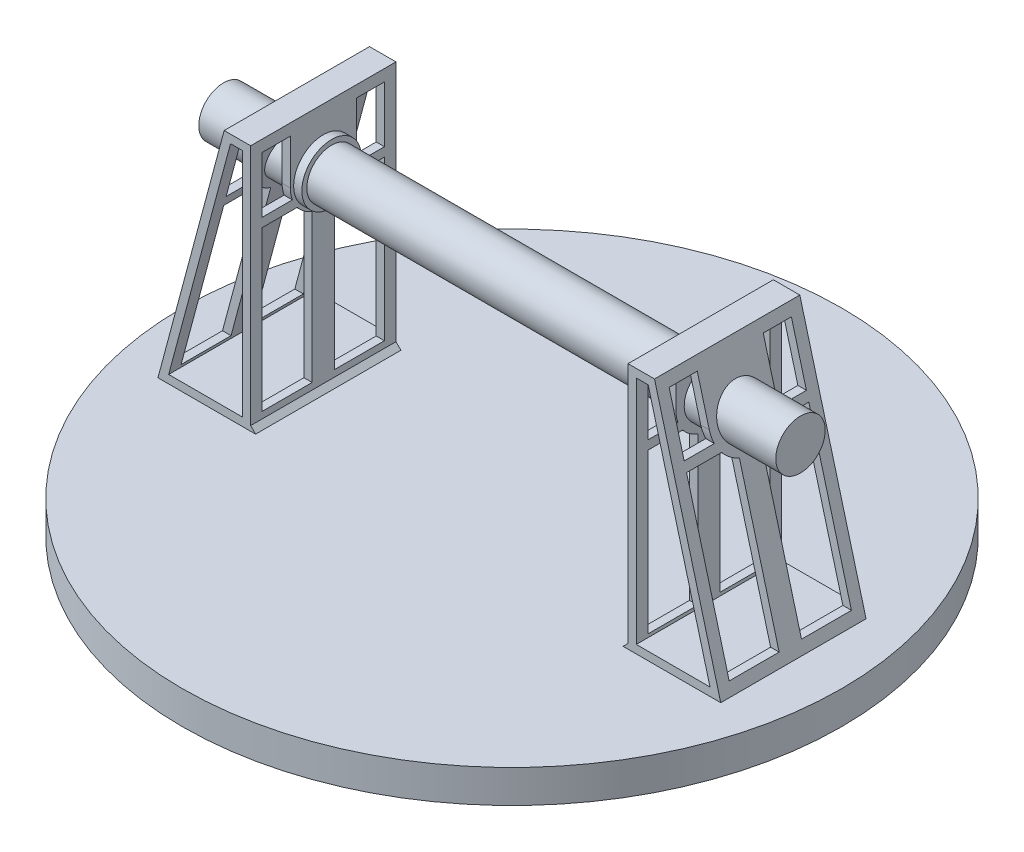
ISO-10303-21;
HEADER;
FILE_DESCRIPTION(('STEP AP214'),'2;1');
FILE_NAME('part.step','',(''),(''),'','','');
FILE_SCHEMA(('AUTOMOTIVE_DESIGN { 1 0 10303 214 1 1 1 1 }'));
ENDSEC;
DATA;
#1=APPLICATION_CONTEXT('core data for automotive mechanical design processes');
#2=APPLICATION_PROTOCOL_DEFINITION('international standard','automotive_design',2000,#1);
#3=PRODUCT_CONTEXT('',#1,'mechanical');
#4=PRODUCT('Part','Part','',(#3));
#5=PRODUCT_RELATED_PRODUCT_CATEGORY('part','',(#4));
#6=PRODUCT_DEFINITION_FORMATION('','',#4);
#7=PRODUCT_DEFINITION_CONTEXT('part definition',#1,'design');
#8=PRODUCT_DEFINITION('design','',#6,#7);
#9=PRODUCT_DEFINITION_SHAPE('','',#8);
#10=(LENGTH_UNIT() NAMED_UNIT(*) SI_UNIT(.MILLI.,.METRE.));
#11=(NAMED_UNIT(*) PLANE_ANGLE_UNIT() SI_UNIT($,.RADIAN.));
#12=(NAMED_UNIT(*) SI_UNIT($,.STERADIAN.) SOLID_ANGLE_UNIT());
#13=UNCERTAINTY_MEASURE_WITH_UNIT(LENGTH_MEASURE(1.E-05),#10,'distance_accuracy_value','');
#14=(GEOMETRIC_REPRESENTATION_CONTEXT(3) GLOBAL_UNCERTAINTY_ASSIGNED_CONTEXT((#13)) GLOBAL_UNIT_ASSIGNED_CONTEXT((#10,
#11,#12)) REPRESENTATION_CONTEXT('',''));
#15=CARTESIAN_POINT('',(0.,0.,0.));
#16=DIRECTION('',(0.,0.,1.));
#17=DIRECTION('',(1.,0.,0.));
#18=AXIS2_PLACEMENT_3D('',#15,#16,#17);
#19=CARTESIAN_POINT('',(0.,33.,0.));
#20=DIRECTION('',(0.,1.,0.));
#21=DIRECTION('',(0.,0.,1.));
#22=AXIS2_PLACEMENT_3D('',#19,#20,#21);
#23=PLANE('',#22);
#24=CARTESIAN_POINT('',(0.,33.,0.));
#25=DIRECTION('',(0.,1.,0.));
#26=DIRECTION('',(0.,0.,1.));
#27=AXIS2_PLACEMENT_3D('',#24,#25,#26);
#28=CIRCLE('',#27,200.);
#29=CARTESIAN_POINT('',(0.,33.,200.));
#30=VERTEX_POINT('',#29);
#31=EDGE_CURVE('E1333',#30,#30,#28,.T.);
#32=ORIENTED_EDGE('',*,*,#31,.T.);
#33=EDGE_LOOP('',(#32));
#34=FACE_BOUND('',#33,.T.);
#35=DIRECTION('',(-1.,0.,0.));
#36=VECTOR('',#35,1.);
#37=CARTESIAN_POINT('',(-114.462322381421,33.,-44.0755026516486));
#38=LINE('',#37,#36);
#39=CARTESIAN_POINT('',(-111.462322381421,33.,-44.0755026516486));
#40=VERTEX_POINT('',#39);
#41=CARTESIAN_POINT('',(-170.702676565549,33.,-44.0755026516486));
#42=VERTEX_POINT('',#41);
#43=EDGE_CURVE('E88',#40,#42,#38,.T.);
#44=ORIENTED_EDGE('',*,*,#43,.F.);
#45=DIRECTION('',(0.,0.,1.));
#46=VECTOR('',#45,1.);
#47=CARTESIAN_POINT('',(-111.462322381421,33.,0.));
#48=LINE('',#47,#46);
#49=CARTESIAN_POINT('',(-111.462322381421,33.,44.0755026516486));
#50=VERTEX_POINT('',#49);
#51=EDGE_CURVE('E1436',#40,#50,#48,.T.);
#52=ORIENTED_EDGE('',*,*,#51,.T.);
#53=DIRECTION('',(1.,0.,0.));
#54=VECTOR('',#53,1.);
#55=CARTESIAN_POINT('',(-114.462322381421,33.,44.0755026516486));
#56=LINE('',#55,#54);
#57=CARTESIAN_POINT('',(-170.702676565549,33.,44.0755026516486));
#58=VERTEX_POINT('',#57);
#59=EDGE_CURVE('E95',#58,#50,#56,.T.);
#60=ORIENTED_EDGE('',*,*,#59,.F.);
#61=DIRECTION('',(0.,0.,1.));
#62=VECTOR('',#61,1.);
#63=CARTESIAN_POINT('',(-170.702676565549,33.,44.0755026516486));
#64=LINE('',#63,#62);
#65=EDGE_CURVE('E1307',#42,#58,#64,.T.);
#66=ORIENTED_EDGE('',*,*,#65,.F.);
#67=EDGE_LOOP('',(#44,#52,#60,#66));
#68=FACE_BOUND('',#67,.T.);
#69=DIRECTION('',(0.,0.,-1.));
#70=VECTOR('',#69,1.);
#71=CARTESIAN_POINT('',(111.462322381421,33.,0.));
#72=LINE('',#71,#70);
#73=CARTESIAN_POINT('',(111.462322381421,33.,44.0755026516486));
#74=VERTEX_POINT('',#73);
#75=CARTESIAN_POINT('',(111.462322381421,33.,-44.0755026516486));
#76=VERTEX_POINT('',#75);
#77=EDGE_CURVE('E1423',#74,#76,#72,.T.);
#78=ORIENTED_EDGE('',*,*,#77,.T.);
#79=DIRECTION('',(1.,0.,0.));
#80=VECTOR('',#79,1.);
#81=CARTESIAN_POINT('',(114.462322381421,33.,-44.0755026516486));
#82=LINE('',#81,#80);
#83=CARTESIAN_POINT('',(170.702676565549,33.,-44.0755026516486));
#84=VERTEX_POINT('',#83);
#85=EDGE_CURVE('E976',#76,#84,#82,.T.);
#86=ORIENTED_EDGE('',*,*,#85,.T.);
#87=DIRECTION('',(0.,0.,1.));
#88=VECTOR('',#87,1.);
#89=CARTESIAN_POINT('',(170.702676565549,33.,44.0755026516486));
#90=LINE('',#89,#88);
#91=CARTESIAN_POINT('',(170.702676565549,33.,44.0755026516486));
#92=VERTEX_POINT('',#91);
#93=EDGE_CURVE('E954',#84,#92,#90,.T.);
#94=ORIENTED_EDGE('',*,*,#93,.T.);
#95=DIRECTION('',(-1.,0.,0.));
#96=VECTOR('',#95,1.);
#97=CARTESIAN_POINT('',(114.462322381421,33.,44.0755026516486));
#98=LINE('',#97,#96);
#99=EDGE_CURVE('E974',#92,#74,#98,.T.);
#100=ORIENTED_EDGE('',*,*,#99,.T.);
#101=EDGE_LOOP('',(#78,#86,#94,#100));
#102=FACE_BOUND('',#101,.T.);
#103=ADVANCED_FACE('F73',(#34,#68,#102),#23,.T.);
#104=CARTESIAN_POINT('',(-170.702676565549,33.,44.0755026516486));
#105=DIRECTION('',(-0.965925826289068,0.258819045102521,0.));
#106=DIRECTION('',(-0.258819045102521,-0.965925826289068,0.));
#107=AXIS2_PLACEMENT_3D('',#104,#105,#106);
#108=PLANE('',#107);
#109=CARTESIAN_POINT('',(-139.684473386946,148.76151022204,0.));
#110=DIRECTION('',(-0.965925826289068,0.258819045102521,0.));
#111=DIRECTION('',(0.258819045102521,0.965925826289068,0.));
#112=AXIS2_PLACEMENT_3D('',#109,#110,#111);
#113=ELLIPSE('',#112,20.7055236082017,20.);
#114=CARTESIAN_POINT('',(-139.684473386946,148.76151022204,20.));
#115=VERTEX_POINT('',#114);
#116=CARTESIAN_POINT('',(-141.516472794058,141.924395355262,18.7950488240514));
#117=VERTEX_POINT('',#116);
#118=EDGE_CURVE('E1208',#115,#117,#113,.F.);
#119=ORIENTED_EDGE('',*,*,#118,.F.);
#120=DIRECTION('',(-0.258819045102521,-0.965925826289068,0.));
#121=VECTOR('',#120,1.);
#122=CARTESIAN_POINT('',(-170.702676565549,33.,20.));
#123=LINE('',#122,#121);
#124=CARTESIAN_POINT('',(-132.385942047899,176.,20.));
#125=VERTEX_POINT('',#124);
#126=EDGE_CURVE('E1184',#115,#125,#123,.F.);
#127=ORIENTED_EDGE('',*,*,#126,.T.);
#128=DIRECTION('',(0.,0.,-1.));
#129=VECTOR('',#128,1.);
#130=CARTESIAN_POINT('',(-132.385942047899,176.,44.0755026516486));
#131=LINE('',#130,#129);
#132=CARTESIAN_POINT('',(-132.385942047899,176.,37.0755026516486));
#133=VERTEX_POINT('',#132);
#134=EDGE_CURVE('E1190',#125,#133,#131,.F.);
#135=ORIENTED_EDGE('',*,*,#134,.T.);
#136=DIRECTION('',(0.258819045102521,0.965925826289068,0.));
#137=VECTOR('',#136,1.);
#138=CARTESIAN_POINT('',(-170.702676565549,33.,37.0755026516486));
#139=LINE('',#138,#137);
#140=CARTESIAN_POINT('',(-141.516472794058,141.924395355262,37.0755026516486));
#141=VERTEX_POINT('',#140);
#142=EDGE_CURVE('E1196',#133,#141,#139,.F.);
#143=ORIENTED_EDGE('',*,*,#142,.T.);
#144=DIRECTION('',(0.,0.,1.));
#145=VECTOR('',#144,1.);
#146=CARTESIAN_POINT('',(-141.516472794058,141.924395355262,44.0755026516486));
#147=LINE('',#146,#145);
#148=EDGE_CURVE('E1202',#141,#117,#147,.F.);
#149=ORIENTED_EDGE('',*,*,#148,.T.);
#150=EDGE_LOOP('',(#119,#127,#135,#143,#149));
#151=FACE_BOUND('',#150,.T.);
#152=CARTESIAN_POINT('',(-139.684473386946,148.76151022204,0.));
#153=DIRECTION('',(-0.965925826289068,0.258819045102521,0.));
#154=DIRECTION('',(0.258819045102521,0.965925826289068,0.));
#155=AXIS2_PLACEMENT_3D('',#152,#153,#154);
#156=ELLIPSE('',#155,20.7055236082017,20.);
#157=CARTESIAN_POINT('',(-142.968604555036,136.50496584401,15.8043386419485));
#158=VERTEX_POINT('',#157);
#159=CARTESIAN_POINT('',(-144.725727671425,129.94729309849,6.78419000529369));
#160=VERTEX_POINT('',#159);
#161=EDGE_CURVE('E1291',#158,#160,#156,.F.);
#162=ORIENTED_EDGE('',*,*,#161,.F.);
#163=DIRECTION('',(0.,0.,1.));
#164=VECTOR('',#163,1.);
#165=CARTESIAN_POINT('',(-142.968604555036,136.50496584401,44.0755026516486));
#166=LINE('',#165,#164);
#167=CARTESIAN_POINT('',(-142.968604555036,136.50496584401,37.0755026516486));
#168=VERTEX_POINT('',#167);
#169=EDGE_CURVE('E1270',#168,#158,#166,.F.);
#170=ORIENTED_EDGE('',*,*,#169,.F.);
#171=DIRECTION('',(0.258819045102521,0.965925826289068,0.));
#172=VECTOR('',#171,1.);
#173=CARTESIAN_POINT('',(-170.702676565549,33.,37.0755026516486));
#174=LINE('',#173,#172);
#175=CARTESIAN_POINT('',(-168.827032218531,40.,37.0755026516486));
#176=VERTEX_POINT('',#175);
#177=EDGE_CURVE('E1275',#168,#176,#174,.F.);
#178=ORIENTED_EDGE('',*,*,#177,.T.);
#179=DIRECTION('',(0.,0.,1.));
#180=VECTOR('',#179,1.);
#181=CARTESIAN_POINT('',(-168.827032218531,40.,44.0755026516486));
#182=LINE('',#181,#180);
#183=CARTESIAN_POINT('',(-168.827032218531,40.,6.78419000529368));
#184=VERTEX_POINT('',#183);
#185=EDGE_CURVE('E1281',#176,#184,#182,.F.);
#186=ORIENTED_EDGE('',*,*,#185,.T.);
#187=DIRECTION('',(0.258819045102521,0.965925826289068,0.));
#188=VECTOR('',#187,1.);
#189=CARTESIAN_POINT('',(-170.702676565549,33.,6.78419000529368));
#190=LINE('',#189,#188);
#191=EDGE_CURVE('E1286',#160,#184,#190,.F.);
#192=ORIENTED_EDGE('',*,*,#191,.F.);
#193=EDGE_LOOP('',(#162,#170,#178,#186,#192));
#194=FACE_BOUND('',#193,.T.);
#195=ORIENTED_EDGE('',*,*,#65,.T.);
#196=DIRECTION('',(0.258819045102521,0.965925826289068,0.));
#197=VECTOR('',#196,1.);
#198=CARTESIAN_POINT('',(-129.43528719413,187.011993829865,44.0755026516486));
#199=LINE('',#198,#197);
#200=CARTESIAN_POINT('',(-130.510297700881,183.,44.0755026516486));
#201=VERTEX_POINT('',#200);
#202=EDGE_CURVE('E1332',#201,#58,#199,.F.);
#203=ORIENTED_EDGE('',*,*,#202,.F.);
#204=DIRECTION('',(0.,0.,-1.));
#205=VECTOR('',#204,1.);
#206=CARTESIAN_POINT('',(-130.510297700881,183.,44.0755026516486));
#207=LINE('',#206,#205);
#208=CARTESIAN_POINT('',(-130.510297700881,183.,-44.0755026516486));
#209=VERTEX_POINT('',#208);
#210=EDGE_CURVE('E1317',#209,#201,#207,.F.);
#211=ORIENTED_EDGE('',*,*,#210,.F.);
#212=DIRECTION('',(0.258819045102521,0.965925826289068,0.));
#213=VECTOR('',#212,1.);
#214=CARTESIAN_POINT('',(-170.702676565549,33.,-44.0755026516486));
#215=LINE('',#214,#213);
#216=EDGE_CURVE('E1321',#209,#42,#215,.F.);
#217=ORIENTED_EDGE('',*,*,#216,.T.);
#218=EDGE_LOOP('',(#195,#203,#211,#217));
#219=FACE_BOUND('',#218,.T.);
#220=CARTESIAN_POINT('',(-139.684473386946,148.76151022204,0.));
#221=DIRECTION('',(-0.965925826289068,0.258819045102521,0.));
#222=DIRECTION('',(-0.258819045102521,-0.965925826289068,0.));
#223=AXIS2_PLACEMENT_3D('',#220,#221,#222);
#224=ELLIPSE('',#223,15.5291427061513,15.);
#225=CARTESIAN_POINT('',(-143.703711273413,133.76151022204,0.));
#226=VERTEX_POINT('',#225);
#227=EDGE_CURVE('E727',#226,#226,#224,.T.);
#228=ORIENTED_EDGE('',*,*,#227,.F.);
#229=EDGE_LOOP('',(#228));
#230=FACE_BOUND('',#229,.T.);
#231=CARTESIAN_POINT('',(-139.684473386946,148.76151022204,0.));
#232=DIRECTION('',(-0.965925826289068,0.258819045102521,0.));
#233=DIRECTION('',(0.258819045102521,0.965925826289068,0.));
#234=AXIS2_PLACEMENT_3D('',#231,#232,#233);
#235=ELLIPSE('',#234,20.7055236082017,20.);
#236=CARTESIAN_POINT('',(-144.725727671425,129.94729309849,-6.78419000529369));
#237=VERTEX_POINT('',#236);
#238=CARTESIAN_POINT('',(-142.968604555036,136.50496584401,-15.8043386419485));
#239=VERTEX_POINT('',#238);
#240=EDGE_CURVE('E1179',#237,#239,#235,.F.);
#241=ORIENTED_EDGE('',*,*,#240,.F.);
#242=DIRECTION('',(0.258819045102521,0.965925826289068,0.));
#243=VECTOR('',#242,1.);
#244=CARTESIAN_POINT('',(-170.702676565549,33.,-6.78419000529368));
#245=LINE('',#244,#243);
#246=CARTESIAN_POINT('',(-168.827032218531,40.,-6.78419000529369));
#247=VERTEX_POINT('',#246);
#248=EDGE_CURVE('E1157',#237,#247,#245,.F.);
#249=ORIENTED_EDGE('',*,*,#248,.T.);
#250=DIRECTION('',(0.,0.,1.));
#251=VECTOR('',#250,1.);
#252=CARTESIAN_POINT('',(-168.827032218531,40.,44.0755026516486));
#253=LINE('',#252,#251);
#254=CARTESIAN_POINT('',(-168.827032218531,40.,-37.0755026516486));
#255=VERTEX_POINT('',#254);
#256=EDGE_CURVE('E1163',#247,#255,#253,.F.);
#257=ORIENTED_EDGE('',*,*,#256,.T.);
#258=DIRECTION('',(-0.258819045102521,-0.965925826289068,0.));
#259=VECTOR('',#258,1.);
#260=CARTESIAN_POINT('',(-170.702676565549,33.,-37.0755026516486));
#261=LINE('',#260,#259);
#262=CARTESIAN_POINT('',(-142.968604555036,136.50496584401,-37.0755026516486));
#263=VERTEX_POINT('',#262);
#264=EDGE_CURVE('E1169',#255,#263,#261,.F.);
#265=ORIENTED_EDGE('',*,*,#264,.T.);
#266=DIRECTION('',(0.,0.,1.));
#267=VECTOR('',#266,1.);
#268=CARTESIAN_POINT('',(-142.968604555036,136.50496584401,44.0755026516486));
#269=LINE('',#268,#267);
#270=EDGE_CURVE('E1174',#239,#263,#269,.F.);
#271=ORIENTED_EDGE('',*,*,#270,.F.);
#272=EDGE_LOOP('',(#241,#249,#257,#265,#271));
#273=FACE_BOUND('',#272,.T.);
#274=CARTESIAN_POINT('',(-139.684473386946,148.76151022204,0.));
#275=DIRECTION('',(-0.965925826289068,0.258819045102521,0.));
#276=DIRECTION('',(0.258819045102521,0.965925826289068,0.));
#277=AXIS2_PLACEMENT_3D('',#274,#275,#276);
#278=ELLIPSE('',#277,20.7055236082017,20.);
#279=CARTESIAN_POINT('',(-141.516472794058,141.924395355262,-18.7950488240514));
#280=VERTEX_POINT('',#279);
#281=CARTESIAN_POINT('',(-139.684473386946,148.76151022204,-20.));
#282=VERTEX_POINT('',#281);
#283=EDGE_CURVE('E1235',#280,#282,#278,.F.);
#284=ORIENTED_EDGE('',*,*,#283,.F.);
#285=DIRECTION('',(0.,0.,1.));
#286=VECTOR('',#285,1.);
#287=CARTESIAN_POINT('',(-141.516472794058,141.924395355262,44.0755026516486));
#288=LINE('',#287,#286);
#289=CARTESIAN_POINT('',(-141.516472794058,141.924395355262,-37.0755026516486));
#290=VERTEX_POINT('',#289);
#291=EDGE_CURVE('E1213',#280,#290,#288,.F.);
#292=ORIENTED_EDGE('',*,*,#291,.T.);
#293=DIRECTION('',(-0.258819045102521,-0.965925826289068,0.));
#294=VECTOR('',#293,1.);
#295=CARTESIAN_POINT('',(-170.702676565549,33.,-37.0755026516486));
#296=LINE('',#295,#294);
#297=CARTESIAN_POINT('',(-132.385942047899,176.,-37.0755026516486));
#298=VERTEX_POINT('',#297);
#299=EDGE_CURVE('E1219',#290,#298,#296,.F.);
#300=ORIENTED_EDGE('',*,*,#299,.T.);
#301=DIRECTION('',(0.,0.,-1.));
#302=VECTOR('',#301,1.);
#303=CARTESIAN_POINT('',(-132.385942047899,176.,44.0755026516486));
#304=LINE('',#303,#302);
#305=CARTESIAN_POINT('',(-132.385942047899,176.,-20.));
#306=VERTEX_POINT('',#305);
#307=EDGE_CURVE('E1225',#298,#306,#304,.F.);
#308=ORIENTED_EDGE('',*,*,#307,.T.);
#309=DIRECTION('',(-0.258819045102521,-0.965925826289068,0.));
#310=VECTOR('',#309,1.);
#311=CARTESIAN_POINT('',(-170.702676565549,33.,-20.));
#312=LINE('',#311,#310);
#313=EDGE_CURVE('E1230',#282,#306,#312,.F.);
#314=ORIENTED_EDGE('',*,*,#313,.F.);
#315=EDGE_LOOP('',(#284,#292,#300,#308,#314));
#316=FACE_BOUND('',#315,.T.);
#317=ADVANCED_FACE('F1449',(#151,#194,#219,#230,#273,#316),#108,.T.);
#318=CARTESIAN_POINT('',(-114.462322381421,183.,44.0755026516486));
#319=DIRECTION('',(-1.,0.,0.));
#320=DIRECTION('',(0.,0.,1.));
#321=AXIS2_PLACEMENT_3D('',#318,#319,#320);
#322=PLANE('',#321);
#323=CARTESIAN_POINT('',(-114.462322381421,148.76151022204,0.));
#324=DIRECTION('',(-1.,0.,0.));
#325=DIRECTION('',(0.,0.,1.));
#326=AXIS2_PLACEMENT_3D('',#323,#324,#325);
#327=CIRCLE('',#326,18.);
#328=CARTESIAN_POINT('',(-114.462322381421,148.76151022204,18.));
#329=VERTEX_POINT('',#328);
#330=EDGE_CURVE('E1684',#329,#329,#327,.T.);
#331=ORIENTED_EDGE('',*,*,#330,.T.);
#332=EDGE_LOOP('',(#331));
#333=FACE_BOUND('',#332,.T.);
#334=CARTESIAN_POINT('',(-114.462322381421,148.76151022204,0.));
#335=DIRECTION('',(1.,0.,0.));
#336=DIRECTION('',(0.,0.,-1.));
#337=AXIS2_PLACEMENT_3D('',#334,#335,#336);
#338=CIRCLE('',#337,20.);
#339=CARTESIAN_POINT('',(-114.462322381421,148.76151022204,20.));
#340=VERTEX_POINT('',#339);
#341=CARTESIAN_POINT('',(-114.462322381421,141.924395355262,18.7950488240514));
#342=VERTEX_POINT('',#341);
#343=EDGE_CURVE('E1062',#340,#342,#338,.T.);
#344=ORIENTED_EDGE('',*,*,#343,.T.);
#345=DIRECTION('',(0.,0.,-1.));
#346=VECTOR('',#345,1.);
#347=CARTESIAN_POINT('',(-114.462322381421,141.924395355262,0.));
#348=LINE('',#347,#346);
#349=CARTESIAN_POINT('',(-114.462322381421,141.924395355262,37.0755026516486));
#350=VERTEX_POINT('',#349);
#351=EDGE_CURVE('E1075',#350,#342,#348,.T.);
#352=ORIENTED_EDGE('',*,*,#351,.F.);
#353=DIRECTION('',(0.,-1.,0.));
#354=VECTOR('',#353,1.);
#355=CARTESIAN_POINT('',(-114.462322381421,0.,37.0755026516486));
#356=LINE('',#355,#354);
#357=CARTESIAN_POINT('',(-114.462322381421,176.,37.0755026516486));
#358=VERTEX_POINT('',#357);
#359=EDGE_CURVE('E1072',#358,#350,#356,.T.);
#360=ORIENTED_EDGE('',*,*,#359,.F.);
#361=DIRECTION('',(0.,0.,1.));
#362=VECTOR('',#361,1.);
#363=CARTESIAN_POINT('',(-114.462322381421,176.,0.));
#364=LINE('',#363,#362);
#365=CARTESIAN_POINT('',(-114.462322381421,176.,20.));
#366=VERTEX_POINT('',#365);
#367=EDGE_CURVE('E1069',#366,#358,#364,.T.);
#368=ORIENTED_EDGE('',*,*,#367,.F.);
#369=DIRECTION('',(0.,1.,0.));
#370=VECTOR('',#369,1.);
#371=CARTESIAN_POINT('',(-114.462322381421,0.,20.));
#372=LINE('',#371,#370);
#373=EDGE_CURVE('E1065',#340,#366,#372,.T.);
#374=ORIENTED_EDGE('',*,*,#373,.F.);
#375=EDGE_LOOP('',(#344,#352,#360,#368,#374));
#376=FACE_BOUND('',#375,.T.);
#377=CARTESIAN_POINT('',(-114.462322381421,148.76151022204,0.));
#378=DIRECTION('',(1.,0.,0.));
#379=DIRECTION('',(0.,0.,-1.));
#380=AXIS2_PLACEMENT_3D('',#377,#378,#379);
#381=CIRCLE('',#380,20.);
#382=CARTESIAN_POINT('',(-114.462322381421,136.50496584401,15.8043386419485));
#383=VERTEX_POINT('',#382);
#384=CARTESIAN_POINT('',(-114.462322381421,129.94729309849,6.78419000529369));
#385=VERTEX_POINT('',#384);
#386=EDGE_CURVE('E1237',#383,#385,#381,.T.);
#387=ORIENTED_EDGE('',*,*,#386,.T.);
#388=DIRECTION('',(0.,-1.,0.));
#389=VECTOR('',#388,1.);
#390=CARTESIAN_POINT('',(-114.462322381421,0.,6.78419000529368));
#391=LINE('',#390,#389);
#392=CARTESIAN_POINT('',(-114.462322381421,40.,6.78419000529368));
#393=VERTEX_POINT('',#392);
#394=EDGE_CURVE('E1249',#385,#393,#391,.T.);
#395=ORIENTED_EDGE('',*,*,#394,.T.);
#396=DIRECTION('',(0.,0.,-1.));
#397=VECTOR('',#396,1.);
#398=CARTESIAN_POINT('',(-114.462322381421,40.,0.));
#399=LINE('',#398,#397);
#400=CARTESIAN_POINT('',(-114.462322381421,40.,37.0755026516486));
#401=VERTEX_POINT('',#400);
#402=EDGE_CURVE('E1246',#401,#393,#399,.T.);
#403=ORIENTED_EDGE('',*,*,#402,.F.);
#404=DIRECTION('',(0.,-1.,0.));
#405=VECTOR('',#404,1.);
#406=CARTESIAN_POINT('',(-114.462322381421,0.,37.0755026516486));
#407=LINE('',#406,#405);
#408=CARTESIAN_POINT('',(-114.462322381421,136.50496584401,37.0755026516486));
#409=VERTEX_POINT('',#408);
#410=EDGE_CURVE('E1243',#409,#401,#407,.T.);
#411=ORIENTED_EDGE('',*,*,#410,.F.);
#412=DIRECTION('',(0.,0.,-1.));
#413=VECTOR('',#412,1.);
#414=CARTESIAN_POINT('',(-114.462322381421,136.50496584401,0.));
#415=LINE('',#414,#413);
#416=EDGE_CURVE('E1240',#409,#383,#415,.T.);
#417=ORIENTED_EDGE('',*,*,#416,.T.);
#418=EDGE_LOOP('',(#387,#395,#403,#411,#417));
#419=FACE_BOUND('',#418,.T.);
#420=DIRECTION('',(0.,-1.,0.));
#421=VECTOR('',#420,1.);
#422=CARTESIAN_POINT('',(-114.462322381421,183.,44.0755026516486));
#423=LINE('',#422,#421);
#424=CARTESIAN_POINT('',(-114.462322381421,183.,44.0755026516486));
#425=VERTEX_POINT('',#424);
#426=CARTESIAN_POINT('',(-114.462322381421,36.0000000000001,44.0755026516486));
#427=VERTEX_POINT('',#426);
#428=EDGE_CURVE('E1329',#425,#427,#423,.T.);
#429=ORIENTED_EDGE('',*,*,#428,.T.);
#430=DIRECTION('',(0.,0.,-1.));
#431=VECTOR('',#430,1.);
#432=CARTESIAN_POINT('',(-114.462322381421,36.0000000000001,44.0755026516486));
#433=LINE('',#432,#431);
#434=CARTESIAN_POINT('',(-114.462322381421,36.0000000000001,-44.0755026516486));
#435=VERTEX_POINT('',#434);
#436=EDGE_CURVE('E1433',#427,#435,#433,.T.);
#437=ORIENTED_EDGE('',*,*,#436,.T.);
#438=DIRECTION('',(0.,-1.,0.));
#439=VECTOR('',#438,1.);
#440=CARTESIAN_POINT('',(-114.462322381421,183.,-44.0755026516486));
#441=LINE('',#440,#439);
#442=CARTESIAN_POINT('',(-114.462322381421,183.,-44.0755026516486));
#443=VERTEX_POINT('',#442);
#444=EDGE_CURVE('E1326',#443,#435,#441,.T.);
#445=ORIENTED_EDGE('',*,*,#444,.F.);
#446=DIRECTION('',(0.,0.,-1.));
#447=VECTOR('',#446,1.);
#448=CARTESIAN_POINT('',(-114.462322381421,183.,44.0755026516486));
#449=LINE('',#448,#447);
#450=EDGE_CURVE('E1316',#425,#443,#449,.T.);
#451=ORIENTED_EDGE('',*,*,#450,.F.);
#452=EDGE_LOOP('',(#429,#437,#445,#451));
#453=FACE_BOUND('',#452,.T.);
#454=CARTESIAN_POINT('',(-114.462322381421,148.76151022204,0.));
#455=DIRECTION('',(1.,0.,0.));
#456=DIRECTION('',(0.,0.,-1.));
#457=AXIS2_PLACEMENT_3D('',#454,#455,#456);
#458=CIRCLE('',#457,20.);
#459=CARTESIAN_POINT('',(-114.462322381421,129.94729309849,-6.78419000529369));
#460=VERTEX_POINT('',#459);
#461=CARTESIAN_POINT('',(-114.462322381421,136.50496584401,-15.8043386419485));
#462=VERTEX_POINT('',#461);
#463=EDGE_CURVE('E1123',#460,#462,#458,.T.);
#464=ORIENTED_EDGE('',*,*,#463,.T.);
#465=DIRECTION('',(0.,0.,-1.));
#466=VECTOR('',#465,1.);
#467=CARTESIAN_POINT('',(-114.462322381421,136.50496584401,0.));
#468=LINE('',#467,#466);
#469=CARTESIAN_POINT('',(-114.462322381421,136.50496584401,-37.0755026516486));
#470=VERTEX_POINT('',#469);
#471=EDGE_CURVE('E1135',#462,#470,#468,.T.);
#472=ORIENTED_EDGE('',*,*,#471,.T.);
#473=DIRECTION('',(0.,1.,0.));
#474=VECTOR('',#473,1.);
#475=CARTESIAN_POINT('',(-114.462322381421,0.,-37.0755026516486));
#476=LINE('',#475,#474);
#477=CARTESIAN_POINT('',(-114.462322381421,40.,-37.0755026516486));
#478=VERTEX_POINT('',#477);
#479=EDGE_CURVE('E1132',#478,#470,#476,.T.);
#480=ORIENTED_EDGE('',*,*,#479,.F.);
#481=DIRECTION('',(0.,0.,-1.));
#482=VECTOR('',#481,1.);
#483=CARTESIAN_POINT('',(-114.462322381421,40.,0.));
#484=LINE('',#483,#482);
#485=CARTESIAN_POINT('',(-114.462322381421,40.,-6.78419000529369));
#486=VERTEX_POINT('',#485);
#487=EDGE_CURVE('E1129',#486,#478,#484,.T.);
#488=ORIENTED_EDGE('',*,*,#487,.F.);
#489=DIRECTION('',(0.,-1.,0.));
#490=VECTOR('',#489,1.);
#491=CARTESIAN_POINT('',(-114.462322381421,0.,-6.78419000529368));
#492=LINE('',#491,#490);
#493=EDGE_CURVE('E1126',#460,#486,#492,.T.);
#494=ORIENTED_EDGE('',*,*,#493,.F.);
#495=EDGE_LOOP('',(#464,#472,#480,#488,#494));
#496=FACE_BOUND('',#495,.T.);
#497=CARTESIAN_POINT('',(-114.462322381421,148.76151022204,0.));
#498=DIRECTION('',(1.,0.,0.));
#499=DIRECTION('',(0.,0.,-1.));
#500=AXIS2_PLACEMENT_3D('',#497,#498,#499);
#501=CIRCLE('',#500,20.);
#502=CARTESIAN_POINT('',(-114.462322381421,141.924395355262,-18.7950488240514));
#503=VERTEX_POINT('',#502);
#504=CARTESIAN_POINT('',(-114.462322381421,148.76151022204,-20.));
#505=VERTEX_POINT('',#504);
#506=EDGE_CURVE('E1061',#503,#505,#501,.T.);
#507=ORIENTED_EDGE('',*,*,#506,.T.);
#508=DIRECTION('',(0.,1.,0.));
#509=VECTOR('',#508,1.);
#510=CARTESIAN_POINT('',(-114.462322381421,0.,-20.));
#511=LINE('',#510,#509);
#512=CARTESIAN_POINT('',(-114.462322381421,176.,-20.));
#513=VERTEX_POINT('',#512);
#514=EDGE_CURVE('E1105',#505,#513,#511,.T.);
#515=ORIENTED_EDGE('',*,*,#514,.T.);
#516=DIRECTION('',(0.,0.,1.));
#517=VECTOR('',#516,1.);
#518=CARTESIAN_POINT('',(-114.462322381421,176.,0.));
#519=LINE('',#518,#517);
#520=CARTESIAN_POINT('',(-114.462322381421,176.,-37.0755026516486));
#521=VERTEX_POINT('',#520);
#522=EDGE_CURVE('E1102',#521,#513,#519,.T.);
#523=ORIENTED_EDGE('',*,*,#522,.F.);
#524=DIRECTION('',(0.,1.,0.));
#525=VECTOR('',#524,1.);
#526=CARTESIAN_POINT('',(-114.462322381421,0.,-37.0755026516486));
#527=LINE('',#526,#525);
#528=CARTESIAN_POINT('',(-114.462322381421,141.924395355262,-37.0755026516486));
#529=VERTEX_POINT('',#528);
#530=EDGE_CURVE('E1099',#529,#521,#527,.T.);
#531=ORIENTED_EDGE('',*,*,#530,.F.);
#532=DIRECTION('',(0.,0.,-1.));
#533=VECTOR('',#532,1.);
#534=CARTESIAN_POINT('',(-114.462322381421,141.924395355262,0.));
#535=LINE('',#534,#533);
#536=EDGE_CURVE('E1096',#503,#529,#535,.T.);
#537=ORIENTED_EDGE('',*,*,#536,.F.);
#538=EDGE_LOOP('',(#507,#515,#523,#531,#537));
#539=FACE_BOUND('',#538,.T.);
#540=ADVANCED_FACE('F1457',(#333,#376,#419,#453,#496,#539),#322,.F.);
#541=CARTESIAN_POINT('',(-126.673662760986,178.,-200.));
#542=DIRECTION('',(-0.965925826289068,0.258819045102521,0.));
#543=DIRECTION('',(-0.258819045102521,-0.965925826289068,0.));
#544=AXIS2_PLACEMENT_3D('',#541,#542,#543);
#545=PLANE('',#544);
#546=CARTESIAN_POINT('',(-134.508092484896,148.76151022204,0.));
#547=DIRECTION('',(-0.965925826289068,0.258819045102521,0.));
#548=DIRECTION('',(0.258819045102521,0.965925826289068,0.));
#549=AXIS2_PLACEMENT_3D('',#546,#547,#548);
#550=ELLIPSE('',#549,20.7055236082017,20.);
#551=CARTESIAN_POINT('',(-136.340091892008,141.924395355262,18.7950488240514));
#552=VERTEX_POINT('',#551);
#553=CARTESIAN_POINT('',(-134.508092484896,148.76151022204,20.));
#554=VERTEX_POINT('',#553);
#555=EDGE_CURVE('E1205',#552,#554,#550,.T.);
#556=ORIENTED_EDGE('',*,*,#555,.F.);
#557=DIRECTION('',(0.,0.,1.));
#558=VECTOR('',#557,1.);
#559=CARTESIAN_POINT('',(-136.340091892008,141.924395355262,-200.));
#560=LINE('',#559,#558);
#561=CARTESIAN_POINT('',(-136.340091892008,141.924395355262,37.0755026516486));
#562=VERTEX_POINT('',#561);
#563=EDGE_CURVE('E1199',#552,#562,#560,.T.);
#564=ORIENTED_EDGE('',*,*,#563,.T.);
#565=DIRECTION('',(0.258819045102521,0.965925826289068,0.));
#566=VECTOR('',#565,1.);
#567=CARTESIAN_POINT('',(-126.673662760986,178.,37.0755026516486));
#568=LINE('',#567,#566);
#569=CARTESIAN_POINT('',(-127.209561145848,176.,37.0755026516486));
#570=VERTEX_POINT('',#569);
#571=EDGE_CURVE('E1193',#562,#570,#568,.T.);
#572=ORIENTED_EDGE('',*,*,#571,.T.);
#573=DIRECTION('',(0.,0.,-1.));
#574=VECTOR('',#573,1.);
#575=CARTESIAN_POINT('',(-127.209561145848,176.,-200.));
#576=LINE('',#575,#574);
#577=CARTESIAN_POINT('',(-127.209561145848,176.,20.));
#578=VERTEX_POINT('',#577);
#579=EDGE_CURVE('E1187',#570,#578,#576,.T.);
#580=ORIENTED_EDGE('',*,*,#579,.T.);
#581=DIRECTION('',(-0.258819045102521,-0.965925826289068,0.));
#582=VECTOR('',#581,1.);
#583=CARTESIAN_POINT('',(-126.673662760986,178.,20.));
#584=LINE('',#583,#582);
#585=EDGE_CURVE('E1181',#578,#554,#584,.T.);
#586=ORIENTED_EDGE('',*,*,#585,.T.);
#587=EDGE_LOOP('',(#556,#564,#572,#580,#586));
#588=FACE_BOUND('',#587,.T.);
#589=CARTESIAN_POINT('',(-134.508092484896,148.76151022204,0.));
#590=DIRECTION('',(-0.965925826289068,0.258819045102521,0.));
#591=DIRECTION('',(0.258819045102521,0.965925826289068,0.));
#592=AXIS2_PLACEMENT_3D('',#589,#590,#591);
#593=ELLIPSE('',#592,20.7055236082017,20.);
#594=CARTESIAN_POINT('',(-139.549346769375,129.94729309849,6.7841900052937));
#595=VERTEX_POINT('',#594);
#596=CARTESIAN_POINT('',(-137.792223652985,136.50496584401,15.8043386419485));
#597=VERTEX_POINT('',#596);
#598=EDGE_CURVE('E1288',#595,#597,#593,.T.);
#599=ORIENTED_EDGE('',*,*,#598,.F.);
#600=DIRECTION('',(0.258819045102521,0.965925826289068,0.));
#601=VECTOR('',#600,1.);
#602=CARTESIAN_POINT('',(-126.673662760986,178.,6.78419000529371));
#603=LINE('',#602,#601);
#604=CARTESIAN_POINT('',(-163.650651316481,40.,6.78419000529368));
#605=VERTEX_POINT('',#604);
#606=EDGE_CURVE('E1284',#605,#595,#603,.T.);
#607=ORIENTED_EDGE('',*,*,#606,.F.);
#608=DIRECTION('',(0.,0.,1.));
#609=VECTOR('',#608,1.);
#610=CARTESIAN_POINT('',(-163.650651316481,40.,-200.));
#611=LINE('',#610,#609);
#612=CARTESIAN_POINT('',(-163.650651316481,40.,37.0755026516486));
#613=VERTEX_POINT('',#612);
#614=EDGE_CURVE('E1278',#605,#613,#611,.T.);
#615=ORIENTED_EDGE('',*,*,#614,.T.);
#616=DIRECTION('',(0.258819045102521,0.965925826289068,0.));
#617=VECTOR('',#616,1.);
#618=CARTESIAN_POINT('',(-126.673662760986,178.,37.0755026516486));
#619=LINE('',#618,#617);
#620=CARTESIAN_POINT('',(-137.792223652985,136.50496584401,37.0755026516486));
#621=VERTEX_POINT('',#620);
#622=EDGE_CURVE('E1272',#613,#621,#619,.T.);
#623=ORIENTED_EDGE('',*,*,#622,.T.);
#624=DIRECTION('',(0.,0.,1.));
#625=VECTOR('',#624,1.);
#626=CARTESIAN_POINT('',(-137.792223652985,136.50496584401,-200.));
#627=LINE('',#626,#625);
#628=EDGE_CURVE('E1268',#597,#621,#627,.T.);
#629=ORIENTED_EDGE('',*,*,#628,.F.);
#630=EDGE_LOOP('',(#599,#607,#615,#623,#629));
#631=FACE_BOUND('',#630,.T.);
#632=DIRECTION('',(0.,0.,1.));
#633=VECTOR('',#632,1.);
#634=CARTESIAN_POINT('',(-126.673662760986,178.,-200.));
#635=LINE('',#634,#633);
#636=CARTESIAN_POINT('',(-126.673662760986,178.,-44.0755026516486));
#637=VERTEX_POINT('',#636);
#638=CARTESIAN_POINT('',(-126.673662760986,178.,44.0755026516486));
#639=VERTEX_POINT('',#638);
#640=EDGE_CURVE('E1305',#637,#639,#635,.T.);
#641=ORIENTED_EDGE('',*,*,#640,.T.);
#642=DIRECTION('',(-0.258819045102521,-0.965925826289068,0.));
#643=VECTOR('',#642,1.);
#644=CARTESIAN_POINT('',(-126.673662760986,178.,44.0755026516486));
#645=LINE('',#644,#643);
#646=CARTESIAN_POINT('',(-164.186549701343,38.,44.0755026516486));
#647=VERTEX_POINT('',#646);
#648=EDGE_CURVE('E1293',#639,#647,#645,.T.);
#649=ORIENTED_EDGE('',*,*,#648,.T.);
#650=DIRECTION('',(0.,0.,1.));
#651=VECTOR('',#650,1.);
#652=CARTESIAN_POINT('',(-164.186549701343,38.,-200.));
#653=LINE('',#652,#651);
#654=CARTESIAN_POINT('',(-164.186549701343,38.,-44.0755026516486));
#655=VERTEX_POINT('',#654);
#656=EDGE_CURVE('E1304',#655,#647,#653,.T.);
#657=ORIENTED_EDGE('',*,*,#656,.F.);
#658=DIRECTION('',(-0.258819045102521,-0.965925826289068,0.));
#659=VECTOR('',#658,1.);
#660=CARTESIAN_POINT('',(-124.605658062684,185.717898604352,-44.0755026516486));
#661=LINE('',#660,#659);
#662=EDGE_CURVE('E1365',#637,#655,#661,.T.);
#663=ORIENTED_EDGE('',*,*,#662,.F.);
#664=EDGE_LOOP('',(#641,#649,#657,#663));
#665=FACE_BOUND('',#664,.T.);
#666=CARTESIAN_POINT('',(-134.508092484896,148.76151022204,0.));
#667=DIRECTION('',(-0.965925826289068,0.258819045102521,0.));
#668=DIRECTION('',(-0.258819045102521,-0.965925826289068,0.));
#669=AXIS2_PLACEMENT_3D('',#666,#667,#668);
#670=ELLIPSE('',#669,15.5291427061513,15.);
#671=CARTESIAN_POINT('',(-138.527330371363,133.76151022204,0.));
#672=VERTEX_POINT('',#671);
#673=EDGE_CURVE('E2877',#672,#672,#670,.F.);
#674=ORIENTED_EDGE('',*,*,#673,.F.);
#675=EDGE_LOOP('',(#674));
#676=FACE_BOUND('',#675,.T.);
#677=CARTESIAN_POINT('',(-134.508092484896,148.76151022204,0.));
#678=DIRECTION('',(-0.965925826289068,0.258819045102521,0.));
#679=DIRECTION('',(0.258819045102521,0.965925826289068,0.));
#680=AXIS2_PLACEMENT_3D('',#677,#678,#679);
#681=ELLIPSE('',#680,20.7055236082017,20.);
#682=CARTESIAN_POINT('',(-137.792223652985,136.50496584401,-15.8043386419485));
#683=VERTEX_POINT('',#682);
#684=CARTESIAN_POINT('',(-139.549346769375,129.94729309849,-6.7841900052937));
#685=VERTEX_POINT('',#684);
#686=EDGE_CURVE('E1176',#683,#685,#681,.T.);
#687=ORIENTED_EDGE('',*,*,#686,.F.);
#688=DIRECTION('',(0.,0.,1.));
#689=VECTOR('',#688,1.);
#690=CARTESIAN_POINT('',(-137.792223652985,136.50496584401,-200.));
#691=LINE('',#690,#689);
#692=CARTESIAN_POINT('',(-137.792223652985,136.50496584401,-37.0755026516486));
#693=VERTEX_POINT('',#692);
#694=EDGE_CURVE('E1172',#693,#683,#691,.T.);
#695=ORIENTED_EDGE('',*,*,#694,.F.);
#696=DIRECTION('',(-0.258819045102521,-0.965925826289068,0.));
#697=VECTOR('',#696,1.);
#698=CARTESIAN_POINT('',(-126.673662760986,178.,-37.0755026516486));
#699=LINE('',#698,#697);
#700=CARTESIAN_POINT('',(-163.650651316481,40.,-37.0755026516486));
#701=VERTEX_POINT('',#700);
#702=EDGE_CURVE('E1166',#693,#701,#699,.T.);
#703=ORIENTED_EDGE('',*,*,#702,.T.);
#704=DIRECTION('',(0.,0.,1.));
#705=VECTOR('',#704,1.);
#706=CARTESIAN_POINT('',(-163.650651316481,40.,-200.));
#707=LINE('',#706,#705);
#708=CARTESIAN_POINT('',(-163.650651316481,40.,-6.78419000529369));
#709=VERTEX_POINT('',#708);
#710=EDGE_CURVE('E1160',#701,#709,#707,.T.);
#711=ORIENTED_EDGE('',*,*,#710,.T.);
#712=DIRECTION('',(0.258819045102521,0.965925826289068,0.));
#713=VECTOR('',#712,1.);
#714=CARTESIAN_POINT('',(-126.673662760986,178.,-6.78419000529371));
#715=LINE('',#714,#713);
#716=EDGE_CURVE('E1154',#709,#685,#715,.T.);
#717=ORIENTED_EDGE('',*,*,#716,.T.);
#718=EDGE_LOOP('',(#687,#695,#703,#711,#717));
#719=FACE_BOUND('',#718,.T.);
#720=CARTESIAN_POINT('',(-134.508092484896,148.76151022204,0.));
#721=DIRECTION('',(-0.965925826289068,0.258819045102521,0.));
#722=DIRECTION('',(0.258819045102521,0.965925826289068,0.));
#723=AXIS2_PLACEMENT_3D('',#720,#721,#722);
#724=ELLIPSE('',#723,20.7055236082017,20.);
#725=CARTESIAN_POINT('',(-134.508092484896,148.76151022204,-20.));
#726=VERTEX_POINT('',#725);
#727=CARTESIAN_POINT('',(-136.340091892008,141.924395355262,-18.7950488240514));
#728=VERTEX_POINT('',#727);
#729=EDGE_CURVE('E1232',#726,#728,#724,.T.);
#730=ORIENTED_EDGE('',*,*,#729,.F.);
#731=DIRECTION('',(-0.258819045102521,-0.965925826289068,0.));
#732=VECTOR('',#731,1.);
#733=CARTESIAN_POINT('',(-126.673662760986,178.,-20.));
#734=LINE('',#733,#732);
#735=CARTESIAN_POINT('',(-127.209561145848,176.,-20.));
#736=VERTEX_POINT('',#735);
#737=EDGE_CURVE('E1228',#736,#726,#734,.T.);
#738=ORIENTED_EDGE('',*,*,#737,.F.);
#739=DIRECTION('',(0.,0.,-1.));
#740=VECTOR('',#739,1.);
#741=CARTESIAN_POINT('',(-127.209561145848,176.,-200.));
#742=LINE('',#741,#740);
#743=CARTESIAN_POINT('',(-127.209561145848,176.,-37.0755026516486));
#744=VERTEX_POINT('',#743);
#745=EDGE_CURVE('E1222',#736,#744,#742,.T.);
#746=ORIENTED_EDGE('',*,*,#745,.T.);
#747=DIRECTION('',(-0.258819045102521,-0.965925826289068,0.));
#748=VECTOR('',#747,1.);
#749=CARTESIAN_POINT('',(-126.673662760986,178.,-37.0755026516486));
#750=LINE('',#749,#748);
#751=CARTESIAN_POINT('',(-136.340091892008,141.924395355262,-37.0755026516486));
#752=VERTEX_POINT('',#751);
#753=EDGE_CURVE('E1216',#744,#752,#750,.T.);
#754=ORIENTED_EDGE('',*,*,#753,.T.);
#755=DIRECTION('',(0.,0.,1.));
#756=VECTOR('',#755,1.);
#757=CARTESIAN_POINT('',(-136.340091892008,141.924395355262,-200.));
#758=LINE('',#757,#756);
#759=EDGE_CURVE('E1210',#752,#728,#758,.T.);
#760=ORIENTED_EDGE('',*,*,#759,.T.);
#761=EDGE_LOOP('',(#730,#738,#746,#754,#760));
#762=FACE_BOUND('',#761,.T.);
#763=ADVANCED_FACE('F1668',(#588,#631,#665,#676,#719,#762),#545,.F.);
#764=CARTESIAN_POINT('',(-119.462322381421,38.,-200.));
#765=DIRECTION('',(1.,0.,0.));
#766=DIRECTION('',(0.,0.,-1.));
#767=AXIS2_PLACEMENT_3D('',#764,#765,#766);
#768=PLANE('',#767);
#769=CARTESIAN_POINT('',(-119.462322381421,148.76151022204,0.));
#770=DIRECTION('',(1.,0.,0.));
#771=DIRECTION('',(0.,0.,-1.));
#772=AXIS2_PLACEMENT_3D('',#769,#770,#771);
#773=CIRCLE('',#772,20.);
#774=CARTESIAN_POINT('',(-119.462322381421,148.76151022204,20.));
#775=VERTEX_POINT('',#774);
#776=CARTESIAN_POINT('',(-119.462322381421,141.924395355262,18.7950488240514));
#777=VERTEX_POINT('',#776);
#778=EDGE_CURVE('E1405',#775,#777,#773,.T.);
#779=ORIENTED_EDGE('',*,*,#778,.F.);
#780=DIRECTION('',(0.,1.,0.));
#781=VECTOR('',#780,1.);
#782=CARTESIAN_POINT('',(-119.462322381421,38.,20.));
#783=LINE('',#782,#781);
#784=CARTESIAN_POINT('',(-119.462322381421,176.,20.));
#785=VERTEX_POINT('',#784);
#786=EDGE_CURVE('E1393',#775,#785,#783,.T.);
#787=ORIENTED_EDGE('',*,*,#786,.T.);
#788=DIRECTION('',(0.,0.,1.));
#789=VECTOR('',#788,1.);
#790=CARTESIAN_POINT('',(-119.462322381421,176.,-200.));
#791=LINE('',#790,#789);
#792=CARTESIAN_POINT('',(-119.462322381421,176.,37.0755026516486));
#793=VERTEX_POINT('',#792);
#794=EDGE_CURVE('E1396',#785,#793,#791,.T.);
#795=ORIENTED_EDGE('',*,*,#794,.T.);
#796=DIRECTION('',(0.,-1.,0.));
#797=VECTOR('',#796,1.);
#798=CARTESIAN_POINT('',(-119.462322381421,38.,37.0755026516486));
#799=LINE('',#798,#797);
#800=CARTESIAN_POINT('',(-119.462322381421,141.924395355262,37.0755026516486));
#801=VERTEX_POINT('',#800);
#802=EDGE_CURVE('E1399',#793,#801,#799,.T.);
#803=ORIENTED_EDGE('',*,*,#802,.T.);
#804=DIRECTION('',(0.,0.,-1.));
#805=VECTOR('',#804,1.);
#806=CARTESIAN_POINT('',(-119.462322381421,141.924395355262,-200.));
#807=LINE('',#806,#805);
#808=EDGE_CURVE('E1402',#801,#777,#807,.T.);
#809=ORIENTED_EDGE('',*,*,#808,.T.);
#810=EDGE_LOOP('',(#779,#787,#795,#803,#809));
#811=FACE_BOUND('',#810,.T.);
#812=CARTESIAN_POINT('',(-119.462322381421,148.76151022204,0.));
#813=DIRECTION('',(1.,0.,0.));
#814=DIRECTION('',(0.,0.,-1.));
#815=AXIS2_PLACEMENT_3D('',#812,#813,#814);
#816=CIRCLE('',#815,20.);
#817=CARTESIAN_POINT('',(-119.462322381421,136.50496584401,15.8043386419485));
#818=VERTEX_POINT('',#817);
#819=CARTESIAN_POINT('',(-119.462322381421,129.94729309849,6.78419000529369));
#820=VERTEX_POINT('',#819);
#821=EDGE_CURVE('E1378',#818,#820,#816,.T.);
#822=ORIENTED_EDGE('',*,*,#821,.F.);
#823=DIRECTION('',(0.,0.,-1.));
#824=VECTOR('',#823,1.);
#825=CARTESIAN_POINT('',(-119.462322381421,136.50496584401,-200.));
#826=LINE('',#825,#824);
#827=CARTESIAN_POINT('',(-119.462322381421,136.50496584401,37.0755026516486));
#828=VERTEX_POINT('',#827);
#829=EDGE_CURVE('E1368',#828,#818,#826,.T.);
#830=ORIENTED_EDGE('',*,*,#829,.F.);
#831=DIRECTION('',(0.,-1.,0.));
#832=VECTOR('',#831,1.);
#833=CARTESIAN_POINT('',(-119.462322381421,38.,37.0755026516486));
#834=LINE('',#833,#832);
#835=CARTESIAN_POINT('',(-119.462322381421,40.,37.0755026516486));
#836=VERTEX_POINT('',#835);
#837=EDGE_CURVE('E1370',#828,#836,#834,.T.);
#838=ORIENTED_EDGE('',*,*,#837,.T.);
#839=DIRECTION('',(0.,0.,-1.));
#840=VECTOR('',#839,1.);
#841=CARTESIAN_POINT('',(-119.462322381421,40.,-200.));
#842=LINE('',#841,#840);
#843=CARTESIAN_POINT('',(-119.462322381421,40.,6.78419000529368));
#844=VERTEX_POINT('',#843);
#845=EDGE_CURVE('E1373',#836,#844,#842,.T.);
#846=ORIENTED_EDGE('',*,*,#845,.T.);
#847=DIRECTION('',(0.,-1.,0.));
#848=VECTOR('',#847,1.);
#849=CARTESIAN_POINT('',(-119.462322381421,38.,6.78419000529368));
#850=LINE('',#849,#848);
#851=EDGE_CURVE('E1376',#820,#844,#850,.T.);
#852=ORIENTED_EDGE('',*,*,#851,.F.);
#853=EDGE_LOOP('',(#822,#830,#838,#846,#852));
#854=FACE_BOUND('',#853,.T.);
#855=DIRECTION('',(0.,0.,1.));
#856=VECTOR('',#855,1.);
#857=CARTESIAN_POINT('',(-119.462322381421,38.,-200.));
#858=LINE('',#857,#856);
#859=CARTESIAN_POINT('',(-119.462322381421,38.,-44.0755026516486));
#860=VERTEX_POINT('',#859);
#861=CARTESIAN_POINT('',(-119.462322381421,38.,44.0755026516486));
#862=VERTEX_POINT('',#861);
#863=EDGE_CURVE('E1310',#860,#862,#858,.T.);
#864=ORIENTED_EDGE('',*,*,#863,.T.);
#865=DIRECTION('',(0.,1.,0.));
#866=VECTOR('',#865,1.);
#867=CARTESIAN_POINT('',(-119.462322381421,38.,44.0755026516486));
#868=LINE('',#867,#866);
#869=CARTESIAN_POINT('',(-119.462322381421,178.,44.0755026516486));
#870=VERTEX_POINT('',#869);
#871=EDGE_CURVE('E1298',#862,#870,#868,.T.);
#872=ORIENTED_EDGE('',*,*,#871,.T.);
#873=DIRECTION('',(0.,0.,1.));
#874=VECTOR('',#873,1.);
#875=CARTESIAN_POINT('',(-119.462322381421,178.,-200.));
#876=LINE('',#875,#874);
#877=CARTESIAN_POINT('',(-119.462322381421,178.,-44.0755026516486));
#878=VERTEX_POINT('',#877);
#879=EDGE_CURVE('E1308',#878,#870,#876,.T.);
#880=ORIENTED_EDGE('',*,*,#879,.F.);
#881=DIRECTION('',(0.,1.,0.));
#882=VECTOR('',#881,1.);
#883=CARTESIAN_POINT('',(-119.462322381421,183.,-44.0755026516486));
#884=LINE('',#883,#882);
#885=EDGE_CURVE('E1359',#860,#878,#884,.T.);
#886=ORIENTED_EDGE('',*,*,#885,.F.);
#887=EDGE_LOOP('',(#864,#872,#880,#886));
#888=FACE_BOUND('',#887,.T.);
#889=CARTESIAN_POINT('',(-119.462322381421,148.76151022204,0.));
#890=DIRECTION('',(1.,0.,0.));
#891=DIRECTION('',(0.,0.,-1.));
#892=AXIS2_PLACEMENT_3D('',#889,#890,#891);
#893=CIRCLE('',#892,15.);
#894=CARTESIAN_POINT('',(-119.462322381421,148.76151022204,-15.));
#895=VERTEX_POINT('',#894);
#896=EDGE_CURVE('E2872',#895,#895,#893,.F.);
#897=ORIENTED_EDGE('',*,*,#896,.F.);
#898=EDGE_LOOP('',(#897));
#899=FACE_BOUND('',#898,.T.);
#900=CARTESIAN_POINT('',(-119.462322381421,148.76151022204,0.));
#901=DIRECTION('',(1.,0.,0.));
#902=DIRECTION('',(0.,0.,-1.));
#903=AXIS2_PLACEMENT_3D('',#900,#901,#902);
#904=CIRCLE('',#903,20.);
#905=CARTESIAN_POINT('',(-119.462322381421,129.94729309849,-6.78419000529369));
#906=VERTEX_POINT('',#905);
#907=CARTESIAN_POINT('',(-119.462322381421,136.50496584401,-15.8043386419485));
#908=VERTEX_POINT('',#907);
#909=EDGE_CURVE('E1391',#906,#908,#904,.T.);
#910=ORIENTED_EDGE('',*,*,#909,.F.);
#911=DIRECTION('',(0.,-1.,0.));
#912=VECTOR('',#911,1.);
#913=CARTESIAN_POINT('',(-119.462322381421,38.,-6.78419000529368));
#914=LINE('',#913,#912);
#915=CARTESIAN_POINT('',(-119.462322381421,40.,-6.78419000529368));
#916=VERTEX_POINT('',#915);
#917=EDGE_CURVE('E1380',#906,#916,#914,.T.);
#918=ORIENTED_EDGE('',*,*,#917,.T.);
#919=DIRECTION('',(0.,0.,-1.));
#920=VECTOR('',#919,1.);
#921=CARTESIAN_POINT('',(-119.462322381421,40.,-200.));
#922=LINE('',#921,#920);
#923=CARTESIAN_POINT('',(-119.462322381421,40.,-37.0755026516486));
#924=VERTEX_POINT('',#923);
#925=EDGE_CURVE('E1383',#916,#924,#922,.T.);
#926=ORIENTED_EDGE('',*,*,#925,.T.);
#927=DIRECTION('',(0.,1.,0.));
#928=VECTOR('',#927,1.);
#929=CARTESIAN_POINT('',(-119.462322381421,38.,-37.0755026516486));
#930=LINE('',#929,#928);
#931=CARTESIAN_POINT('',(-119.462322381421,136.50496584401,-37.0755026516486));
#932=VERTEX_POINT('',#931);
#933=EDGE_CURVE('E1386',#924,#932,#930,.T.);
#934=ORIENTED_EDGE('',*,*,#933,.T.);
#935=DIRECTION('',(0.,0.,-1.));
#936=VECTOR('',#935,1.);
#937=CARTESIAN_POINT('',(-119.462322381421,136.50496584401,-200.));
#938=LINE('',#937,#936);
#939=EDGE_CURVE('E1389',#908,#932,#938,.T.);
#940=ORIENTED_EDGE('',*,*,#939,.F.);
#941=EDGE_LOOP('',(#910,#918,#926,#934,#940));
#942=FACE_BOUND('',#941,.T.);
#943=CARTESIAN_POINT('',(-119.462322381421,148.76151022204,0.));
#944=DIRECTION('',(1.,0.,0.));
#945=DIRECTION('',(0.,0.,-1.));
#946=AXIS2_PLACEMENT_3D('',#943,#944,#945);
#947=CIRCLE('',#946,20.);
#948=CARTESIAN_POINT('',(-119.462322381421,141.924395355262,-18.7950488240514));
#949=VERTEX_POINT('',#948);
#950=CARTESIAN_POINT('',(-119.462322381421,148.76151022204,-20.));
#951=VERTEX_POINT('',#950);
#952=EDGE_CURVE('E1418',#949,#951,#947,.T.);
#953=ORIENTED_EDGE('',*,*,#952,.F.);
#954=DIRECTION('',(0.,0.,-1.));
#955=VECTOR('',#954,1.);
#956=CARTESIAN_POINT('',(-119.462322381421,141.924395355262,-200.));
#957=LINE('',#956,#955);
#958=CARTESIAN_POINT('',(-119.462322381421,141.924395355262,-37.0755026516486));
#959=VERTEX_POINT('',#958);
#960=EDGE_CURVE('E1407',#949,#959,#957,.T.);
#961=ORIENTED_EDGE('',*,*,#960,.T.);
#962=DIRECTION('',(0.,1.,0.));
#963=VECTOR('',#962,1.);
#964=CARTESIAN_POINT('',(-119.462322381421,38.,-37.0755026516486));
#965=LINE('',#964,#963);
#966=CARTESIAN_POINT('',(-119.462322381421,176.,-37.0755026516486));
#967=VERTEX_POINT('',#966);
#968=EDGE_CURVE('E1410',#959,#967,#965,.T.);
#969=ORIENTED_EDGE('',*,*,#968,.T.);
#970=DIRECTION('',(0.,0.,1.));
#971=VECTOR('',#970,1.);
#972=CARTESIAN_POINT('',(-119.462322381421,176.,-200.));
#973=LINE('',#972,#971);
#974=CARTESIAN_POINT('',(-119.462322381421,176.,-20.));
#975=VERTEX_POINT('',#974);
#976=EDGE_CURVE('E1413',#967,#975,#973,.T.);
#977=ORIENTED_EDGE('',*,*,#976,.T.);
#978=DIRECTION('',(0.,1.,0.));
#979=VECTOR('',#978,1.);
#980=CARTESIAN_POINT('',(-119.462322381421,38.,-20.));
#981=LINE('',#980,#979);
#982=EDGE_CURVE('E1416',#951,#975,#981,.T.);
#983=ORIENTED_EDGE('',*,*,#982,.F.);
#984=EDGE_LOOP('',(#953,#961,#969,#977,#983));
#985=FACE_BOUND('',#984,.T.);
#986=ADVANCED_FACE('F1501',(#811,#854,#888,#899,#942,#985),#768,.F.);
#987=CARTESIAN_POINT('',(0.,10.,0.));
#988=DIRECTION('',(0.,-1.,0.));
#989=DIRECTION('',(0.,0.,-1.));
#990=AXIS2_PLACEMENT_3D('',#987,#988,#989);
#991=CYLINDRICAL_SURFACE('',#990,5.);
#992=CARTESIAN_POINT('',(0.,10.,0.));
#993=DIRECTION('',(0.,1.,0.));
#994=DIRECTION('',(0.,0.,1.));
#995=AXIS2_PLACEMENT_3D('',#992,#993,#994);
#996=CIRCLE('',#995,5.);
#997=CARTESIAN_POINT('',(0.,10.,5.));
#998=VERTEX_POINT('',#997);
#999=EDGE_CURVE('E1346',#998,#998,#996,.T.);
#1000=ORIENTED_EDGE('',*,*,#999,.F.);
#1001=EDGE_LOOP('',(#1000));
#1002=FACE_BOUND('',#1001,.T.);
#1003=CARTESIAN_POINT('',(0.,0.,0.));
#1004=DIRECTION('',(0.,1.,0.));
#1005=DIRECTION('',(0.,0.,1.));
#1006=AXIS2_PLACEMENT_3D('',#1003,#1004,#1005);
#1007=CIRCLE('',#1006,5.);
#1008=CARTESIAN_POINT('',(0.,0.,5.));
#1009=VERTEX_POINT('',#1008);
#1010=EDGE_CURVE('E1343',#1009,#1009,#1007,.T.);
#1011=ORIENTED_EDGE('',*,*,#1010,.T.);
#1012=EDGE_LOOP('',(#1011));
#1013=FACE_BOUND('',#1012,.T.);
#1014=ADVANCED_FACE('F1498',(#1002,#1013),#991,.T.);
#1015=CARTESIAN_POINT('',(0.,0.,0.));
#1016=DIRECTION('',(0.,1.,0.));
#1017=DIRECTION('',(0.,0.,1.));
#1018=AXIS2_PLACEMENT_3D('',#1015,#1016,#1017);
#1019=PLANE('',#1018);
#1020=ORIENTED_EDGE('',*,*,#1010,.F.);
#1021=EDGE_LOOP('',(#1020));
#1022=FACE_BOUND('',#1021,.T.);
#1023=ADVANCED_FACE('F1494',(#1022),#1019,.F.);
#1024=CARTESIAN_POINT('',(0.,13.,0.));
#1025=DIRECTION('',(0.,-1.,0.));
#1026=DIRECTION('',(0.,0.,-1.));
#1027=AXIS2_PLACEMENT_3D('',#1024,#1025,#1026);
#1028=CYLINDRICAL_SURFACE('',#1027,10.);
#1029=CARTESIAN_POINT('',(0.,13.,0.));
#1030=DIRECTION('',(0.,1.,0.));
#1031=DIRECTION('',(0.,0.,1.));
#1032=AXIS2_PLACEMENT_3D('',#1029,#1030,#1031);
#1033=CIRCLE('',#1032,10.);
#1034=CARTESIAN_POINT('',(0.,13.,10.));
#1035=VERTEX_POINT('',#1034);
#1036=EDGE_CURVE('E1340',#1035,#1035,#1033,.T.);
#1037=ORIENTED_EDGE('',*,*,#1036,.F.);
#1038=EDGE_LOOP('',(#1037));
#1039=FACE_BOUND('',#1038,.T.);
#1040=CARTESIAN_POINT('',(0.,10.,0.));
#1041=DIRECTION('',(0.,1.,0.));
#1042=DIRECTION('',(0.,0.,1.));
#1043=AXIS2_PLACEMENT_3D('',#1040,#1041,#1042);
#1044=CIRCLE('',#1043,10.);
#1045=CARTESIAN_POINT('',(0.,10.,10.));
#1046=VERTEX_POINT('',#1045);
#1047=EDGE_CURVE('E1336',#1046,#1046,#1044,.T.);
#1048=ORIENTED_EDGE('',*,*,#1047,.T.);
#1049=EDGE_LOOP('',(#1048));
#1050=FACE_BOUND('',#1049,.T.);
#1051=ADVANCED_FACE('F1490',(#1039,#1050),#1028,.T.);
#1052=CARTESIAN_POINT('',(0.,10.,0.));
#1053=DIRECTION('',(0.,1.,0.));
#1054=DIRECTION('',(0.,0.,1.));
#1055=AXIS2_PLACEMENT_3D('',#1052,#1053,#1054);
#1056=PLANE('',#1055);
#1057=ORIENTED_EDGE('',*,*,#999,.T.);
#1058=EDGE_LOOP('',(#1057));
#1059=FACE_BOUND('',#1058,.T.);
#1060=ORIENTED_EDGE('',*,*,#1047,.F.);
#1061=EDGE_LOOP('',(#1060));
#1062=FACE_BOUND('',#1061,.T.);
#1063=ADVANCED_FACE('F1486',(#1059,#1062),#1056,.F.);
#1064=CARTESIAN_POINT('',(0.,33.,0.));
#1065=DIRECTION('',(0.,-1.,0.));
#1066=DIRECTION('',(0.,0.,-1.));
#1067=AXIS2_PLACEMENT_3D('',#1064,#1065,#1066);
#1068=CYLINDRICAL_SURFACE('',#1067,200.);
#1069=ORIENTED_EDGE('',*,*,#31,.F.);
#1070=EDGE_LOOP('',(#1069));
#1071=FACE_BOUND('',#1070,.T.);
#1072=CARTESIAN_POINT('',(0.,13.,0.));
#1073=DIRECTION('',(0.,1.,0.));
#1074=DIRECTION('',(0.,0.,1.));
#1075=AXIS2_PLACEMENT_3D('',#1072,#1073,#1074);
#1076=CIRCLE('',#1075,200.);
#1077=CARTESIAN_POINT('',(0.,13.,200.));
#1078=VERTEX_POINT('',#1077);
#1079=EDGE_CURVE('E1337',#1078,#1078,#1076,.T.);
#1080=ORIENTED_EDGE('',*,*,#1079,.T.);
#1081=EDGE_LOOP('',(#1080));
#1082=FACE_BOUND('',#1081,.T.);
#1083=ADVANCED_FACE('F1470',(#1071,#1082),#1068,.T.);
#1084=CARTESIAN_POINT('',(0.,13.,0.));
#1085=DIRECTION('',(0.,1.,0.));
#1086=DIRECTION('',(0.,0.,1.));
#1087=AXIS2_PLACEMENT_3D('',#1084,#1085,#1086);
#1088=PLANE('',#1087);
#1089=ORIENTED_EDGE('',*,*,#1036,.T.);
#1090=EDGE_LOOP('',(#1089));
#1091=FACE_BOUND('',#1090,.T.);
#1092=ORIENTED_EDGE('',*,*,#1079,.F.);
#1093=EDGE_LOOP('',(#1092));
#1094=FACE_BOUND('',#1093,.T.);
#1095=ADVANCED_FACE('F1461',(#1091,#1094),#1088,.F.);
#1096=CARTESIAN_POINT('',(-114.462322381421,183.,44.0755026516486));
#1097=DIRECTION('',(0.,0.,-1.));
#1098=DIRECTION('',(-1.,0.,0.));
#1099=AXIS2_PLACEMENT_3D('',#1096,#1097,#1098);
#1100=PLANE('',#1099);
#1101=DIRECTION('',(1.,0.,0.));
#1102=VECTOR('',#1101,1.);
#1103=CARTESIAN_POINT('',(-164.186549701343,38.,44.0755026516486));
#1104=LINE('',#1103,#1102);
#1105=EDGE_CURVE('E1295',#647,#862,#1104,.T.);
#1106=ORIENTED_EDGE('',*,*,#1105,.F.);
#1107=ORIENTED_EDGE('',*,*,#648,.F.);
#1108=DIRECTION('',(-1.,0.,0.));
#1109=VECTOR('',#1108,1.);
#1110=CARTESIAN_POINT('',(-119.462322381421,178.,44.0755026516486));
#1111=LINE('',#1110,#1109);
#1112=EDGE_CURVE('E1301',#870,#639,#1111,.T.);
#1113=ORIENTED_EDGE('',*,*,#1112,.F.);
#1114=ORIENTED_EDGE('',*,*,#871,.F.);
#1115=EDGE_LOOP('',(#1106,#1107,#1113,#1114));
#1116=FACE_BOUND('',#1115,.T.);
#1117=ORIENTED_EDGE('',*,*,#59,.T.);
#1118=DIRECTION('',(-0.707106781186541,0.707106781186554,0.));
#1119=VECTOR('',#1118,1.);
#1120=CARTESIAN_POINT('',(-187.962322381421,109.500000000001,44.0755026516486));
#1121=LINE('',#1120,#1119);
#1122=EDGE_CURVE('E12',#50,#427,#1121,.T.);
#1123=ORIENTED_EDGE('',*,*,#1122,.T.);
#1124=ORIENTED_EDGE('',*,*,#428,.F.);
#1125=DIRECTION('',(1.,0.,0.));
#1126=VECTOR('',#1125,1.);
#1127=CARTESIAN_POINT('',(-114.462322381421,183.,44.0755026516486));
#1128=LINE('',#1127,#1126);
#1129=EDGE_CURVE('E1314',#201,#425,#1128,.T.);
#1130=ORIENTED_EDGE('',*,*,#1129,.F.);
#1131=ORIENTED_EDGE('',*,*,#202,.T.);
#1132=EDGE_LOOP('',(#1117,#1123,#1124,#1130,#1131));
#1133=FACE_BOUND('',#1132,.T.);
#1134=ADVANCED_FACE('F1459',(#1116,#1133),#1100,.F.);
#1135=CARTESIAN_POINT('',(-114.462322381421,183.,-44.0755026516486));
#1136=DIRECTION('',(0.,0.,1.));
#1137=DIRECTION('',(1.,0.,0.));
#1138=AXIS2_PLACEMENT_3D('',#1135,#1136,#1137);
#1139=PLANE('',#1138);
#1140=DIRECTION('',(-1.,0.,0.));
#1141=VECTOR('',#1140,1.);
#1142=CARTESIAN_POINT('',(-114.462322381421,178.,-44.0755026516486));
#1143=LINE('',#1142,#1141);
#1144=EDGE_CURVE('E1362',#878,#637,#1143,.T.);
#1145=ORIENTED_EDGE('',*,*,#1144,.T.);
#1146=ORIENTED_EDGE('',*,*,#662,.T.);
#1147=DIRECTION('',(1.,0.,0.));
#1148=VECTOR('',#1147,1.);
#1149=CARTESIAN_POINT('',(-114.462322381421,38.,-44.0755026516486));
#1150=LINE('',#1149,#1148);
#1151=EDGE_CURVE('E1349',#655,#860,#1150,.T.);
#1152=ORIENTED_EDGE('',*,*,#1151,.T.);
#1153=ORIENTED_EDGE('',*,*,#885,.T.);
#1154=EDGE_LOOP('',(#1145,#1146,#1152,#1153));
#1155=FACE_BOUND('',#1154,.T.);
#1156=ORIENTED_EDGE('',*,*,#43,.T.);
#1157=ORIENTED_EDGE('',*,*,#216,.F.);
#1158=DIRECTION('',(-1.,0.,0.));
#1159=VECTOR('',#1158,1.);
#1160=CARTESIAN_POINT('',(-114.462322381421,183.,-44.0755026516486));
#1161=LINE('',#1160,#1159);
#1162=EDGE_CURVE('E1319',#443,#209,#1161,.T.);
#1163=ORIENTED_EDGE('',*,*,#1162,.F.);
#1164=ORIENTED_EDGE('',*,*,#444,.T.);
#1165=DIRECTION('',(0.707106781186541,-0.707106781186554,0.));
#1166=VECTOR('',#1165,1.);
#1167=CARTESIAN_POINT('',(-187.962322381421,109.500000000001,-44.0755026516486));
#1168=LINE('',#1167,#1166);
#1169=EDGE_CURVE('E81',#435,#40,#1168,.T.);
#1170=ORIENTED_EDGE('',*,*,#1169,.T.);
#1171=EDGE_LOOP('',(#1156,#1157,#1163,#1164,#1170));
#1172=FACE_BOUND('',#1171,.T.);
#1173=ADVANCED_FACE('F1439',(#1155,#1172),#1139,.F.);
#1174=CARTESIAN_POINT('',(0.,183.,0.));
#1175=DIRECTION('',(0.,1.,0.));
#1176=DIRECTION('',(0.,0.,1.));
#1177=AXIS2_PLACEMENT_3D('',#1174,#1175,#1176);
#1178=PLANE('',#1177);
#1179=ORIENTED_EDGE('',*,*,#210,.T.);
#1180=ORIENTED_EDGE('',*,*,#1129,.T.);
#1181=ORIENTED_EDGE('',*,*,#450,.T.);
#1182=ORIENTED_EDGE('',*,*,#1162,.T.);
#1183=EDGE_LOOP('',(#1179,#1180,#1181,#1182));
#1184=FACE_BOUND('',#1183,.T.);
#1185=ADVANCED_FACE('F1453',(#1184),#1178,.T.);
#1186=CARTESIAN_POINT('',(-119.462322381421,178.,-200.));
#1187=DIRECTION('',(0.,1.,0.));
#1188=DIRECTION('',(0.,0.,1.));
#1189=AXIS2_PLACEMENT_3D('',#1186,#1187,#1188);
#1190=PLANE('',#1189);
#1191=ORIENTED_EDGE('',*,*,#879,.T.);
#1192=ORIENTED_EDGE('',*,*,#1112,.T.);
#1193=ORIENTED_EDGE('',*,*,#640,.F.);
#1194=ORIENTED_EDGE('',*,*,#1144,.F.);
#1195=EDGE_LOOP('',(#1191,#1192,#1193,#1194));
#1196=FACE_BOUND('',#1195,.T.);
#1197=ADVANCED_FACE('F1661',(#1196),#1190,.F.);
#1198=CARTESIAN_POINT('',(-164.186549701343,38.,-200.));
#1199=DIRECTION('',(0.,-1.,0.));
#1200=DIRECTION('',(0.,0.,-1.));
#1201=AXIS2_PLACEMENT_3D('',#1198,#1199,#1200);
#1202=PLANE('',#1201);
#1203=ORIENTED_EDGE('',*,*,#656,.T.);
#1204=ORIENTED_EDGE('',*,*,#1105,.T.);
#1205=ORIENTED_EDGE('',*,*,#863,.F.);
#1206=ORIENTED_EDGE('',*,*,#1151,.F.);
#1207=EDGE_LOOP('',(#1203,#1204,#1205,#1206));
#1208=FACE_BOUND('',#1207,.T.);
#1209=ADVANCED_FACE('F1664',(#1208),#1202,.F.);
#1210=CARTESIAN_POINT('',(-244.462322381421,136.50496584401,0.));
#1211=DIRECTION('',(0.,-1.,0.));
#1212=DIRECTION('',(0.,0.,-1.));
#1213=AXIS2_PLACEMENT_3D('',#1210,#1211,#1212);
#1214=PLANE('',#1213);
#1215=ORIENTED_EDGE('',*,*,#829,.T.);
#1216=DIRECTION('',(1.,0.,0.));
#1217=VECTOR('',#1216,1.);
#1218=CARTESIAN_POINT('',(-244.462322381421,136.50496584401,15.8043386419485));
#1219=LINE('',#1218,#1217);
#1220=EDGE_CURVE('E1252',#818,#383,#1219,.T.);
#1221=ORIENTED_EDGE('',*,*,#1220,.T.);
#1222=ORIENTED_EDGE('',*,*,#416,.F.);
#1223=DIRECTION('',(1.,0.,0.));
#1224=VECTOR('',#1223,1.);
#1225=CARTESIAN_POINT('',(-244.462322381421,136.50496584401,37.0755026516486));
#1226=LINE('',#1225,#1224);
#1227=EDGE_CURVE('E1263',#828,#409,#1226,.T.);
#1228=ORIENTED_EDGE('',*,*,#1227,.F.);
#1229=EDGE_LOOP('',(#1215,#1221,#1222,#1228));
#1230=FACE_BOUND('',#1229,.T.);
#1231=ADVANCED_FACE('F1656',(#1230),#1214,.T.);
#1232=CARTESIAN_POINT('',(-244.462322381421,0.,37.0755026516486));
#1233=DIRECTION('',(0.,0.,1.));
#1234=DIRECTION('',(1.,0.,0.));
#1235=AXIS2_PLACEMENT_3D('',#1232,#1233,#1234);
#1236=PLANE('',#1235);
#1237=ORIENTED_EDGE('',*,*,#1227,.T.);
#1238=ORIENTED_EDGE('',*,*,#410,.T.);
#1239=DIRECTION('',(1.,0.,0.));
#1240=VECTOR('',#1239,1.);
#1241=CARTESIAN_POINT('',(-244.462322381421,40.,37.0755026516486));
#1242=LINE('',#1241,#1240);
#1243=EDGE_CURVE('E1260',#836,#401,#1242,.T.);
#1244=ORIENTED_EDGE('',*,*,#1243,.F.);
#1245=ORIENTED_EDGE('',*,*,#837,.F.);
#1246=EDGE_LOOP('',(#1237,#1238,#1244,#1245));
#1247=FACE_BOUND('',#1246,.T.);
#1248=ADVANCED_FACE('F1652',(#1247),#1236,.F.);
#1249=CARTESIAN_POINT('',(-244.462322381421,40.,0.));
#1250=DIRECTION('',(0.,-1.,0.));
#1251=DIRECTION('',(0.,0.,-1.));
#1252=AXIS2_PLACEMENT_3D('',#1249,#1250,#1251);
#1253=PLANE('',#1252);
#1254=ORIENTED_EDGE('',*,*,#1243,.T.);
#1255=ORIENTED_EDGE('',*,*,#402,.T.);
#1256=DIRECTION('',(1.,0.,0.));
#1257=VECTOR('',#1256,1.);
#1258=CARTESIAN_POINT('',(-244.462322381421,40.,6.78419000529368));
#1259=LINE('',#1258,#1257);
#1260=EDGE_CURVE('E1257',#844,#393,#1259,.T.);
#1261=ORIENTED_EDGE('',*,*,#1260,.F.);
#1262=ORIENTED_EDGE('',*,*,#845,.F.);
#1263=EDGE_LOOP('',(#1254,#1255,#1261,#1262));
#1264=FACE_BOUND('',#1263,.T.);
#1265=ADVANCED_FACE('F1647',(#1264),#1253,.F.);
#1266=CARTESIAN_POINT('',(-244.462322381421,0.,6.78419000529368));
#1267=DIRECTION('',(0.,0.,1.));
#1268=DIRECTION('',(0.,-1.,0.));
#1269=AXIS2_PLACEMENT_3D('',#1266,#1267,#1268);
#1270=PLANE('',#1269);
#1271=ORIENTED_EDGE('',*,*,#851,.T.);
#1272=ORIENTED_EDGE('',*,*,#1260,.T.);
#1273=ORIENTED_EDGE('',*,*,#394,.F.);
#1274=DIRECTION('',(1.,0.,0.));
#1275=VECTOR('',#1274,1.);
#1276=CARTESIAN_POINT('',(-244.462322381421,129.94729309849,6.78419000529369));
#1277=LINE('',#1276,#1275);
#1278=EDGE_CURVE('E1253',#820,#385,#1277,.T.);
#1279=ORIENTED_EDGE('',*,*,#1278,.F.);
#1280=EDGE_LOOP('',(#1271,#1272,#1273,#1279));
#1281=FACE_BOUND('',#1280,.T.);
#1282=ADVANCED_FACE('F1642',(#1281),#1270,.T.);
#1283=CARTESIAN_POINT('',(-244.462322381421,148.76151022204,0.));
#1284=DIRECTION('',(1.,0.,0.));
#1285=DIRECTION('',(0.,0.,-1.));
#1286=AXIS2_PLACEMENT_3D('',#1283,#1284,#1285);
#1287=CYLINDRICAL_SURFACE('',#1286,20.);
#1288=ORIENTED_EDGE('',*,*,#821,.T.);
#1289=ORIENTED_EDGE('',*,*,#1278,.T.);
#1290=ORIENTED_EDGE('',*,*,#386,.F.);
#1291=ORIENTED_EDGE('',*,*,#1220,.F.);
#1292=EDGE_LOOP('',(#1288,#1289,#1290,#1291));
#1293=FACE_BOUND('',#1292,.T.);
#1294=ADVANCED_FACE('F1659',(#1293),#1287,.T.);
#1295=ORIENTED_EDGE('',*,*,#161,.T.);
#1296=EDGE_CURVE('E1255',#160,#595,#1277,.T.);
#1297=ORIENTED_EDGE('',*,*,#1296,.T.);
#1298=ORIENTED_EDGE('',*,*,#598,.T.);
#1299=EDGE_CURVE('E1265',#158,#597,#1219,.T.);
#1300=ORIENTED_EDGE('',*,*,#1299,.F.);
#1301=EDGE_LOOP('',(#1295,#1297,#1298,#1300));
#1302=FACE_BOUND('',#1301,.T.);
#1303=ADVANCED_FACE('F1640',(#1302),#1287,.T.);
#1304=ORIENTED_EDGE('',*,*,#191,.T.);
#1305=EDGE_CURVE('E1256',#184,#605,#1259,.T.);
#1306=ORIENTED_EDGE('',*,*,#1305,.T.);
#1307=ORIENTED_EDGE('',*,*,#606,.T.);
#1308=ORIENTED_EDGE('',*,*,#1296,.F.);
#1309=EDGE_LOOP('',(#1304,#1306,#1307,#1308));
#1310=FACE_BOUND('',#1309,.T.);
#1311=ADVANCED_FACE('F1636',(#1310),#1270,.T.);
#1312=EDGE_CURVE('E1259',#176,#613,#1242,.T.);
#1313=ORIENTED_EDGE('',*,*,#1312,.T.);
#1314=ORIENTED_EDGE('',*,*,#614,.F.);
#1315=ORIENTED_EDGE('',*,*,#1305,.F.);
#1316=ORIENTED_EDGE('',*,*,#185,.F.);
#1317=EDGE_LOOP('',(#1313,#1314,#1315,#1316));
#1318=FACE_BOUND('',#1317,.T.);
#1319=ADVANCED_FACE('F1639',(#1318),#1253,.F.);
#1320=EDGE_CURVE('E1262',#168,#621,#1226,.T.);
#1321=ORIENTED_EDGE('',*,*,#1320,.T.);
#1322=ORIENTED_EDGE('',*,*,#622,.F.);
#1323=ORIENTED_EDGE('',*,*,#1312,.F.);
#1324=ORIENTED_EDGE('',*,*,#177,.F.);
#1325=EDGE_LOOP('',(#1321,#1322,#1323,#1324));
#1326=FACE_BOUND('',#1325,.T.);
#1327=ADVANCED_FACE('F1645',(#1326),#1236,.F.);
#1328=ORIENTED_EDGE('',*,*,#169,.T.);
#1329=ORIENTED_EDGE('',*,*,#1299,.T.);
#1330=ORIENTED_EDGE('',*,*,#628,.T.);
#1331=ORIENTED_EDGE('',*,*,#1320,.F.);
#1332=EDGE_LOOP('',(#1328,#1329,#1330,#1331));
#1333=FACE_BOUND('',#1332,.T.);
#1334=ADVANCED_FACE('F1650',(#1333),#1214,.T.);
#1335=CARTESIAN_POINT('',(-244.462322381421,0.,-6.78419000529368));
#1336=DIRECTION('',(0.,0.,1.));
#1337=DIRECTION('',(0.,-1.,0.));
#1338=AXIS2_PLACEMENT_3D('',#1335,#1336,#1337);
#1339=PLANE('',#1338);
#1340=DIRECTION('',(1.,0.,0.));
#1341=VECTOR('',#1340,1.);
#1342=CARTESIAN_POINT('',(-244.462322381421,129.94729309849,-6.78419000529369));
#1343=LINE('',#1342,#1341);
#1344=EDGE_CURVE('E1138',#906,#460,#1343,.T.);
#1345=ORIENTED_EDGE('',*,*,#1344,.T.);
#1346=ORIENTED_EDGE('',*,*,#493,.T.);
#1347=DIRECTION('',(1.,0.,0.));
#1348=VECTOR('',#1347,1.);
#1349=CARTESIAN_POINT('',(-244.462322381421,40.,-6.78419000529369));
#1350=LINE('',#1349,#1348);
#1351=EDGE_CURVE('E1149',#916,#486,#1350,.T.);
#1352=ORIENTED_EDGE('',*,*,#1351,.F.);
#1353=ORIENTED_EDGE('',*,*,#917,.F.);
#1354=EDGE_LOOP('',(#1345,#1346,#1352,#1353));
#1355=FACE_BOUND('',#1354,.T.);
#1356=ADVANCED_FACE('F1631',(#1355),#1339,.F.);
#1357=CARTESIAN_POINT('',(-244.462322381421,40.,0.));
#1358=DIRECTION('',(0.,-1.,0.));
#1359=DIRECTION('',(0.,0.,-1.));
#1360=AXIS2_PLACEMENT_3D('',#1357,#1358,#1359);
#1361=PLANE('',#1360);
#1362=ORIENTED_EDGE('',*,*,#1351,.T.);
#1363=ORIENTED_EDGE('',*,*,#487,.T.);
#1364=DIRECTION('',(1.,0.,0.));
#1365=VECTOR('',#1364,1.);
#1366=CARTESIAN_POINT('',(-244.462322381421,40.,-37.0755026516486));
#1367=LINE('',#1366,#1365);
#1368=EDGE_CURVE('E1146',#924,#478,#1367,.T.);
#1369=ORIENTED_EDGE('',*,*,#1368,.F.);
#1370=ORIENTED_EDGE('',*,*,#925,.F.);
#1371=EDGE_LOOP('',(#1362,#1363,#1369,#1370));
#1372=FACE_BOUND('',#1371,.T.);
#1373=ADVANCED_FACE('F1627',(#1372),#1361,.F.);
#1374=CARTESIAN_POINT('',(-244.462322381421,0.,-37.0755026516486));
#1375=DIRECTION('',(0.,0.,-1.));
#1376=DIRECTION('',(-1.,0.,0.));
#1377=AXIS2_PLACEMENT_3D('',#1374,#1375,#1376);
#1378=PLANE('',#1377);
#1379=ORIENTED_EDGE('',*,*,#1368,.T.);
#1380=ORIENTED_EDGE('',*,*,#479,.T.);
#1381=DIRECTION('',(1.,0.,0.));
#1382=VECTOR('',#1381,1.);
#1383=CARTESIAN_POINT('',(-244.462322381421,136.50496584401,-37.0755026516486));
#1384=LINE('',#1383,#1382);
#1385=EDGE_CURVE('E1143',#932,#470,#1384,.T.);
#1386=ORIENTED_EDGE('',*,*,#1385,.F.);
#1387=ORIENTED_EDGE('',*,*,#933,.F.);
#1388=EDGE_LOOP('',(#1379,#1380,#1386,#1387));
#1389=FACE_BOUND('',#1388,.T.);
#1390=ADVANCED_FACE('F1623',(#1389),#1378,.F.);
#1391=CARTESIAN_POINT('',(-244.462322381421,136.50496584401,0.));
#1392=DIRECTION('',(0.,-1.,0.));
#1393=DIRECTION('',(0.,0.,-1.));
#1394=AXIS2_PLACEMENT_3D('',#1391,#1392,#1393);
#1395=PLANE('',#1394);
#1396=ORIENTED_EDGE('',*,*,#939,.T.);
#1397=ORIENTED_EDGE('',*,*,#1385,.T.);
#1398=ORIENTED_EDGE('',*,*,#471,.F.);
#1399=DIRECTION('',(1.,0.,0.));
#1400=VECTOR('',#1399,1.);
#1401=CARTESIAN_POINT('',(-244.462322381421,136.50496584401,-15.8043386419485));
#1402=LINE('',#1401,#1400);
#1403=EDGE_CURVE('E1139',#908,#462,#1402,.T.);
#1404=ORIENTED_EDGE('',*,*,#1403,.F.);
#1405=EDGE_LOOP('',(#1396,#1397,#1398,#1404));
#1406=FACE_BOUND('',#1405,.T.);
#1407=ADVANCED_FACE('F1618',(#1406),#1395,.T.);
#1408=CARTESIAN_POINT('',(-244.462322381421,148.76151022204,0.));
#1409=DIRECTION('',(1.,0.,0.));
#1410=DIRECTION('',(0.,0.,-1.));
#1411=AXIS2_PLACEMENT_3D('',#1408,#1409,#1410);
#1412=CYLINDRICAL_SURFACE('',#1411,20.);
#1413=ORIENTED_EDGE('',*,*,#909,.T.);
#1414=ORIENTED_EDGE('',*,*,#1403,.T.);
#1415=ORIENTED_EDGE('',*,*,#463,.F.);
#1416=ORIENTED_EDGE('',*,*,#1344,.F.);
#1417=EDGE_LOOP('',(#1413,#1414,#1415,#1416));
#1418=FACE_BOUND('',#1417,.T.);
#1419=ADVANCED_FACE('F1635',(#1418),#1412,.T.);
#1420=CARTESIAN_POINT('',(-244.462322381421,0.,20.));
#1421=DIRECTION('',(0.,0.,-1.));
#1422=DIRECTION('',(-1.,0.,0.));
#1423=AXIS2_PLACEMENT_3D('',#1420,#1421,#1422);
#1424=PLANE('',#1423);
#1425=DIRECTION('',(1.,0.,0.));
#1426=VECTOR('',#1425,1.);
#1427=CARTESIAN_POINT('',(-244.462322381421,148.76151022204,20.));
#1428=LINE('',#1427,#1426);
#1429=EDGE_CURVE('E1078',#775,#340,#1428,.T.);
#1430=ORIENTED_EDGE('',*,*,#1429,.T.);
#1431=ORIENTED_EDGE('',*,*,#373,.T.);
#1432=DIRECTION('',(1.,0.,0.));
#1433=VECTOR('',#1432,1.);
#1434=CARTESIAN_POINT('',(-244.462322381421,176.,20.));
#1435=LINE('',#1434,#1433);
#1436=EDGE_CURVE('E1089',#785,#366,#1435,.T.);
#1437=ORIENTED_EDGE('',*,*,#1436,.F.);
#1438=ORIENTED_EDGE('',*,*,#786,.F.);
#1439=EDGE_LOOP('',(#1430,#1431,#1437,#1438));
#1440=FACE_BOUND('',#1439,.T.);
#1441=ADVANCED_FACE('F1583',(#1440),#1424,.F.);
#1442=CARTESIAN_POINT('',(-244.462322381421,176.,0.));
#1443=DIRECTION('',(0.,1.,0.));
#1444=DIRECTION('',(0.,0.,1.));
#1445=AXIS2_PLACEMENT_3D('',#1442,#1443,#1444);
#1446=PLANE('',#1445);
#1447=ORIENTED_EDGE('',*,*,#1436,.T.);
#1448=ORIENTED_EDGE('',*,*,#367,.T.);
#1449=DIRECTION('',(1.,0.,0.));
#1450=VECTOR('',#1449,1.);
#1451=CARTESIAN_POINT('',(-244.462322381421,176.,37.0755026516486));
#1452=LINE('',#1451,#1450);
#1453=EDGE_CURVE('E1086',#793,#358,#1452,.T.);
#1454=ORIENTED_EDGE('',*,*,#1453,.F.);
#1455=ORIENTED_EDGE('',*,*,#794,.F.);
#1456=EDGE_LOOP('',(#1447,#1448,#1454,#1455));
#1457=FACE_BOUND('',#1456,.T.);
#1458=ADVANCED_FACE('F1578',(#1457),#1446,.F.);
#1459=CARTESIAN_POINT('',(-244.462322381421,0.,37.0755026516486));
#1460=DIRECTION('',(0.,0.,1.));
#1461=DIRECTION('',(1.,0.,0.));
#1462=AXIS2_PLACEMENT_3D('',#1459,#1460,#1461);
#1463=PLANE('',#1462);
#1464=ORIENTED_EDGE('',*,*,#1453,.T.);
#1465=ORIENTED_EDGE('',*,*,#359,.T.);
#1466=DIRECTION('',(1.,0.,0.));
#1467=VECTOR('',#1466,1.);
#1468=CARTESIAN_POINT('',(-244.462322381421,141.924395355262,37.0755026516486));
#1469=LINE('',#1468,#1467);
#1470=EDGE_CURVE('E1083',#801,#350,#1469,.T.);
#1471=ORIENTED_EDGE('',*,*,#1470,.F.);
#1472=ORIENTED_EDGE('',*,*,#802,.F.);
#1473=EDGE_LOOP('',(#1464,#1465,#1471,#1472));
#1474=FACE_BOUND('',#1473,.T.);
#1475=ADVANCED_FACE('F1573',(#1474),#1463,.F.);
#1476=CARTESIAN_POINT('',(-244.462322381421,141.924395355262,0.));
#1477=DIRECTION('',(0.,-1.,0.));
#1478=DIRECTION('',(0.,0.,-1.));
#1479=AXIS2_PLACEMENT_3D('',#1476,#1477,#1478);
#1480=PLANE('',#1479);
#1481=ORIENTED_EDGE('',*,*,#1470,.T.);
#1482=ORIENTED_EDGE('',*,*,#351,.T.);
#1483=DIRECTION('',(1.,0.,0.));
#1484=VECTOR('',#1483,1.);
#1485=CARTESIAN_POINT('',(-244.462322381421,141.924395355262,18.7950488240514));
#1486=LINE('',#1485,#1484);
#1487=EDGE_CURVE('E1079',#777,#342,#1486,.T.);
#1488=ORIENTED_EDGE('',*,*,#1487,.F.);
#1489=ORIENTED_EDGE('',*,*,#808,.F.);
#1490=EDGE_LOOP('',(#1481,#1482,#1488,#1489));
#1491=FACE_BOUND('',#1490,.T.);
#1492=ADVANCED_FACE('F1568',(#1491),#1480,.F.);
#1493=CARTESIAN_POINT('',(-244.462322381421,148.76151022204,0.));
#1494=DIRECTION('',(1.,0.,0.));
#1495=DIRECTION('',(0.,0.,-1.));
#1496=AXIS2_PLACEMENT_3D('',#1493,#1494,#1495);
#1497=CYLINDRICAL_SURFACE('',#1496,20.);
#1498=ORIENTED_EDGE('',*,*,#778,.T.);
#1499=ORIENTED_EDGE('',*,*,#1487,.T.);
#1500=ORIENTED_EDGE('',*,*,#343,.F.);
#1501=ORIENTED_EDGE('',*,*,#1429,.F.);
#1502=EDGE_LOOP('',(#1498,#1499,#1500,#1501));
#1503=FACE_BOUND('',#1502,.T.);
#1504=ADVANCED_FACE('F1588',(#1503),#1497,.T.);
#1505=CARTESIAN_POINT('',(-244.462322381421,141.924395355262,0.));
#1506=DIRECTION('',(0.,-1.,0.));
#1507=DIRECTION('',(0.,0.,-1.));
#1508=AXIS2_PLACEMENT_3D('',#1505,#1506,#1507);
#1509=PLANE('',#1508);
#1510=DIRECTION('',(1.,0.,0.));
#1511=VECTOR('',#1510,1.);
#1512=CARTESIAN_POINT('',(-244.462322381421,141.924395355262,-18.7950488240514));
#1513=LINE('',#1512,#1511);
#1514=EDGE_CURVE('E1108',#949,#503,#1513,.T.);
#1515=ORIENTED_EDGE('',*,*,#1514,.T.);
#1516=ORIENTED_EDGE('',*,*,#536,.T.);
#1517=DIRECTION('',(1.,0.,0.));
#1518=VECTOR('',#1517,1.);
#1519=CARTESIAN_POINT('',(-244.462322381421,141.924395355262,-37.0755026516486));
#1520=LINE('',#1519,#1518);
#1521=EDGE_CURVE('E1118',#959,#529,#1520,.T.);
#1522=ORIENTED_EDGE('',*,*,#1521,.F.);
#1523=ORIENTED_EDGE('',*,*,#960,.F.);
#1524=EDGE_LOOP('',(#1515,#1516,#1522,#1523));
#1525=FACE_BOUND('',#1524,.T.);
#1526=ADVANCED_FACE('F1607',(#1525),#1509,.F.);
#1527=CARTESIAN_POINT('',(-244.462322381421,0.,-37.0755026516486));
#1528=DIRECTION('',(0.,0.,-1.));
#1529=DIRECTION('',(-1.,0.,0.));
#1530=AXIS2_PLACEMENT_3D('',#1527,#1528,#1529);
#1531=PLANE('',#1530);
#1532=ORIENTED_EDGE('',*,*,#1521,.T.);
#1533=ORIENTED_EDGE('',*,*,#530,.T.);
#1534=DIRECTION('',(1.,0.,0.));
#1535=VECTOR('',#1534,1.);
#1536=CARTESIAN_POINT('',(-244.462322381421,176.,-37.0755026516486));
#1537=LINE('',#1536,#1535);
#1538=EDGE_CURVE('E1115',#967,#521,#1537,.T.);
#1539=ORIENTED_EDGE('',*,*,#1538,.F.);
#1540=ORIENTED_EDGE('',*,*,#968,.F.);
#1541=EDGE_LOOP('',(#1532,#1533,#1539,#1540));
#1542=FACE_BOUND('',#1541,.T.);
#1543=ADVANCED_FACE('F1603',(#1542),#1531,.F.);
#1544=CARTESIAN_POINT('',(-244.462322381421,176.,0.));
#1545=DIRECTION('',(0.,1.,0.));
#1546=DIRECTION('',(0.,0.,1.));
#1547=AXIS2_PLACEMENT_3D('',#1544,#1545,#1546);
#1548=PLANE('',#1547);
#1549=ORIENTED_EDGE('',*,*,#1538,.T.);
#1550=ORIENTED_EDGE('',*,*,#522,.T.);
#1551=DIRECTION('',(1.,0.,0.));
#1552=VECTOR('',#1551,1.);
#1553=CARTESIAN_POINT('',(-244.462322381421,176.,-20.));
#1554=LINE('',#1553,#1552);
#1555=EDGE_CURVE('E1112',#975,#513,#1554,.T.);
#1556=ORIENTED_EDGE('',*,*,#1555,.F.);
#1557=ORIENTED_EDGE('',*,*,#976,.F.);
#1558=EDGE_LOOP('',(#1549,#1550,#1556,#1557));
#1559=FACE_BOUND('',#1558,.T.);
#1560=ADVANCED_FACE('F1599',(#1559),#1548,.F.);
#1561=CARTESIAN_POINT('',(-244.462322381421,0.,-20.));
#1562=DIRECTION('',(0.,0.,-1.));
#1563=DIRECTION('',(-1.,0.,0.));
#1564=AXIS2_PLACEMENT_3D('',#1561,#1562,#1563);
#1565=PLANE('',#1564);
#1566=ORIENTED_EDGE('',*,*,#982,.T.);
#1567=ORIENTED_EDGE('',*,*,#1555,.T.);
#1568=ORIENTED_EDGE('',*,*,#514,.F.);
#1569=DIRECTION('',(1.,0.,0.));
#1570=VECTOR('',#1569,1.);
#1571=CARTESIAN_POINT('',(-244.462322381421,148.76151022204,-20.));
#1572=LINE('',#1571,#1570);
#1573=EDGE_CURVE('E1109',#951,#505,#1572,.T.);
#1574=ORIENTED_EDGE('',*,*,#1573,.F.);
#1575=EDGE_LOOP('',(#1566,#1567,#1568,#1574));
#1576=FACE_BOUND('',#1575,.T.);
#1577=ADVANCED_FACE('F1594',(#1576),#1565,.T.);
#1578=CARTESIAN_POINT('',(-244.462322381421,148.76151022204,0.));
#1579=DIRECTION('',(1.,0.,0.));
#1580=DIRECTION('',(0.,0.,-1.));
#1581=AXIS2_PLACEMENT_3D('',#1578,#1579,#1580);
#1582=CYLINDRICAL_SURFACE('',#1581,20.);
#1583=ORIENTED_EDGE('',*,*,#952,.T.);
#1584=ORIENTED_EDGE('',*,*,#1573,.T.);
#1585=ORIENTED_EDGE('',*,*,#506,.F.);
#1586=ORIENTED_EDGE('',*,*,#1514,.F.);
#1587=EDGE_LOOP('',(#1583,#1584,#1585,#1586));
#1588=FACE_BOUND('',#1587,.T.);
#1589=ADVANCED_FACE('F1611',(#1588),#1582,.T.);
#1590=ORIENTED_EDGE('',*,*,#240,.T.);
#1591=EDGE_CURVE('E1141',#239,#683,#1402,.T.);
#1592=ORIENTED_EDGE('',*,*,#1591,.T.);
#1593=ORIENTED_EDGE('',*,*,#686,.T.);
#1594=EDGE_CURVE('E1151',#237,#685,#1343,.T.);
#1595=ORIENTED_EDGE('',*,*,#1594,.F.);
#1596=EDGE_LOOP('',(#1590,#1592,#1593,#1595));
#1597=FACE_BOUND('',#1596,.T.);
#1598=ADVANCED_FACE('F1616',(#1597),#1412,.T.);
#1599=ORIENTED_EDGE('',*,*,#270,.T.);
#1600=EDGE_CURVE('E1142',#263,#693,#1384,.T.);
#1601=ORIENTED_EDGE('',*,*,#1600,.T.);
#1602=ORIENTED_EDGE('',*,*,#694,.T.);
#1603=ORIENTED_EDGE('',*,*,#1591,.F.);
#1604=EDGE_LOOP('',(#1599,#1601,#1602,#1603));
#1605=FACE_BOUND('',#1604,.T.);
#1606=ADVANCED_FACE('F1612',(#1605),#1395,.T.);
#1607=EDGE_CURVE('E1145',#255,#701,#1367,.T.);
#1608=ORIENTED_EDGE('',*,*,#1607,.T.);
#1609=ORIENTED_EDGE('',*,*,#702,.F.);
#1610=ORIENTED_EDGE('',*,*,#1600,.F.);
#1611=ORIENTED_EDGE('',*,*,#264,.F.);
#1612=EDGE_LOOP('',(#1608,#1609,#1610,#1611));
#1613=FACE_BOUND('',#1612,.T.);
#1614=ADVANCED_FACE('F1615',(#1613),#1378,.F.);
#1615=EDGE_CURVE('E1148',#247,#709,#1350,.T.);
#1616=ORIENTED_EDGE('',*,*,#1615,.T.);
#1617=ORIENTED_EDGE('',*,*,#710,.F.);
#1618=ORIENTED_EDGE('',*,*,#1607,.F.);
#1619=ORIENTED_EDGE('',*,*,#256,.F.);
#1620=EDGE_LOOP('',(#1616,#1617,#1618,#1619));
#1621=FACE_BOUND('',#1620,.T.);
#1622=ADVANCED_FACE('F1621',(#1621),#1361,.F.);
#1623=ORIENTED_EDGE('',*,*,#1594,.T.);
#1624=ORIENTED_EDGE('',*,*,#716,.F.);
#1625=ORIENTED_EDGE('',*,*,#1615,.F.);
#1626=ORIENTED_EDGE('',*,*,#248,.F.);
#1627=EDGE_LOOP('',(#1623,#1624,#1625,#1626));
#1628=FACE_BOUND('',#1627,.T.);
#1629=ADVANCED_FACE('F1586',(#1628),#1339,.F.);
#1630=ORIENTED_EDGE('',*,*,#118,.T.);
#1631=EDGE_CURVE('E1081',#117,#552,#1486,.T.);
#1632=ORIENTED_EDGE('',*,*,#1631,.T.);
#1633=ORIENTED_EDGE('',*,*,#555,.T.);
#1634=EDGE_CURVE('E1091',#115,#554,#1428,.T.);
#1635=ORIENTED_EDGE('',*,*,#1634,.F.);
#1636=EDGE_LOOP('',(#1630,#1632,#1633,#1635));
#1637=FACE_BOUND('',#1636,.T.);
#1638=ADVANCED_FACE('F1566',(#1637),#1497,.T.);
#1639=EDGE_CURVE('E1082',#141,#562,#1469,.T.);
#1640=ORIENTED_EDGE('',*,*,#1639,.T.);
#1641=ORIENTED_EDGE('',*,*,#563,.F.);
#1642=ORIENTED_EDGE('',*,*,#1631,.F.);
#1643=ORIENTED_EDGE('',*,*,#148,.F.);
#1644=EDGE_LOOP('',(#1640,#1641,#1642,#1643));
#1645=FACE_BOUND('',#1644,.T.);
#1646=ADVANCED_FACE('F1562',(#1645),#1480,.F.);
#1647=EDGE_CURVE('E1085',#133,#570,#1452,.T.);
#1648=ORIENTED_EDGE('',*,*,#1647,.T.);
#1649=ORIENTED_EDGE('',*,*,#571,.F.);
#1650=ORIENTED_EDGE('',*,*,#1639,.F.);
#1651=ORIENTED_EDGE('',*,*,#142,.F.);
#1652=EDGE_LOOP('',(#1648,#1649,#1650,#1651));
#1653=FACE_BOUND('',#1652,.T.);
#1654=ADVANCED_FACE('F1565',(#1653),#1463,.F.);
#1655=EDGE_CURVE('E1088',#125,#578,#1435,.T.);
#1656=ORIENTED_EDGE('',*,*,#1655,.T.);
#1657=ORIENTED_EDGE('',*,*,#579,.F.);
#1658=ORIENTED_EDGE('',*,*,#1647,.F.);
#1659=ORIENTED_EDGE('',*,*,#134,.F.);
#1660=EDGE_LOOP('',(#1656,#1657,#1658,#1659));
#1661=FACE_BOUND('',#1660,.T.);
#1662=ADVANCED_FACE('F1571',(#1661),#1446,.F.);
#1663=ORIENTED_EDGE('',*,*,#1634,.T.);
#1664=ORIENTED_EDGE('',*,*,#585,.F.);
#1665=ORIENTED_EDGE('',*,*,#1655,.F.);
#1666=ORIENTED_EDGE('',*,*,#126,.F.);
#1667=EDGE_LOOP('',(#1663,#1664,#1665,#1666));
#1668=FACE_BOUND('',#1667,.T.);
#1669=ADVANCED_FACE('F1576',(#1668),#1424,.F.);
#1670=ORIENTED_EDGE('',*,*,#283,.T.);
#1671=EDGE_CURVE('E1066',#282,#726,#1572,.T.);
#1672=ORIENTED_EDGE('',*,*,#1671,.T.);
#1673=ORIENTED_EDGE('',*,*,#729,.T.);
#1674=EDGE_CURVE('E1120',#280,#728,#1513,.T.);
#1675=ORIENTED_EDGE('',*,*,#1674,.F.);
#1676=EDGE_LOOP('',(#1670,#1672,#1673,#1675));
#1677=FACE_BOUND('',#1676,.T.);
#1678=ADVANCED_FACE('F1581',(#1677),#1582,.T.);
#1679=ORIENTED_EDGE('',*,*,#313,.T.);
#1680=EDGE_CURVE('E1111',#306,#736,#1554,.T.);
#1681=ORIENTED_EDGE('',*,*,#1680,.T.);
#1682=ORIENTED_EDGE('',*,*,#737,.T.);
#1683=ORIENTED_EDGE('',*,*,#1671,.F.);
#1684=EDGE_LOOP('',(#1679,#1681,#1682,#1683));
#1685=FACE_BOUND('',#1684,.T.);
#1686=ADVANCED_FACE('F1589',(#1685),#1565,.T.);
#1687=EDGE_CURVE('E1114',#298,#744,#1537,.T.);
#1688=ORIENTED_EDGE('',*,*,#1687,.T.);
#1689=ORIENTED_EDGE('',*,*,#745,.F.);
#1690=ORIENTED_EDGE('',*,*,#1680,.F.);
#1691=ORIENTED_EDGE('',*,*,#307,.F.);
#1692=EDGE_LOOP('',(#1688,#1689,#1690,#1691));
#1693=FACE_BOUND('',#1692,.T.);
#1694=ADVANCED_FACE('F1592',(#1693),#1548,.F.);
#1695=EDGE_CURVE('E1117',#290,#752,#1520,.T.);
#1696=ORIENTED_EDGE('',*,*,#1695,.T.);
#1697=ORIENTED_EDGE('',*,*,#753,.F.);
#1698=ORIENTED_EDGE('',*,*,#1687,.F.);
#1699=ORIENTED_EDGE('',*,*,#299,.F.);
#1700=EDGE_LOOP('',(#1696,#1697,#1698,#1699));
#1701=FACE_BOUND('',#1700,.T.);
#1702=ADVANCED_FACE('F1597',(#1701),#1531,.F.);
#1703=ORIENTED_EDGE('',*,*,#1674,.T.);
#1704=ORIENTED_EDGE('',*,*,#759,.F.);
#1705=ORIENTED_EDGE('',*,*,#1695,.F.);
#1706=ORIENTED_EDGE('',*,*,#291,.F.);
#1707=EDGE_LOOP('',(#1703,#1704,#1705,#1706));
#1708=FACE_BOUND('',#1707,.T.);
#1709=ADVANCED_FACE('F1560',(#1708),#1509,.F.);
#1710=CARTESIAN_POINT('',(170.702676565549,33.,44.0755026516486));
#1711=DIRECTION('',(0.965925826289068,0.258819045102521,0.));
#1712=DIRECTION('',(0.258819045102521,-0.965925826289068,0.));
#1713=AXIS2_PLACEMENT_3D('',#1710,#1711,#1712);
#1714=PLANE('',#1713);
#1715=CARTESIAN_POINT('',(139.684473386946,148.76151022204,0.));
#1716=DIRECTION('',(-0.965925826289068,-0.258819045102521,0.));
#1717=DIRECTION('',(-0.258819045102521,0.965925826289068,0.));
#1718=AXIS2_PLACEMENT_3D('',#1715,#1716,#1717);
#1719=ELLIPSE('',#1718,20.7055236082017,20.);
#1720=CARTESIAN_POINT('',(139.684473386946,148.76151022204,20.));
#1721=VERTEX_POINT('',#1720);
#1722=CARTESIAN_POINT('',(141.516472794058,141.924395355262,18.7950488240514));
#1723=VERTEX_POINT('',#1722);
#1724=EDGE_CURVE('E847',#1721,#1723,#1719,.F.);
#1725=ORIENTED_EDGE('',*,*,#1724,.T.);
#1726=DIRECTION('',(0.,0.,1.));
#1727=VECTOR('',#1726,1.);
#1728=CARTESIAN_POINT('',(141.516472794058,141.924395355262,44.0755026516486));
#1729=LINE('',#1728,#1727);
#1730=CARTESIAN_POINT('',(141.516472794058,141.924395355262,37.0755026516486));
#1731=VERTEX_POINT('',#1730);
#1732=EDGE_CURVE('E841',#1731,#1723,#1729,.F.);
#1733=ORIENTED_EDGE('',*,*,#1732,.F.);
#1734=DIRECTION('',(-0.258819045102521,0.965925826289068,0.));
#1735=VECTOR('',#1734,1.);
#1736=CARTESIAN_POINT('',(170.702676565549,33.,37.0755026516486));
#1737=LINE('',#1736,#1735);
#1738=CARTESIAN_POINT('',(132.385942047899,176.,37.0755026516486));
#1739=VERTEX_POINT('',#1738);
#1740=EDGE_CURVE('E835',#1739,#1731,#1737,.F.);
#1741=ORIENTED_EDGE('',*,*,#1740,.F.);
#1742=DIRECTION('',(0.,0.,-1.));
#1743=VECTOR('',#1742,1.);
#1744=CARTESIAN_POINT('',(132.385942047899,176.,44.0755026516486));
#1745=LINE('',#1744,#1743);
#1746=CARTESIAN_POINT('',(132.385942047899,176.,20.));
#1747=VERTEX_POINT('',#1746);
#1748=EDGE_CURVE('E829',#1747,#1739,#1745,.F.);
#1749=ORIENTED_EDGE('',*,*,#1748,.F.);
#1750=DIRECTION('',(0.258819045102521,-0.965925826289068,0.));
#1751=VECTOR('',#1750,1.);
#1752=CARTESIAN_POINT('',(170.702676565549,33.,20.));
#1753=LINE('',#1752,#1751);
#1754=EDGE_CURVE('E823',#1721,#1747,#1753,.F.);
#1755=ORIENTED_EDGE('',*,*,#1754,.F.);
#1756=EDGE_LOOP('',(#1725,#1733,#1741,#1749,#1755));
#1757=FACE_BOUND('',#1756,.T.);
#1758=CARTESIAN_POINT('',(139.684473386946,148.76151022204,0.));
#1759=DIRECTION('',(-0.965925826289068,-0.258819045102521,0.));
#1760=DIRECTION('',(-0.258819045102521,0.965925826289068,0.));
#1761=AXIS2_PLACEMENT_3D('',#1758,#1759,#1760);
#1762=ELLIPSE('',#1761,20.7055236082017,20.);
#1763=CARTESIAN_POINT('',(142.968604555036,136.50496584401,15.8043386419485));
#1764=VERTEX_POINT('',#1763);
#1765=CARTESIAN_POINT('',(144.725727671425,129.94729309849,6.78419000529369));
#1766=VERTEX_POINT('',#1765);
#1767=EDGE_CURVE('E937',#1764,#1766,#1762,.F.);
#1768=ORIENTED_EDGE('',*,*,#1767,.T.);
#1769=DIRECTION('',(-0.258819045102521,0.965925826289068,0.));
#1770=VECTOR('',#1769,1.);
#1771=CARTESIAN_POINT('',(170.702676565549,33.,6.78419000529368));
#1772=LINE('',#1771,#1770);
#1773=CARTESIAN_POINT('',(168.827032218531,40.,6.78419000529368));
#1774=VERTEX_POINT('',#1773);
#1775=EDGE_CURVE('E931',#1766,#1774,#1772,.F.);
#1776=ORIENTED_EDGE('',*,*,#1775,.T.);
#1777=DIRECTION('',(0.,0.,1.));
#1778=VECTOR('',#1777,1.);
#1779=CARTESIAN_POINT('',(168.827032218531,40.,44.0755026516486));
#1780=LINE('',#1779,#1778);
#1781=CARTESIAN_POINT('',(168.827032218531,40.,37.0755026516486));
#1782=VERTEX_POINT('',#1781);
#1783=EDGE_CURVE('E925',#1782,#1774,#1780,.F.);
#1784=ORIENTED_EDGE('',*,*,#1783,.F.);
#1785=DIRECTION('',(-0.258819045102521,0.965925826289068,0.));
#1786=VECTOR('',#1785,1.);
#1787=CARTESIAN_POINT('',(170.702676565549,33.,37.0755026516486));
#1788=LINE('',#1787,#1786);
#1789=CARTESIAN_POINT('',(142.968604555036,136.50496584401,37.0755026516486));
#1790=VERTEX_POINT('',#1789);
#1791=EDGE_CURVE('E919',#1790,#1782,#1788,.F.);
#1792=ORIENTED_EDGE('',*,*,#1791,.F.);
#1793=DIRECTION('',(0.,0.,1.));
#1794=VECTOR('',#1793,1.);
#1795=CARTESIAN_POINT('',(142.968604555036,136.50496584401,44.0755026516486));
#1796=LINE('',#1795,#1794);
#1797=EDGE_CURVE('E913',#1790,#1764,#1796,.F.);
#1798=ORIENTED_EDGE('',*,*,#1797,.T.);
#1799=EDGE_LOOP('',(#1768,#1776,#1784,#1792,#1798));
#1800=FACE_BOUND('',#1799,.T.);
#1801=ORIENTED_EDGE('',*,*,#93,.F.);
#1802=DIRECTION('',(-0.258819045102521,0.965925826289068,0.));
#1803=VECTOR('',#1802,1.);
#1804=CARTESIAN_POINT('',(170.702676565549,33.,-44.0755026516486));
#1805=LINE('',#1804,#1803);
#1806=CARTESIAN_POINT('',(130.510297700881,183.,-44.0755026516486));
#1807=VERTEX_POINT('',#1806);
#1808=EDGE_CURVE('E971',#1807,#84,#1805,.F.);
#1809=ORIENTED_EDGE('',*,*,#1808,.F.);
#1810=DIRECTION('',(0.,0.,-1.));
#1811=VECTOR('',#1810,1.);
#1812=CARTESIAN_POINT('',(130.510297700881,183.,44.0755026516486));
#1813=LINE('',#1812,#1811);
#1814=CARTESIAN_POINT('',(130.510297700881,183.,44.0755026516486));
#1815=VERTEX_POINT('',#1814);
#1816=EDGE_CURVE('E966',#1807,#1815,#1813,.F.);
#1817=ORIENTED_EDGE('',*,*,#1816,.T.);
#1818=DIRECTION('',(-0.258819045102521,0.965925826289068,0.));
#1819=VECTOR('',#1818,1.);
#1820=CARTESIAN_POINT('',(129.43528719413,187.011993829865,44.0755026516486));
#1821=LINE('',#1820,#1819);
#1822=EDGE_CURVE('E985',#1815,#92,#1821,.F.);
#1823=ORIENTED_EDGE('',*,*,#1822,.T.);
#1824=EDGE_LOOP('',(#1801,#1809,#1817,#1823));
#1825=FACE_BOUND('',#1824,.T.);
#1826=CARTESIAN_POINT('',(139.684473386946,148.76151022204,0.));
#1827=DIRECTION('',(-0.965925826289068,-0.258819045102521,0.));
#1828=DIRECTION('',(-0.258819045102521,0.965925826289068,0.));
#1829=AXIS2_PLACEMENT_3D('',#1826,#1827,#1828);
#1830=ELLIPSE('',#1829,15.5291427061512,15.);
#1831=CARTESIAN_POINT('',(135.665235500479,163.76151022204,0.));
#1832=VERTEX_POINT('',#1831);
#1833=EDGE_CURVE('E786',#1832,#1832,#1830,.F.);
#1834=ORIENTED_EDGE('',*,*,#1833,.F.);
#1835=EDGE_LOOP('',(#1834));
#1836=FACE_BOUND('',#1835,.T.);
#1837=CARTESIAN_POINT('',(139.684473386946,148.76151022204,0.));
#1838=DIRECTION('',(-0.965925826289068,-0.258819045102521,0.));
#1839=DIRECTION('',(-0.258819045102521,0.965925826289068,0.));
#1840=AXIS2_PLACEMENT_3D('',#1837,#1838,#1839);
#1841=ELLIPSE('',#1840,20.7055236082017,20.);
#1842=CARTESIAN_POINT('',(144.725727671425,129.94729309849,-6.78419000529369));
#1843=VERTEX_POINT('',#1842);
#1844=CARTESIAN_POINT('',(142.968604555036,136.50496584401,-15.8043386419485));
#1845=VERTEX_POINT('',#1844);
#1846=EDGE_CURVE('E817',#1843,#1845,#1841,.F.);
#1847=ORIENTED_EDGE('',*,*,#1846,.T.);
#1848=DIRECTION('',(0.,0.,1.));
#1849=VECTOR('',#1848,1.);
#1850=CARTESIAN_POINT('',(142.968604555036,136.50496584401,44.0755026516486));
#1851=LINE('',#1850,#1849);
#1852=CARTESIAN_POINT('',(142.968604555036,136.50496584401,-37.0755026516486));
#1853=VERTEX_POINT('',#1852);
#1854=EDGE_CURVE('E811',#1845,#1853,#1851,.F.);
#1855=ORIENTED_EDGE('',*,*,#1854,.T.);
#1856=DIRECTION('',(0.258819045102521,-0.965925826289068,0.));
#1857=VECTOR('',#1856,1.);
#1858=CARTESIAN_POINT('',(170.702676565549,33.,-37.0755026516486));
#1859=LINE('',#1858,#1857);
#1860=CARTESIAN_POINT('',(168.827032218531,40.,-37.0755026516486));
#1861=VERTEX_POINT('',#1860);
#1862=EDGE_CURVE('E805',#1861,#1853,#1859,.F.);
#1863=ORIENTED_EDGE('',*,*,#1862,.F.);
#1864=DIRECTION('',(0.,0.,1.));
#1865=VECTOR('',#1864,1.);
#1866=CARTESIAN_POINT('',(168.827032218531,40.,44.0755026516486));
#1867=LINE('',#1866,#1865);
#1868=CARTESIAN_POINT('',(168.827032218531,40.,-6.78419000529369));
#1869=VERTEX_POINT('',#1868);
#1870=EDGE_CURVE('E799',#1869,#1861,#1867,.F.);
#1871=ORIENTED_EDGE('',*,*,#1870,.F.);
#1872=DIRECTION('',(-0.258819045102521,0.965925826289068,0.));
#1873=VECTOR('',#1872,1.);
#1874=CARTESIAN_POINT('',(170.702676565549,33.,-6.78419000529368));
#1875=LINE('',#1874,#1873);
#1876=EDGE_CURVE('E793',#1843,#1869,#1875,.F.);
#1877=ORIENTED_EDGE('',*,*,#1876,.F.);
#1878=EDGE_LOOP('',(#1847,#1855,#1863,#1871,#1877));
#1879=FACE_BOUND('',#1878,.T.);
#1880=CARTESIAN_POINT('',(139.684473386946,148.76151022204,0.));
#1881=DIRECTION('',(-0.965925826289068,-0.258819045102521,0.));
#1882=DIRECTION('',(-0.258819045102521,0.965925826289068,0.));
#1883=AXIS2_PLACEMENT_3D('',#1880,#1881,#1882);
#1884=ELLIPSE('',#1883,20.7055236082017,20.);
#1885=CARTESIAN_POINT('',(141.516472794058,141.924395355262,-18.7950488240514));
#1886=VERTEX_POINT('',#1885);
#1887=CARTESIAN_POINT('',(139.684473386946,148.76151022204,-20.));
#1888=VERTEX_POINT('',#1887);
#1889=EDGE_CURVE('E877',#1886,#1888,#1884,.F.);
#1890=ORIENTED_EDGE('',*,*,#1889,.T.);
#1891=DIRECTION('',(0.258819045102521,-0.965925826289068,0.));
#1892=VECTOR('',#1891,1.);
#1893=CARTESIAN_POINT('',(170.702676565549,33.,-20.));
#1894=LINE('',#1893,#1892);
#1895=CARTESIAN_POINT('',(132.385942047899,176.,-20.));
#1896=VERTEX_POINT('',#1895);
#1897=EDGE_CURVE('E871',#1888,#1896,#1894,.F.);
#1898=ORIENTED_EDGE('',*,*,#1897,.T.);
#1899=DIRECTION('',(0.,0.,-1.));
#1900=VECTOR('',#1899,1.);
#1901=CARTESIAN_POINT('',(132.385942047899,176.,44.0755026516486));
#1902=LINE('',#1901,#1900);
#1903=CARTESIAN_POINT('',(132.385942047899,176.,-37.0755026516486));
#1904=VERTEX_POINT('',#1903);
#1905=EDGE_CURVE('E865',#1904,#1896,#1902,.F.);
#1906=ORIENTED_EDGE('',*,*,#1905,.F.);
#1907=DIRECTION('',(0.258819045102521,-0.965925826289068,0.));
#1908=VECTOR('',#1907,1.);
#1909=CARTESIAN_POINT('',(170.702676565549,33.,-37.0755026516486));
#1910=LINE('',#1909,#1908);
#1911=CARTESIAN_POINT('',(141.516472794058,141.924395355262,-37.0755026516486));
#1912=VERTEX_POINT('',#1911);
#1913=EDGE_CURVE('E859',#1912,#1904,#1910,.F.);
#1914=ORIENTED_EDGE('',*,*,#1913,.F.);
#1915=DIRECTION('',(0.,0.,1.));
#1916=VECTOR('',#1915,1.);
#1917=CARTESIAN_POINT('',(141.516472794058,141.924395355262,44.0755026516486));
#1918=LINE('',#1917,#1916);
#1919=EDGE_CURVE('E853',#1886,#1912,#1918,.F.);
#1920=ORIENTED_EDGE('',*,*,#1919,.F.);
#1921=EDGE_LOOP('',(#1890,#1898,#1906,#1914,#1920));
#1922=FACE_BOUND('',#1921,.T.);
#1923=ADVANCED_FACE('F1531',(#1757,#1800,#1825,#1836,#1879,#1922),#1714,.T.);
#1924=CARTESIAN_POINT('',(114.462322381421,183.,44.0755026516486));
#1925=DIRECTION('',(1.,0.,0.));
#1926=DIRECTION('',(0.,0.,1.));
#1927=AXIS2_PLACEMENT_3D('',#1924,#1925,#1926);
#1928=PLANE('',#1927);
#1929=CARTESIAN_POINT('',(114.462322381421,148.76151022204,0.));
#1930=DIRECTION('',(1.,0.,0.));
#1931=DIRECTION('',(0.,0.,-1.));
#1932=AXIS2_PLACEMENT_3D('',#1929,#1930,#1931);
#1933=CIRCLE('',#1932,18.);
#1934=CARTESIAN_POINT('',(114.462322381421,148.76151022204,-18.));
#1935=VERTEX_POINT('',#1934);
#1936=EDGE_CURVE('E1420',#1935,#1935,#1933,.F.);
#1937=ORIENTED_EDGE('',*,*,#1936,.F.);
#1938=EDGE_LOOP('',(#1937));
#1939=FACE_BOUND('',#1938,.T.);
#1940=CARTESIAN_POINT('',(114.462322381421,148.76151022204,0.));
#1941=DIRECTION('',(1.,0.,0.));
#1942=DIRECTION('',(0.,0.,-1.));
#1943=AXIS2_PLACEMENT_3D('',#1940,#1941,#1942);
#1944=CIRCLE('',#1943,20.);
#1945=CARTESIAN_POINT('',(114.462322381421,148.76151022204,20.));
#1946=VERTEX_POINT('',#1945);
#1947=CARTESIAN_POINT('',(114.462322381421,141.924395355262,18.7950488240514));
#1948=VERTEX_POINT('',#1947);
#1949=EDGE_CURVE('E704',#1946,#1948,#1944,.T.);
#1950=ORIENTED_EDGE('',*,*,#1949,.F.);
#1951=DIRECTION('',(0.,1.,0.));
#1952=VECTOR('',#1951,1.);
#1953=CARTESIAN_POINT('',(114.462322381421,0.,20.));
#1954=LINE('',#1953,#1952);
#1955=CARTESIAN_POINT('',(114.462322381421,176.,20.));
#1956=VERTEX_POINT('',#1955);
#1957=EDGE_CURVE('E681',#1946,#1956,#1954,.T.);
#1958=ORIENTED_EDGE('',*,*,#1957,.T.);
#1959=DIRECTION('',(0.,0.,1.));
#1960=VECTOR('',#1959,1.);
#1961=CARTESIAN_POINT('',(114.462322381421,176.,0.));
#1962=LINE('',#1961,#1960);
#1963=CARTESIAN_POINT('',(114.462322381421,176.,37.0755026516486));
#1964=VERTEX_POINT('',#1963);
#1965=EDGE_CURVE('E692',#1956,#1964,#1962,.T.);
#1966=ORIENTED_EDGE('',*,*,#1965,.T.);
#1967=DIRECTION('',(0.,-1.,0.));
#1968=VECTOR('',#1967,1.);
#1969=CARTESIAN_POINT('',(114.462322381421,0.,37.0755026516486));
#1970=LINE('',#1969,#1968);
#1971=CARTESIAN_POINT('',(114.462322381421,141.924395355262,37.0755026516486));
#1972=VERTEX_POINT('',#1971);
#1973=EDGE_CURVE('E698',#1964,#1972,#1970,.T.);
#1974=ORIENTED_EDGE('',*,*,#1973,.T.);
#1975=DIRECTION('',(0.,0.,-1.));
#1976=VECTOR('',#1975,1.);
#1977=CARTESIAN_POINT('',(114.462322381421,141.924395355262,0.));
#1978=LINE('',#1977,#1976);
#1979=EDGE_CURVE('E711',#1972,#1948,#1978,.T.);
#1980=ORIENTED_EDGE('',*,*,#1979,.T.);
#1981=EDGE_LOOP('',(#1950,#1958,#1966,#1974,#1980));
#1982=FACE_BOUND('',#1981,.T.);
#1983=CARTESIAN_POINT('',(114.462322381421,148.76151022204,0.));
#1984=DIRECTION('',(1.,0.,0.));
#1985=DIRECTION('',(0.,0.,-1.));
#1986=AXIS2_PLACEMENT_3D('',#1983,#1984,#1985);
#1987=CIRCLE('',#1986,20.);
#1988=CARTESIAN_POINT('',(114.462322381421,136.50496584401,15.8043386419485));
#1989=VERTEX_POINT('',#1988);
#1990=CARTESIAN_POINT('',(114.462322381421,129.94729309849,6.78419000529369));
#1991=VERTEX_POINT('',#1990);
#1992=EDGE_CURVE('E880',#1989,#1991,#1987,.T.);
#1993=ORIENTED_EDGE('',*,*,#1992,.F.);
#1994=DIRECTION('',(0.,0.,-1.));
#1995=VECTOR('',#1994,1.);
#1996=CARTESIAN_POINT('',(114.462322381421,136.50496584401,0.));
#1997=LINE('',#1996,#1995);
#1998=CARTESIAN_POINT('',(114.462322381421,136.50496584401,37.0755026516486));
#1999=VERTEX_POINT('',#1998);
#2000=EDGE_CURVE('E883',#1999,#1989,#1997,.T.);
#2001=ORIENTED_EDGE('',*,*,#2000,.F.);
#2002=DIRECTION('',(0.,-1.,0.));
#2003=VECTOR('',#2002,1.);
#2004=CARTESIAN_POINT('',(114.462322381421,0.,37.0755026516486));
#2005=LINE('',#2004,#2003);
#2006=CARTESIAN_POINT('',(114.462322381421,40.,37.0755026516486));
#2007=VERTEX_POINT('',#2006);
#2008=EDGE_CURVE('E886',#1999,#2007,#2005,.T.);
#2009=ORIENTED_EDGE('',*,*,#2008,.T.);
#2010=DIRECTION('',(0.,0.,-1.));
#2011=VECTOR('',#2010,1.);
#2012=CARTESIAN_POINT('',(114.462322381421,40.,0.));
#2013=LINE('',#2012,#2011);
#2014=CARTESIAN_POINT('',(114.462322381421,40.,6.78419000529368));
#2015=VERTEX_POINT('',#2014);
#2016=EDGE_CURVE('E889',#2007,#2015,#2013,.T.);
#2017=ORIENTED_EDGE('',*,*,#2016,.T.);
#2018=DIRECTION('',(0.,-1.,0.));
#2019=VECTOR('',#2018,1.);
#2020=CARTESIAN_POINT('',(114.462322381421,0.,6.78419000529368));
#2021=LINE('',#2020,#2019);
#2022=EDGE_CURVE('E892',#1991,#2015,#2021,.T.);
#2023=ORIENTED_EDGE('',*,*,#2022,.F.);
#2024=EDGE_LOOP('',(#1993,#2001,#2009,#2017,#2023));
#2025=FACE_BOUND('',#2024,.T.);
#2026=DIRECTION('',(0.,-1.,0.));
#2027=VECTOR('',#2026,1.);
#2028=CARTESIAN_POINT('',(114.462322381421,183.,-44.0755026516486));
#2029=LINE('',#2028,#2027);
#2030=CARTESIAN_POINT('',(114.462322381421,183.,-44.0755026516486));
#2031=VERTEX_POINT('',#2030);
#2032=CARTESIAN_POINT('',(114.462322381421,36.,-44.0755026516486));
#2033=VERTEX_POINT('',#2032);
#2034=EDGE_CURVE('E979',#2031,#2033,#2029,.T.);
#2035=ORIENTED_EDGE('',*,*,#2034,.T.);
#2036=DIRECTION('',(0.,0.,1.));
#2037=VECTOR('',#2036,1.);
#2038=CARTESIAN_POINT('',(114.462322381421,36.,44.0755026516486));
#2039=LINE('',#2038,#2037);
#2040=CARTESIAN_POINT('',(114.462322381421,36.,44.0755026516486));
#2041=VERTEX_POINT('',#2040);
#2042=EDGE_CURVE('E1426',#2033,#2041,#2039,.T.);
#2043=ORIENTED_EDGE('',*,*,#2042,.T.);
#2044=DIRECTION('',(0.,-1.,0.));
#2045=VECTOR('',#2044,1.);
#2046=CARTESIAN_POINT('',(114.462322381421,183.,44.0755026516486));
#2047=LINE('',#2046,#2045);
#2048=CARTESIAN_POINT('',(114.462322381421,183.,44.0755026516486));
#2049=VERTEX_POINT('',#2048);
#2050=EDGE_CURVE('E982',#2049,#2041,#2047,.T.);
#2051=ORIENTED_EDGE('',*,*,#2050,.F.);
#2052=DIRECTION('',(0.,0.,-1.));
#2053=VECTOR('',#2052,1.);
#2054=CARTESIAN_POINT('',(114.462322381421,183.,44.0755026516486));
#2055=LINE('',#2054,#2053);
#2056=EDGE_CURVE('E965',#2049,#2031,#2055,.T.);
#2057=ORIENTED_EDGE('',*,*,#2056,.T.);
#2058=EDGE_LOOP('',(#2035,#2043,#2051,#2057));
#2059=FACE_BOUND('',#2058,.T.);
#2060=CARTESIAN_POINT('',(114.462322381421,148.76151022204,0.));
#2061=DIRECTION('',(1.,0.,0.));
#2062=DIRECTION('',(0.,0.,-1.));
#2063=AXIS2_PLACEMENT_3D('',#2060,#2061,#2062);
#2064=CIRCLE('',#2063,20.);
#2065=CARTESIAN_POINT('',(114.462322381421,129.94729309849,-6.78419000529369));
#2066=VERTEX_POINT('',#2065);
#2067=CARTESIAN_POINT('',(114.462322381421,136.50496584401,-15.8043386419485));
#2068=VERTEX_POINT('',#2067);
#2069=EDGE_CURVE('E753',#2066,#2068,#2064,.T.);
#2070=ORIENTED_EDGE('',*,*,#2069,.F.);
#2071=DIRECTION('',(0.,-1.,0.));
#2072=VECTOR('',#2071,1.);
#2073=CARTESIAN_POINT('',(114.462322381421,0.,-6.78419000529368));
#2074=LINE('',#2073,#2072);
#2075=CARTESIAN_POINT('',(114.462322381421,40.,-6.78419000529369));
#2076=VERTEX_POINT('',#2075);
#2077=EDGE_CURVE('E756',#2066,#2076,#2074,.T.);
#2078=ORIENTED_EDGE('',*,*,#2077,.T.);
#2079=DIRECTION('',(0.,0.,-1.));
#2080=VECTOR('',#2079,1.);
#2081=CARTESIAN_POINT('',(114.462322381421,40.,0.));
#2082=LINE('',#2081,#2080);
#2083=CARTESIAN_POINT('',(114.462322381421,40.,-37.0755026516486));
#2084=VERTEX_POINT('',#2083);
#2085=EDGE_CURVE('E759',#2076,#2084,#2082,.T.);
#2086=ORIENTED_EDGE('',*,*,#2085,.T.);
#2087=DIRECTION('',(0.,1.,0.));
#2088=VECTOR('',#2087,1.);
#2089=CARTESIAN_POINT('',(114.462322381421,0.,-37.0755026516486));
#2090=LINE('',#2089,#2088);
#2091=CARTESIAN_POINT('',(114.462322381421,136.50496584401,-37.0755026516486));
#2092=VERTEX_POINT('',#2091);
#2093=EDGE_CURVE('E762',#2084,#2092,#2090,.T.);
#2094=ORIENTED_EDGE('',*,*,#2093,.T.);
#2095=DIRECTION('',(0.,0.,-1.));
#2096=VECTOR('',#2095,1.);
#2097=CARTESIAN_POINT('',(114.462322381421,136.50496584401,0.));
#2098=LINE('',#2097,#2096);
#2099=EDGE_CURVE('E765',#2068,#2092,#2098,.T.);
#2100=ORIENTED_EDGE('',*,*,#2099,.F.);
#2101=EDGE_LOOP('',(#2070,#2078,#2086,#2094,#2100));
#2102=FACE_BOUND('',#2101,.T.);
#2103=CARTESIAN_POINT('',(114.462322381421,148.76151022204,0.));
#2104=DIRECTION('',(1.,0.,0.));
#2105=DIRECTION('',(0.,0.,-1.));
#2106=AXIS2_PLACEMENT_3D('',#2103,#2104,#2105);
#2107=CIRCLE('',#2106,20.);
#2108=CARTESIAN_POINT('',(114.462322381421,141.924395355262,-18.7950488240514));
#2109=VERTEX_POINT('',#2108);
#2110=CARTESIAN_POINT('',(114.462322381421,148.76151022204,-20.));
#2111=VERTEX_POINT('',#2110);
#2112=EDGE_CURVE('E723',#2109,#2111,#2107,.T.);
#2113=ORIENTED_EDGE('',*,*,#2112,.F.);
#2114=DIRECTION('',(0.,0.,-1.));
#2115=VECTOR('',#2114,1.);
#2116=CARTESIAN_POINT('',(114.462322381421,141.924395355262,0.));
#2117=LINE('',#2116,#2115);
#2118=CARTESIAN_POINT('',(114.462322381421,141.924395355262,-37.0755026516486));
#2119=VERTEX_POINT('',#2118);
#2120=EDGE_CURVE('E726',#2109,#2119,#2117,.T.);
#2121=ORIENTED_EDGE('',*,*,#2120,.T.);
#2122=DIRECTION('',(0.,1.,0.));
#2123=VECTOR('',#2122,1.);
#2124=CARTESIAN_POINT('',(114.462322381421,0.,-37.0755026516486));
#2125=LINE('',#2124,#2123);
#2126=CARTESIAN_POINT('',(114.462322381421,176.,-37.0755026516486));
#2127=VERTEX_POINT('',#2126);
#2128=EDGE_CURVE('E730',#2119,#2127,#2125,.T.);
#2129=ORIENTED_EDGE('',*,*,#2128,.T.);
#2130=DIRECTION('',(0.,0.,1.));
#2131=VECTOR('',#2130,1.);
#2132=CARTESIAN_POINT('',(114.462322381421,176.,0.));
#2133=LINE('',#2132,#2131);
#2134=CARTESIAN_POINT('',(114.462322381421,176.,-20.));
#2135=VERTEX_POINT('',#2134);
#2136=EDGE_CURVE('E733',#2127,#2135,#2133,.T.);
#2137=ORIENTED_EDGE('',*,*,#2136,.T.);
#2138=DIRECTION('',(0.,1.,0.));
#2139=VECTOR('',#2138,1.);
#2140=CARTESIAN_POINT('',(114.462322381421,0.,-20.));
#2141=LINE('',#2140,#2139);
#2142=EDGE_CURVE('E736',#2111,#2135,#2141,.T.);
#2143=ORIENTED_EDGE('',*,*,#2142,.F.);
#2144=EDGE_LOOP('',(#2113,#2121,#2129,#2137,#2143));
#2145=FACE_BOUND('',#2144,.T.);
#2146=ADVANCED_FACE('F700',(#1939,#1982,#2025,#2059,#2102,#2145),#1928,.F.);
#2147=CARTESIAN_POINT('',(126.673662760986,178.,-200.));
#2148=DIRECTION('',(0.965925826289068,0.258819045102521,0.));
#2149=DIRECTION('',(0.258819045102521,-0.965925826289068,0.));
#2150=AXIS2_PLACEMENT_3D('',#2147,#2148,#2149);
#2151=PLANE('',#2150);
#2152=CARTESIAN_POINT('',(134.508092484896,148.76151022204,0.));
#2153=DIRECTION('',(-0.965925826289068,-0.258819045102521,0.));
#2154=DIRECTION('',(-0.258819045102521,0.965925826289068,0.));
#2155=AXIS2_PLACEMENT_3D('',#2152,#2153,#2154);
#2156=ELLIPSE('',#2155,20.7055236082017,20.);
#2157=CARTESIAN_POINT('',(136.340091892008,141.924395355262,18.7950488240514));
#2158=VERTEX_POINT('',#2157);
#2159=CARTESIAN_POINT('',(134.508092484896,148.76151022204,20.));
#2160=VERTEX_POINT('',#2159);
#2161=EDGE_CURVE('E844',#2158,#2160,#2156,.T.);
#2162=ORIENTED_EDGE('',*,*,#2161,.T.);
#2163=DIRECTION('',(0.258819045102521,-0.965925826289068,0.));
#2164=VECTOR('',#2163,1.);
#2165=CARTESIAN_POINT('',(126.673662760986,178.,20.));
#2166=LINE('',#2165,#2164);
#2167=CARTESIAN_POINT('',(127.209561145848,176.,20.));
#2168=VERTEX_POINT('',#2167);
#2169=EDGE_CURVE('E820',#2168,#2160,#2166,.T.);
#2170=ORIENTED_EDGE('',*,*,#2169,.F.);
#2171=DIRECTION('',(0.,0.,-1.));
#2172=VECTOR('',#2171,1.);
#2173=CARTESIAN_POINT('',(127.209561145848,176.,-200.));
#2174=LINE('',#2173,#2172);
#2175=CARTESIAN_POINT('',(127.209561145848,176.,37.0755026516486));
#2176=VERTEX_POINT('',#2175);
#2177=EDGE_CURVE('E826',#2176,#2168,#2174,.T.);
#2178=ORIENTED_EDGE('',*,*,#2177,.F.);
#2179=DIRECTION('',(-0.258819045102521,0.965925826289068,0.));
#2180=VECTOR('',#2179,1.);
#2181=CARTESIAN_POINT('',(126.673662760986,178.,37.0755026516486));
#2182=LINE('',#2181,#2180);
#2183=CARTESIAN_POINT('',(136.340091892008,141.924395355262,37.0755026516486));
#2184=VERTEX_POINT('',#2183);
#2185=EDGE_CURVE('E832',#2184,#2176,#2182,.T.);
#2186=ORIENTED_EDGE('',*,*,#2185,.F.);
#2187=DIRECTION('',(0.,0.,1.));
#2188=VECTOR('',#2187,1.);
#2189=CARTESIAN_POINT('',(136.340091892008,141.924395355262,-200.));
#2190=LINE('',#2189,#2188);
#2191=EDGE_CURVE('E838',#2158,#2184,#2190,.T.);
#2192=ORIENTED_EDGE('',*,*,#2191,.F.);
#2193=EDGE_LOOP('',(#2162,#2170,#2178,#2186,#2192));
#2194=FACE_BOUND('',#2193,.T.);
#2195=CARTESIAN_POINT('',(134.508092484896,148.76151022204,0.));
#2196=DIRECTION('',(-0.965925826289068,-0.258819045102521,0.));
#2197=DIRECTION('',(-0.258819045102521,0.965925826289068,0.));
#2198=AXIS2_PLACEMENT_3D('',#2195,#2196,#2197);
#2199=ELLIPSE('',#2198,20.7055236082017,20.);
#2200=CARTESIAN_POINT('',(139.549346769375,129.94729309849,6.7841900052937));
#2201=VERTEX_POINT('',#2200);
#2202=CARTESIAN_POINT('',(137.792223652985,136.50496584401,15.8043386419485));
#2203=VERTEX_POINT('',#2202);
#2204=EDGE_CURVE('E934',#2201,#2203,#2199,.T.);
#2205=ORIENTED_EDGE('',*,*,#2204,.T.);
#2206=DIRECTION('',(0.,0.,1.));
#2207=VECTOR('',#2206,1.);
#2208=CARTESIAN_POINT('',(137.792223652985,136.50496584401,-200.));
#2209=LINE('',#2208,#2207);
#2210=CARTESIAN_POINT('',(137.792223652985,136.50496584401,37.0755026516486));
#2211=VERTEX_POINT('',#2210);
#2212=EDGE_CURVE('E910',#2203,#2211,#2209,.T.);
#2213=ORIENTED_EDGE('',*,*,#2212,.T.);
#2214=DIRECTION('',(-0.258819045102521,0.965925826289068,0.));
#2215=VECTOR('',#2214,1.);
#2216=CARTESIAN_POINT('',(126.673662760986,178.,37.0755026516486));
#2217=LINE('',#2216,#2215);
#2218=CARTESIAN_POINT('',(163.650651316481,40.,37.0755026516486));
#2219=VERTEX_POINT('',#2218);
#2220=EDGE_CURVE('E916',#2219,#2211,#2217,.T.);
#2221=ORIENTED_EDGE('',*,*,#2220,.F.);
#2222=DIRECTION('',(0.,0.,1.));
#2223=VECTOR('',#2222,1.);
#2224=CARTESIAN_POINT('',(163.650651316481,40.,-200.));
#2225=LINE('',#2224,#2223);
#2226=CARTESIAN_POINT('',(163.650651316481,40.,6.78419000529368));
#2227=VERTEX_POINT('',#2226);
#2228=EDGE_CURVE('E922',#2227,#2219,#2225,.T.);
#2229=ORIENTED_EDGE('',*,*,#2228,.F.);
#2230=DIRECTION('',(-0.258819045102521,0.965925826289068,0.));
#2231=VECTOR('',#2230,1.);
#2232=CARTESIAN_POINT('',(126.673662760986,178.,6.78419000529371));
#2233=LINE('',#2232,#2231);
#2234=EDGE_CURVE('E928',#2227,#2201,#2233,.T.);
#2235=ORIENTED_EDGE('',*,*,#2234,.T.);
#2236=EDGE_LOOP('',(#2205,#2213,#2221,#2229,#2235));
#2237=FACE_BOUND('',#2236,.T.);
#2238=DIRECTION('',(0.,0.,1.));
#2239=VECTOR('',#2238,1.);
#2240=CARTESIAN_POINT('',(126.673662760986,178.,-200.));
#2241=LINE('',#2240,#2239);
#2242=CARTESIAN_POINT('',(126.673662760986,178.,-44.0755026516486));
#2243=VERTEX_POINT('',#2242);
#2244=CARTESIAN_POINT('',(126.673662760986,178.,44.0755026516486));
#2245=VERTEX_POINT('',#2244);
#2246=EDGE_CURVE('E951',#2243,#2245,#2241,.T.);
#2247=ORIENTED_EDGE('',*,*,#2246,.F.);
#2248=DIRECTION('',(0.258819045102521,-0.965925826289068,0.));
#2249=VECTOR('',#2248,1.);
#2250=CARTESIAN_POINT('',(124.605658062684,185.717898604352,-44.0755026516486));
#2251=LINE('',#2250,#2249);
#2252=CARTESIAN_POINT('',(164.186549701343,38.,-44.0755026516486));
#2253=VERTEX_POINT('',#2252);
#2254=EDGE_CURVE('E999',#2243,#2253,#2251,.T.);
#2255=ORIENTED_EDGE('',*,*,#2254,.T.);
#2256=DIRECTION('',(0.,0.,1.));
#2257=VECTOR('',#2256,1.);
#2258=CARTESIAN_POINT('',(164.186549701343,38.,-200.));
#2259=LINE('',#2258,#2257);
#2260=CARTESIAN_POINT('',(164.186549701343,38.,44.0755026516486));
#2261=VERTEX_POINT('',#2260);
#2262=EDGE_CURVE('E950',#2253,#2261,#2259,.T.);
#2263=ORIENTED_EDGE('',*,*,#2262,.T.);
#2264=DIRECTION('',(0.258819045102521,-0.965925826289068,0.));
#2265=VECTOR('',#2264,1.);
#2266=CARTESIAN_POINT('',(126.673662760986,178.,44.0755026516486));
#2267=LINE('',#2266,#2265);
#2268=EDGE_CURVE('E940',#2245,#2261,#2267,.T.);
#2269=ORIENTED_EDGE('',*,*,#2268,.F.);
#2270=EDGE_LOOP('',(#2247,#2255,#2263,#2269));
#2271=FACE_BOUND('',#2270,.T.);
#2272=CARTESIAN_POINT('',(134.508092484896,148.76151022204,0.));
#2273=DIRECTION('',(-0.965925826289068,-0.258819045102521,0.));
#2274=DIRECTION('',(-0.258819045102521,0.965925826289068,0.));
#2275=AXIS2_PLACEMENT_3D('',#2272,#2273,#2274);
#2276=ELLIPSE('',#2275,15.5291427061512,15.);
#2277=CARTESIAN_POINT('',(130.488854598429,163.76151022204,0.));
#2278=VERTEX_POINT('',#2277);
#2279=EDGE_CURVE('E783',#2278,#2278,#2276,.T.);
#2280=ORIENTED_EDGE('',*,*,#2279,.F.);
#2281=EDGE_LOOP('',(#2280));
#2282=FACE_BOUND('',#2281,.T.);
#2283=CARTESIAN_POINT('',(134.508092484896,148.76151022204,0.));
#2284=DIRECTION('',(-0.965925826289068,-0.258819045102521,0.));
#2285=DIRECTION('',(-0.258819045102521,0.965925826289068,0.));
#2286=AXIS2_PLACEMENT_3D('',#2283,#2284,#2285);
#2287=ELLIPSE('',#2286,20.7055236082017,20.);
#2288=CARTESIAN_POINT('',(137.792223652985,136.50496584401,-15.8043386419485));
#2289=VERTEX_POINT('',#2288);
#2290=CARTESIAN_POINT('',(139.549346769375,129.94729309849,-6.7841900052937));
#2291=VERTEX_POINT('',#2290);
#2292=EDGE_CURVE('E814',#2289,#2291,#2287,.T.);
#2293=ORIENTED_EDGE('',*,*,#2292,.T.);
#2294=DIRECTION('',(-0.258819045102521,0.965925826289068,0.));
#2295=VECTOR('',#2294,1.);
#2296=CARTESIAN_POINT('',(126.673662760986,178.,-6.78419000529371));
#2297=LINE('',#2296,#2295);
#2298=CARTESIAN_POINT('',(163.650651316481,40.,-6.78419000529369));
#2299=VERTEX_POINT('',#2298);
#2300=EDGE_CURVE('E790',#2299,#2291,#2297,.T.);
#2301=ORIENTED_EDGE('',*,*,#2300,.F.);
#2302=DIRECTION('',(0.,0.,1.));
#2303=VECTOR('',#2302,1.);
#2304=CARTESIAN_POINT('',(163.650651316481,40.,-200.));
#2305=LINE('',#2304,#2303);
#2306=CARTESIAN_POINT('',(163.650651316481,40.,-37.0755026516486));
#2307=VERTEX_POINT('',#2306);
#2308=EDGE_CURVE('E796',#2307,#2299,#2305,.T.);
#2309=ORIENTED_EDGE('',*,*,#2308,.F.);
#2310=DIRECTION('',(0.258819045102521,-0.965925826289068,0.));
#2311=VECTOR('',#2310,1.);
#2312=CARTESIAN_POINT('',(126.673662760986,178.,-37.0755026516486));
#2313=LINE('',#2312,#2311);
#2314=CARTESIAN_POINT('',(137.792223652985,136.50496584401,-37.0755026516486));
#2315=VERTEX_POINT('',#2314);
#2316=EDGE_CURVE('E802',#2315,#2307,#2313,.T.);
#2317=ORIENTED_EDGE('',*,*,#2316,.F.);
#2318=DIRECTION('',(0.,0.,1.));
#2319=VECTOR('',#2318,1.);
#2320=CARTESIAN_POINT('',(137.792223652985,136.50496584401,-200.));
#2321=LINE('',#2320,#2319);
#2322=EDGE_CURVE('E808',#2315,#2289,#2321,.T.);
#2323=ORIENTED_EDGE('',*,*,#2322,.T.);
#2324=EDGE_LOOP('',(#2293,#2301,#2309,#2317,#2323));
#2325=FACE_BOUND('',#2324,.T.);
#2326=CARTESIAN_POINT('',(134.508092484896,148.76151022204,0.));
#2327=DIRECTION('',(-0.965925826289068,-0.258819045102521,0.));
#2328=DIRECTION('',(-0.258819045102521,0.965925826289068,0.));
#2329=AXIS2_PLACEMENT_3D('',#2326,#2327,#2328);
#2330=ELLIPSE('',#2329,20.7055236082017,20.);
#2331=CARTESIAN_POINT('',(134.508092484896,148.76151022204,-20.));
#2332=VERTEX_POINT('',#2331);
#2333=CARTESIAN_POINT('',(136.340091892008,141.924395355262,-18.7950488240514));
#2334=VERTEX_POINT('',#2333);
#2335=EDGE_CURVE('E874',#2332,#2334,#2330,.T.);
#2336=ORIENTED_EDGE('',*,*,#2335,.T.);
#2337=DIRECTION('',(0.,0.,1.));
#2338=VECTOR('',#2337,1.);
#2339=CARTESIAN_POINT('',(136.340091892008,141.924395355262,-200.));
#2340=LINE('',#2339,#2338);
#2341=CARTESIAN_POINT('',(136.340091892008,141.924395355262,-37.0755026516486));
#2342=VERTEX_POINT('',#2341);
#2343=EDGE_CURVE('E850',#2342,#2334,#2340,.T.);
#2344=ORIENTED_EDGE('',*,*,#2343,.F.);
#2345=DIRECTION('',(0.258819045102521,-0.965925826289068,0.));
#2346=VECTOR('',#2345,1.);
#2347=CARTESIAN_POINT('',(126.673662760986,178.,-37.0755026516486));
#2348=LINE('',#2347,#2346);
#2349=CARTESIAN_POINT('',(127.209561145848,176.,-37.0755026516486));
#2350=VERTEX_POINT('',#2349);
#2351=EDGE_CURVE('E856',#2350,#2342,#2348,.T.);
#2352=ORIENTED_EDGE('',*,*,#2351,.F.);
#2353=DIRECTION('',(0.,0.,-1.));
#2354=VECTOR('',#2353,1.);
#2355=CARTESIAN_POINT('',(127.209561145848,176.,-200.));
#2356=LINE('',#2355,#2354);
#2357=CARTESIAN_POINT('',(127.209561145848,176.,-20.));
#2358=VERTEX_POINT('',#2357);
#2359=EDGE_CURVE('E862',#2358,#2350,#2356,.T.);
#2360=ORIENTED_EDGE('',*,*,#2359,.F.);
#2361=DIRECTION('',(0.258819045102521,-0.965925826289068,0.));
#2362=VECTOR('',#2361,1.);
#2363=CARTESIAN_POINT('',(126.673662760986,178.,-20.));
#2364=LINE('',#2363,#2362);
#2365=EDGE_CURVE('E868',#2358,#2332,#2364,.T.);
#2366=ORIENTED_EDGE('',*,*,#2365,.T.);
#2367=EDGE_LOOP('',(#2336,#2344,#2352,#2360,#2366));
#2368=FACE_BOUND('',#2367,.T.);
#2369=ADVANCED_FACE('F1548',(#2194,#2237,#2271,#2282,#2325,#2368),#2151,.F.);
#2370=CARTESIAN_POINT('',(119.462322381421,38.,-200.));
#2371=DIRECTION('',(-1.,0.,0.));
#2372=DIRECTION('',(0.,0.,-1.));
#2373=AXIS2_PLACEMENT_3D('',#2370,#2371,#2372);
#2374=PLANE('',#2373);
#2375=CARTESIAN_POINT('',(119.462322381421,148.76151022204,0.));
#2376=DIRECTION('',(1.,0.,0.));
#2377=DIRECTION('',(0.,0.,-1.));
#2378=AXIS2_PLACEMENT_3D('',#2375,#2376,#2377);
#2379=CIRCLE('',#2378,20.);
#2380=CARTESIAN_POINT('',(119.462322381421,148.76151022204,20.));
#2381=VERTEX_POINT('',#2380);
#2382=CARTESIAN_POINT('',(119.462322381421,141.924395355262,18.7950488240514));
#2383=VERTEX_POINT('',#2382);
#2384=EDGE_CURVE('E1043',#2381,#2383,#2379,.T.);
#2385=ORIENTED_EDGE('',*,*,#2384,.T.);
#2386=DIRECTION('',(0.,0.,-1.));
#2387=VECTOR('',#2386,1.);
#2388=CARTESIAN_POINT('',(119.462322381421,141.924395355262,-200.));
#2389=LINE('',#2388,#2387);
#2390=CARTESIAN_POINT('',(119.462322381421,141.924395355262,37.0755026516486));
#2391=VERTEX_POINT('',#2390);
#2392=EDGE_CURVE('E1040',#2391,#2383,#2389,.T.);
#2393=ORIENTED_EDGE('',*,*,#2392,.F.);
#2394=DIRECTION('',(0.,-1.,0.));
#2395=VECTOR('',#2394,1.);
#2396=CARTESIAN_POINT('',(119.462322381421,38.,37.0755026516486));
#2397=LINE('',#2396,#2395);
#2398=CARTESIAN_POINT('',(119.462322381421,176.,37.0755026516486));
#2399=VERTEX_POINT('',#2398);
#2400=EDGE_CURVE('E1037',#2399,#2391,#2397,.T.);
#2401=ORIENTED_EDGE('',*,*,#2400,.F.);
#2402=DIRECTION('',(0.,0.,1.));
#2403=VECTOR('',#2402,1.);
#2404=CARTESIAN_POINT('',(119.462322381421,176.,-200.));
#2405=LINE('',#2404,#2403);
#2406=CARTESIAN_POINT('',(119.462322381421,176.,20.));
#2407=VERTEX_POINT('',#2406);
#2408=EDGE_CURVE('E1035',#2407,#2399,#2405,.T.);
#2409=ORIENTED_EDGE('',*,*,#2408,.F.);
#2410=DIRECTION('',(0.,1.,0.));
#2411=VECTOR('',#2410,1.);
#2412=CARTESIAN_POINT('',(119.462322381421,38.,20.));
#2413=LINE('',#2412,#2411);
#2414=EDGE_CURVE('E684',#2381,#2407,#2413,.T.);
#2415=ORIENTED_EDGE('',*,*,#2414,.F.);
#2416=EDGE_LOOP('',(#2385,#2393,#2401,#2409,#2415));
#2417=FACE_BOUND('',#2416,.T.);
#2418=CARTESIAN_POINT('',(119.462322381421,148.76151022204,0.));
#2419=DIRECTION('',(1.,0.,0.));
#2420=DIRECTION('',(0.,0.,-1.));
#2421=AXIS2_PLACEMENT_3D('',#2418,#2419,#2420);
#2422=CIRCLE('',#2421,20.);
#2423=CARTESIAN_POINT('',(119.462322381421,136.50496584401,15.8043386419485));
#2424=VERTEX_POINT('',#2423);
#2425=CARTESIAN_POINT('',(119.462322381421,129.94729309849,6.78419000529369));
#2426=VERTEX_POINT('',#2425);
#2427=EDGE_CURVE('E1014',#2424,#2426,#2422,.T.);
#2428=ORIENTED_EDGE('',*,*,#2427,.T.);
#2429=DIRECTION('',(0.,-1.,0.));
#2430=VECTOR('',#2429,1.);
#2431=CARTESIAN_POINT('',(119.462322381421,38.,6.78419000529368));
#2432=LINE('',#2431,#2430);
#2433=CARTESIAN_POINT('',(119.462322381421,40.,6.78419000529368));
#2434=VERTEX_POINT('',#2433);
#2435=EDGE_CURVE('E1011',#2426,#2434,#2432,.T.);
#2436=ORIENTED_EDGE('',*,*,#2435,.T.);
#2437=DIRECTION('',(0.,0.,-1.));
#2438=VECTOR('',#2437,1.);
#2439=CARTESIAN_POINT('',(119.462322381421,40.,-200.));
#2440=LINE('',#2439,#2438);
#2441=CARTESIAN_POINT('',(119.462322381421,40.,37.0755026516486));
#2442=VERTEX_POINT('',#2441);
#2443=EDGE_CURVE('E1008',#2442,#2434,#2440,.T.);
#2444=ORIENTED_EDGE('',*,*,#2443,.F.);
#2445=DIRECTION('',(0.,-1.,0.));
#2446=VECTOR('',#2445,1.);
#2447=CARTESIAN_POINT('',(119.462322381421,38.,37.0755026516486));
#2448=LINE('',#2447,#2446);
#2449=CARTESIAN_POINT('',(119.462322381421,136.50496584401,37.0755026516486));
#2450=VERTEX_POINT('',#2449);
#2451=EDGE_CURVE('E1005',#2450,#2442,#2448,.T.);
#2452=ORIENTED_EDGE('',*,*,#2451,.F.);
#2453=DIRECTION('',(0.,0.,-1.));
#2454=VECTOR('',#2453,1.);
#2455=CARTESIAN_POINT('',(119.462322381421,136.50496584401,-200.));
#2456=LINE('',#2455,#2454);
#2457=EDGE_CURVE('E1002',#2450,#2424,#2456,.T.);
#2458=ORIENTED_EDGE('',*,*,#2457,.T.);
#2459=EDGE_LOOP('',(#2428,#2436,#2444,#2452,#2458));
#2460=FACE_BOUND('',#2459,.T.);
#2461=DIRECTION('',(0.,0.,1.));
#2462=VECTOR('',#2461,1.);
#2463=CARTESIAN_POINT('',(119.462322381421,38.,-200.));
#2464=LINE('',#2463,#2462);
#2465=CARTESIAN_POINT('',(119.462322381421,38.,-44.0755026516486));
#2466=VERTEX_POINT('',#2465);
#2467=CARTESIAN_POINT('',(119.462322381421,38.,44.0755026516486));
#2468=VERTEX_POINT('',#2467);
#2469=EDGE_CURVE('E958',#2466,#2468,#2464,.T.);
#2470=ORIENTED_EDGE('',*,*,#2469,.F.);
#2471=DIRECTION('',(0.,1.,0.));
#2472=VECTOR('',#2471,1.);
#2473=CARTESIAN_POINT('',(119.462322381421,183.,-44.0755026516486));
#2474=LINE('',#2473,#2472);
#2475=CARTESIAN_POINT('',(119.462322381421,178.,-44.0755026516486));
#2476=VERTEX_POINT('',#2475);
#2477=EDGE_CURVE('E994',#2466,#2476,#2474,.T.);
#2478=ORIENTED_EDGE('',*,*,#2477,.T.);
#2479=DIRECTION('',(0.,0.,1.));
#2480=VECTOR('',#2479,1.);
#2481=CARTESIAN_POINT('',(119.462322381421,178.,-200.));
#2482=LINE('',#2481,#2480);
#2483=CARTESIAN_POINT('',(119.462322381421,178.,44.0755026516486));
#2484=VERTEX_POINT('',#2483);
#2485=EDGE_CURVE('E955',#2476,#2484,#2482,.T.);
#2486=ORIENTED_EDGE('',*,*,#2485,.T.);
#2487=DIRECTION('',(0.,1.,0.));
#2488=VECTOR('',#2487,1.);
#2489=CARTESIAN_POINT('',(119.462322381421,38.,44.0755026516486));
#2490=LINE('',#2489,#2488);
#2491=EDGE_CURVE('E945',#2468,#2484,#2490,.T.);
#2492=ORIENTED_EDGE('',*,*,#2491,.F.);
#2493=EDGE_LOOP('',(#2470,#2478,#2486,#2492));
#2494=FACE_BOUND('',#2493,.T.);
#2495=CARTESIAN_POINT('',(119.462322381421,148.76151022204,0.));
#2496=DIRECTION('',(1.,0.,0.));
#2497=DIRECTION('',(0.,0.,-1.));
#2498=AXIS2_PLACEMENT_3D('',#2495,#2496,#2497);
#2499=CIRCLE('',#2498,15.);
#2500=CARTESIAN_POINT('',(119.462322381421,148.76151022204,-15.));
#2501=VERTEX_POINT('',#2500);
#2502=EDGE_CURVE('E787',#2501,#2501,#2499,.T.);
#2503=ORIENTED_EDGE('',*,*,#2502,.F.);
#2504=EDGE_LOOP('',(#2503));
#2505=FACE_BOUND('',#2504,.T.);
#2506=CARTESIAN_POINT('',(119.462322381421,148.76151022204,0.));
#2507=DIRECTION('',(1.,0.,0.));
#2508=DIRECTION('',(0.,0.,-1.));
#2509=AXIS2_PLACEMENT_3D('',#2506,#2507,#2508);
#2510=CIRCLE('',#2509,20.);
#2511=CARTESIAN_POINT('',(119.462322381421,129.94729309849,-6.78419000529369));
#2512=VERTEX_POINT('',#2511);
#2513=CARTESIAN_POINT('',(119.462322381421,136.50496584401,-15.8043386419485));
#2514=VERTEX_POINT('',#2513);
#2515=EDGE_CURVE('E1031',#2512,#2514,#2510,.T.);
#2516=ORIENTED_EDGE('',*,*,#2515,.T.);
#2517=DIRECTION('',(0.,0.,-1.));
#2518=VECTOR('',#2517,1.);
#2519=CARTESIAN_POINT('',(119.462322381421,136.50496584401,-200.));
#2520=LINE('',#2519,#2518);
#2521=CARTESIAN_POINT('',(119.462322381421,136.50496584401,-37.0755026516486));
#2522=VERTEX_POINT('',#2521);
#2523=EDGE_CURVE('E1028',#2514,#2522,#2520,.T.);
#2524=ORIENTED_EDGE('',*,*,#2523,.T.);
#2525=DIRECTION('',(0.,1.,0.));
#2526=VECTOR('',#2525,1.);
#2527=CARTESIAN_POINT('',(119.462322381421,38.,-37.0755026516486));
#2528=LINE('',#2527,#2526);
#2529=CARTESIAN_POINT('',(119.462322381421,40.,-37.0755026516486));
#2530=VERTEX_POINT('',#2529);
#2531=EDGE_CURVE('E1025',#2530,#2522,#2528,.T.);
#2532=ORIENTED_EDGE('',*,*,#2531,.F.);
#2533=DIRECTION('',(0.,0.,-1.));
#2534=VECTOR('',#2533,1.);
#2535=CARTESIAN_POINT('',(119.462322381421,40.,-200.));
#2536=LINE('',#2535,#2534);
#2537=CARTESIAN_POINT('',(119.462322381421,40.,-6.78419000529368));
#2538=VERTEX_POINT('',#2537);
#2539=EDGE_CURVE('E1022',#2538,#2530,#2536,.T.);
#2540=ORIENTED_EDGE('',*,*,#2539,.F.);
#2541=DIRECTION('',(0.,-1.,0.));
#2542=VECTOR('',#2541,1.);
#2543=CARTESIAN_POINT('',(119.462322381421,38.,-6.78419000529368));
#2544=LINE('',#2543,#2542);
#2545=EDGE_CURVE('E1017',#2512,#2538,#2544,.T.);
#2546=ORIENTED_EDGE('',*,*,#2545,.F.);
#2547=EDGE_LOOP('',(#2516,#2524,#2532,#2540,#2546));
#2548=FACE_BOUND('',#2547,.T.);
#2549=CARTESIAN_POINT('',(119.462322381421,148.76151022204,0.));
#2550=DIRECTION('',(1.,0.,0.));
#2551=DIRECTION('',(0.,0.,-1.));
#2552=AXIS2_PLACEMENT_3D('',#2549,#2550,#2551);
#2553=CIRCLE('',#2552,20.);
#2554=CARTESIAN_POINT('',(119.462322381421,141.924395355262,-18.7950488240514));
#2555=VERTEX_POINT('',#2554);
#2556=CARTESIAN_POINT('',(119.462322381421,148.76151022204,-20.));
#2557=VERTEX_POINT('',#2556);
#2558=EDGE_CURVE('E1058',#2555,#2557,#2553,.T.);
#2559=ORIENTED_EDGE('',*,*,#2558,.T.);
#2560=DIRECTION('',(0.,1.,0.));
#2561=VECTOR('',#2560,1.);
#2562=CARTESIAN_POINT('',(119.462322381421,38.,-20.));
#2563=LINE('',#2562,#2561);
#2564=CARTESIAN_POINT('',(119.462322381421,176.,-20.));
#2565=VERTEX_POINT('',#2564);
#2566=EDGE_CURVE('E1055',#2557,#2565,#2563,.T.);
#2567=ORIENTED_EDGE('',*,*,#2566,.T.);
#2568=DIRECTION('',(0.,0.,1.));
#2569=VECTOR('',#2568,1.);
#2570=CARTESIAN_POINT('',(119.462322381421,176.,-200.));
#2571=LINE('',#2570,#2569);
#2572=CARTESIAN_POINT('',(119.462322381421,176.,-37.0755026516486));
#2573=VERTEX_POINT('',#2572);
#2574=EDGE_CURVE('E1052',#2573,#2565,#2571,.T.);
#2575=ORIENTED_EDGE('',*,*,#2574,.F.);
#2576=DIRECTION('',(0.,1.,0.));
#2577=VECTOR('',#2576,1.);
#2578=CARTESIAN_POINT('',(119.462322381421,38.,-37.0755026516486));
#2579=LINE('',#2578,#2577);
#2580=CARTESIAN_POINT('',(119.462322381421,141.924395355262,-37.0755026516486));
#2581=VERTEX_POINT('',#2580);
#2582=EDGE_CURVE('E1049',#2581,#2573,#2579,.T.);
#2583=ORIENTED_EDGE('',*,*,#2582,.F.);
#2584=DIRECTION('',(0.,0.,-1.));
#2585=VECTOR('',#2584,1.);
#2586=CARTESIAN_POINT('',(119.462322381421,141.924395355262,-200.));
#2587=LINE('',#2586,#2585);
#2588=EDGE_CURVE('E1046',#2555,#2581,#2587,.T.);
#2589=ORIENTED_EDGE('',*,*,#2588,.F.);
#2590=EDGE_LOOP('',(#2559,#2567,#2575,#2583,#2589));
#2591=FACE_BOUND('',#2590,.T.);
#2592=ADVANCED_FACE('F1556',(#2417,#2460,#2494,#2505,#2548,#2591),#2374,.F.);
#2593=CARTESIAN_POINT('',(114.462322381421,183.,44.0755026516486));
#2594=DIRECTION('',(0.,0.,-1.));
#2595=DIRECTION('',(1.,0.,0.));
#2596=AXIS2_PLACEMENT_3D('',#2593,#2594,#2595);
#2597=PLANE('',#2596);
#2598=DIRECTION('',(-1.,0.,0.));
#2599=VECTOR('',#2598,1.);
#2600=CARTESIAN_POINT('',(164.186549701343,38.,44.0755026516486));
#2601=LINE('',#2600,#2599);
#2602=EDGE_CURVE('E943',#2261,#2468,#2601,.T.);
#2603=ORIENTED_EDGE('',*,*,#2602,.T.);
#2604=ORIENTED_EDGE('',*,*,#2491,.T.);
#2605=DIRECTION('',(1.,0.,0.));
#2606=VECTOR('',#2605,1.);
#2607=CARTESIAN_POINT('',(119.462322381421,178.,44.0755026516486));
#2608=LINE('',#2607,#2606);
#2609=EDGE_CURVE('E948',#2484,#2245,#2608,.T.);
#2610=ORIENTED_EDGE('',*,*,#2609,.T.);
#2611=ORIENTED_EDGE('',*,*,#2268,.T.);
#2612=EDGE_LOOP('',(#2603,#2604,#2610,#2611));
#2613=FACE_BOUND('',#2612,.T.);
#2614=ORIENTED_EDGE('',*,*,#99,.F.);
#2615=ORIENTED_EDGE('',*,*,#1822,.F.);
#2616=DIRECTION('',(-1.,0.,0.));
#2617=VECTOR('',#2616,1.);
#2618=CARTESIAN_POINT('',(114.462322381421,183.,44.0755026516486));
#2619=LINE('',#2618,#2617);
#2620=EDGE_CURVE('E963',#1815,#2049,#2619,.T.);
#2621=ORIENTED_EDGE('',*,*,#2620,.T.);
#2622=ORIENTED_EDGE('',*,*,#2050,.T.);
#2623=DIRECTION('',(-0.707106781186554,-0.707106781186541,0.));
#2624=VECTOR('',#2623,1.);
#2625=CARTESIAN_POINT('',(187.962322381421,109.499999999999,44.0755026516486));
#2626=LINE('',#2625,#2624);
#2627=EDGE_CURVE('E1430',#2041,#74,#2626,.T.);
#2628=ORIENTED_EDGE('',*,*,#2627,.T.);
#2629=EDGE_LOOP('',(#2614,#2615,#2621,#2622,#2628));
#2630=FACE_BOUND('',#2629,.T.);
#2631=ADVANCED_FACE('F1519',(#2613,#2630),#2597,.F.);
#2632=CARTESIAN_POINT('',(114.462322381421,183.,-44.0755026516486));
#2633=DIRECTION('',(0.,0.,1.));
#2634=DIRECTION('',(-1.,0.,0.));
#2635=AXIS2_PLACEMENT_3D('',#2632,#2633,#2634);
#2636=PLANE('',#2635);
#2637=DIRECTION('',(1.,0.,0.));
#2638=VECTOR('',#2637,1.);
#2639=CARTESIAN_POINT('',(114.462322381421,178.,-44.0755026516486));
#2640=LINE('',#2639,#2638);
#2641=EDGE_CURVE('E997',#2476,#2243,#2640,.T.);
#2642=ORIENTED_EDGE('',*,*,#2641,.F.);
#2643=ORIENTED_EDGE('',*,*,#2477,.F.);
#2644=DIRECTION('',(-1.,0.,0.));
#2645=VECTOR('',#2644,1.);
#2646=CARTESIAN_POINT('',(114.462322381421,38.,-44.0755026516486));
#2647=LINE('',#2646,#2645);
#2648=EDGE_CURVE('E992',#2253,#2466,#2647,.T.);
#2649=ORIENTED_EDGE('',*,*,#2648,.F.);
#2650=ORIENTED_EDGE('',*,*,#2254,.F.);
#2651=EDGE_LOOP('',(#2642,#2643,#2649,#2650));
#2652=FACE_BOUND('',#2651,.T.);
#2653=ORIENTED_EDGE('',*,*,#85,.F.);
#2654=DIRECTION('',(0.707106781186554,0.707106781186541,0.));
#2655=VECTOR('',#2654,1.);
#2656=CARTESIAN_POINT('',(187.962322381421,109.499999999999,-44.0755026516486));
#2657=LINE('',#2656,#2655);
#2658=EDGE_CURVE('E1428',#76,#2033,#2657,.T.);
#2659=ORIENTED_EDGE('',*,*,#2658,.T.);
#2660=ORIENTED_EDGE('',*,*,#2034,.F.);
#2661=DIRECTION('',(1.,0.,0.));
#2662=VECTOR('',#2661,1.);
#2663=CARTESIAN_POINT('',(114.462322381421,183.,-44.0755026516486));
#2664=LINE('',#2663,#2662);
#2665=EDGE_CURVE('E969',#2031,#1807,#2664,.T.);
#2666=ORIENTED_EDGE('',*,*,#2665,.T.);
#2667=ORIENTED_EDGE('',*,*,#1808,.T.);
#2668=EDGE_LOOP('',(#2653,#2659,#2660,#2666,#2667));
#2669=FACE_BOUND('',#2668,.T.);
#2670=ADVANCED_FACE('F1527',(#2652,#2669),#2636,.F.);
#2671=CARTESIAN_POINT('',(0.,183.,0.));
#2672=DIRECTION('',(0.,1.,0.));
#2673=DIRECTION('',(0.,0.,1.));
#2674=AXIS2_PLACEMENT_3D('',#2671,#2672,#2673);
#2675=PLANE('',#2674);
#2676=ORIENTED_EDGE('',*,*,#1816,.F.);
#2677=ORIENTED_EDGE('',*,*,#2665,.F.);
#2678=ORIENTED_EDGE('',*,*,#2056,.F.);
#2679=ORIENTED_EDGE('',*,*,#2620,.F.);
#2680=EDGE_LOOP('',(#2676,#2677,#2678,#2679));
#2681=FACE_BOUND('',#2680,.T.);
#2682=ADVANCED_FACE('F1534',(#2681),#2675,.T.);
#2683=CARTESIAN_POINT('',(119.462322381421,178.,-200.));
#2684=DIRECTION('',(0.,1.,0.));
#2685=DIRECTION('',(0.,0.,1.));
#2686=AXIS2_PLACEMENT_3D('',#2683,#2684,#2685);
#2687=PLANE('',#2686);
#2688=ORIENTED_EDGE('',*,*,#2485,.F.);
#2689=ORIENTED_EDGE('',*,*,#2641,.T.);
#2690=ORIENTED_EDGE('',*,*,#2246,.T.);
#2691=ORIENTED_EDGE('',*,*,#2609,.F.);
#2692=EDGE_LOOP('',(#2688,#2689,#2690,#2691));
#2693=FACE_BOUND('',#2692,.T.);
#2694=ADVANCED_FACE('F1536',(#2693),#2687,.F.);
#2695=CARTESIAN_POINT('',(164.186549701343,38.,-200.));
#2696=DIRECTION('',(0.,-1.,0.));
#2697=DIRECTION('',(0.,0.,-1.));
#2698=AXIS2_PLACEMENT_3D('',#2695,#2696,#2697);
#2699=PLANE('',#2698);
#2700=ORIENTED_EDGE('',*,*,#2262,.F.);
#2701=ORIENTED_EDGE('',*,*,#2648,.T.);
#2702=ORIENTED_EDGE('',*,*,#2469,.T.);
#2703=ORIENTED_EDGE('',*,*,#2602,.F.);
#2704=EDGE_LOOP('',(#2700,#2701,#2702,#2703));
#2705=FACE_BOUND('',#2704,.T.);
#2706=ADVANCED_FACE('F1542',(#2705),#2699,.F.);
#2707=CARTESIAN_POINT('',(244.462322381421,136.50496584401,0.));
#2708=DIRECTION('',(0.,-1.,0.));
#2709=DIRECTION('',(0.,0.,-1.));
#2710=AXIS2_PLACEMENT_3D('',#2707,#2708,#2709);
#2711=PLANE('',#2710);
#2712=ORIENTED_EDGE('',*,*,#2457,.F.);
#2713=DIRECTION('',(-1.,0.,0.));
#2714=VECTOR('',#2713,1.);
#2715=CARTESIAN_POINT('',(244.462322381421,136.50496584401,37.0755026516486));
#2716=LINE('',#2715,#2714);
#2717=EDGE_CURVE('E906',#2450,#1999,#2716,.T.);
#2718=ORIENTED_EDGE('',*,*,#2717,.T.);
#2719=ORIENTED_EDGE('',*,*,#2000,.T.);
#2720=DIRECTION('',(-1.,0.,0.));
#2721=VECTOR('',#2720,1.);
#2722=CARTESIAN_POINT('',(244.462322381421,136.50496584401,15.8043386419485));
#2723=LINE('',#2722,#2721);
#2724=EDGE_CURVE('E895',#2424,#1989,#2723,.T.);
#2725=ORIENTED_EDGE('',*,*,#2724,.F.);
#2726=EDGE_LOOP('',(#2712,#2718,#2719,#2725));
#2727=FACE_BOUND('',#2726,.T.);
#2728=ADVANCED_FACE('F2137',(#2727),#2711,.T.);
#2729=CARTESIAN_POINT('',(244.462322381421,0.,37.0755026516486));
#2730=DIRECTION('',(0.,0.,1.));
#2731=DIRECTION('',(-1.,0.,0.));
#2732=AXIS2_PLACEMENT_3D('',#2729,#2730,#2731);
#2733=PLANE('',#2732);
#2734=ORIENTED_EDGE('',*,*,#2717,.F.);
#2735=ORIENTED_EDGE('',*,*,#2451,.T.);
#2736=DIRECTION('',(-1.,0.,0.));
#2737=VECTOR('',#2736,1.);
#2738=CARTESIAN_POINT('',(244.462322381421,40.,37.0755026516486));
#2739=LINE('',#2738,#2737);
#2740=EDGE_CURVE('E903',#2442,#2007,#2739,.T.);
#2741=ORIENTED_EDGE('',*,*,#2740,.T.);
#2742=ORIENTED_EDGE('',*,*,#2008,.F.);
#2743=EDGE_LOOP('',(#2734,#2735,#2741,#2742));
#2744=FACE_BOUND('',#2743,.T.);
#2745=ADVANCED_FACE('F2148',(#2744),#2733,.F.);
#2746=CARTESIAN_POINT('',(244.462322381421,40.,0.));
#2747=DIRECTION('',(0.,-1.,0.));
#2748=DIRECTION('',(0.,0.,-1.));
#2749=AXIS2_PLACEMENT_3D('',#2746,#2747,#2748);
#2750=PLANE('',#2749);
#2751=ORIENTED_EDGE('',*,*,#2740,.F.);
#2752=ORIENTED_EDGE('',*,*,#2443,.T.);
#2753=DIRECTION('',(-1.,0.,0.));
#2754=VECTOR('',#2753,1.);
#2755=CARTESIAN_POINT('',(244.462322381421,40.,6.78419000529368));
#2756=LINE('',#2755,#2754);
#2757=EDGE_CURVE('E900',#2434,#2015,#2756,.T.);
#2758=ORIENTED_EDGE('',*,*,#2757,.T.);
#2759=ORIENTED_EDGE('',*,*,#2016,.F.);
#2760=EDGE_LOOP('',(#2751,#2752,#2758,#2759));
#2761=FACE_BOUND('',#2760,.T.);
#2762=ADVANCED_FACE('F2159',(#2761),#2750,.F.);
#2763=CARTESIAN_POINT('',(244.462322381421,0.,6.78419000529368));
#2764=DIRECTION('',(0.,0.,1.));
#2765=DIRECTION('',(0.,-1.,0.));
#2766=AXIS2_PLACEMENT_3D('',#2763,#2764,#2765);
#2767=PLANE('',#2766);
#2768=ORIENTED_EDGE('',*,*,#2435,.F.);
#2769=DIRECTION('',(-1.,0.,0.));
#2770=VECTOR('',#2769,1.);
#2771=CARTESIAN_POINT('',(244.462322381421,129.94729309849,6.78419000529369));
#2772=LINE('',#2771,#2770);
#2773=EDGE_CURVE('E896',#2426,#1991,#2772,.T.);
#2774=ORIENTED_EDGE('',*,*,#2773,.T.);
#2775=ORIENTED_EDGE('',*,*,#2022,.T.);
#2776=ORIENTED_EDGE('',*,*,#2757,.F.);
#2777=EDGE_LOOP('',(#2768,#2774,#2775,#2776));
#2778=FACE_BOUND('',#2777,.T.);
#2779=ADVANCED_FACE('F2170',(#2778),#2767,.T.);
#2780=CARTESIAN_POINT('',(244.462322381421,148.76151022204,0.));
#2781=DIRECTION('',(-1.,0.,0.));
#2782=DIRECTION('',(0.,0.,-1.));
#2783=AXIS2_PLACEMENT_3D('',#2780,#2781,#2782);
#2784=CYLINDRICAL_SURFACE('',#2783,20.);
#2785=ORIENTED_EDGE('',*,*,#2427,.F.);
#2786=ORIENTED_EDGE('',*,*,#2724,.T.);
#2787=ORIENTED_EDGE('',*,*,#1992,.T.);
#2788=ORIENTED_EDGE('',*,*,#2773,.F.);
#2789=EDGE_LOOP('',(#2785,#2786,#2787,#2788));
#2790=FACE_BOUND('',#2789,.T.);
#2791=ADVANCED_FACE('F2178',(#2790),#2784,.T.);
#2792=ORIENTED_EDGE('',*,*,#1767,.F.);
#2793=EDGE_CURVE('E908',#1764,#2203,#2723,.T.);
#2794=ORIENTED_EDGE('',*,*,#2793,.T.);
#2795=ORIENTED_EDGE('',*,*,#2204,.F.);
#2796=EDGE_CURVE('E898',#1766,#2201,#2772,.T.);
#2797=ORIENTED_EDGE('',*,*,#2796,.F.);
#2798=EDGE_LOOP('',(#2792,#2794,#2795,#2797));
#2799=FACE_BOUND('',#2798,.T.);
#2800=ADVANCED_FACE('F2167',(#2799),#2784,.T.);
#2801=ORIENTED_EDGE('',*,*,#1775,.F.);
#2802=ORIENTED_EDGE('',*,*,#2796,.T.);
#2803=ORIENTED_EDGE('',*,*,#2234,.F.);
#2804=EDGE_CURVE('E899',#1774,#2227,#2756,.T.);
#2805=ORIENTED_EDGE('',*,*,#2804,.F.);
#2806=EDGE_LOOP('',(#2801,#2802,#2803,#2805));
#2807=FACE_BOUND('',#2806,.T.);
#2808=ADVANCED_FACE('F2156',(#2807),#2767,.T.);
#2809=EDGE_CURVE('E902',#1782,#2219,#2739,.T.);
#2810=ORIENTED_EDGE('',*,*,#2809,.F.);
#2811=ORIENTED_EDGE('',*,*,#1783,.T.);
#2812=ORIENTED_EDGE('',*,*,#2804,.T.);
#2813=ORIENTED_EDGE('',*,*,#2228,.T.);
#2814=EDGE_LOOP('',(#2810,#2811,#2812,#2813));
#2815=FACE_BOUND('',#2814,.T.);
#2816=ADVANCED_FACE('F2145',(#2815),#2750,.F.);
#2817=EDGE_CURVE('E905',#1790,#2211,#2716,.T.);
#2818=ORIENTED_EDGE('',*,*,#2817,.F.);
#2819=ORIENTED_EDGE('',*,*,#1791,.T.);
#2820=ORIENTED_EDGE('',*,*,#2809,.T.);
#2821=ORIENTED_EDGE('',*,*,#2220,.T.);
#2822=EDGE_LOOP('',(#2818,#2819,#2820,#2821));
#2823=FACE_BOUND('',#2822,.T.);
#2824=ADVANCED_FACE('F2134',(#2823),#2733,.F.);
#2825=ORIENTED_EDGE('',*,*,#1797,.F.);
#2826=ORIENTED_EDGE('',*,*,#2817,.T.);
#2827=ORIENTED_EDGE('',*,*,#2212,.F.);
#2828=ORIENTED_EDGE('',*,*,#2793,.F.);
#2829=EDGE_LOOP('',(#2825,#2826,#2827,#2828));
#2830=FACE_BOUND('',#2829,.T.);
#2831=ADVANCED_FACE('F2125',(#2830),#2711,.T.);
#2832=CARTESIAN_POINT('',(244.462322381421,0.,-6.78419000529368));
#2833=DIRECTION('',(0.,0.,1.));
#2834=DIRECTION('',(0.,-1.,0.));
#2835=AXIS2_PLACEMENT_3D('',#2832,#2833,#2834);
#2836=PLANE('',#2835);
#2837=DIRECTION('',(-1.,0.,0.));
#2838=VECTOR('',#2837,1.);
#2839=CARTESIAN_POINT('',(244.462322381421,129.94729309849,-6.78419000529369));
#2840=LINE('',#2839,#2838);
#2841=EDGE_CURVE('E768',#2512,#2066,#2840,.T.);
#2842=ORIENTED_EDGE('',*,*,#2841,.F.);
#2843=ORIENTED_EDGE('',*,*,#2545,.T.);
#2844=DIRECTION('',(-1.,0.,0.));
#2845=VECTOR('',#2844,1.);
#2846=CARTESIAN_POINT('',(244.462322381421,40.,-6.78419000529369));
#2847=LINE('',#2846,#2845);
#2848=EDGE_CURVE('E779',#2538,#2076,#2847,.T.);
#2849=ORIENTED_EDGE('',*,*,#2848,.T.);
#2850=ORIENTED_EDGE('',*,*,#2077,.F.);
#2851=EDGE_LOOP('',(#2842,#2843,#2849,#2850));
#2852=FACE_BOUND('',#2851,.T.);
#2853=ADVANCED_FACE('F1964',(#2852),#2836,.F.);
#2854=CARTESIAN_POINT('',(244.462322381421,40.,0.));
#2855=DIRECTION('',(0.,-1.,0.));
#2856=DIRECTION('',(0.,0.,-1.));
#2857=AXIS2_PLACEMENT_3D('',#2854,#2855,#2856);
#2858=PLANE('',#2857);
#2859=ORIENTED_EDGE('',*,*,#2848,.F.);
#2860=ORIENTED_EDGE('',*,*,#2539,.T.);
#2861=DIRECTION('',(-1.,0.,0.));
#2862=VECTOR('',#2861,1.);
#2863=CARTESIAN_POINT('',(244.462322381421,40.,-37.0755026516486));
#2864=LINE('',#2863,#2862);
#2865=EDGE_CURVE('E776',#2530,#2084,#2864,.T.);
#2866=ORIENTED_EDGE('',*,*,#2865,.T.);
#2867=ORIENTED_EDGE('',*,*,#2085,.F.);
#2868=EDGE_LOOP('',(#2859,#2860,#2866,#2867));
#2869=FACE_BOUND('',#2868,.T.);
#2870=ADVANCED_FACE('F1975',(#2869),#2858,.F.);
#2871=CARTESIAN_POINT('',(244.462322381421,0.,-37.0755026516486));
#2872=DIRECTION('',(0.,0.,-1.));
#2873=DIRECTION('',(1.,0.,0.));
#2874=AXIS2_PLACEMENT_3D('',#2871,#2872,#2873);
#2875=PLANE('',#2874);
#2876=ORIENTED_EDGE('',*,*,#2865,.F.);
#2877=ORIENTED_EDGE('',*,*,#2531,.T.);
#2878=DIRECTION('',(-1.,0.,0.));
#2879=VECTOR('',#2878,1.);
#2880=CARTESIAN_POINT('',(244.462322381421,136.50496584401,-37.0755026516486));
#2881=LINE('',#2880,#2879);
#2882=EDGE_CURVE('E773',#2522,#2092,#2881,.T.);
#2883=ORIENTED_EDGE('',*,*,#2882,.T.);
#2884=ORIENTED_EDGE('',*,*,#2093,.F.);
#2885=EDGE_LOOP('',(#2876,#2877,#2883,#2884));
#2886=FACE_BOUND('',#2885,.T.);
#2887=ADVANCED_FACE('F1986',(#2886),#2875,.F.);
#2888=CARTESIAN_POINT('',(244.462322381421,136.50496584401,0.));
#2889=DIRECTION('',(0.,-1.,0.));
#2890=DIRECTION('',(0.,0.,-1.));
#2891=AXIS2_PLACEMENT_3D('',#2888,#2889,#2890);
#2892=PLANE('',#2891);
#2893=ORIENTED_EDGE('',*,*,#2523,.F.);
#2894=DIRECTION('',(-1.,0.,0.));
#2895=VECTOR('',#2894,1.);
#2896=CARTESIAN_POINT('',(244.462322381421,136.50496584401,-15.8043386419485));
#2897=LINE('',#2896,#2895);
#2898=EDGE_CURVE('E769',#2514,#2068,#2897,.T.);
#2899=ORIENTED_EDGE('',*,*,#2898,.T.);
#2900=ORIENTED_EDGE('',*,*,#2099,.T.);
#2901=ORIENTED_EDGE('',*,*,#2882,.F.);
#2902=EDGE_LOOP('',(#2893,#2899,#2900,#2901));
#2903=FACE_BOUND('',#2902,.T.);
#2904=ADVANCED_FACE('F1997',(#2903),#2892,.T.);
#2905=CARTESIAN_POINT('',(244.462322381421,148.76151022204,0.));
#2906=DIRECTION('',(-1.,0.,0.));
#2907=DIRECTION('',(0.,0.,-1.));
#2908=AXIS2_PLACEMENT_3D('',#2905,#2906,#2907);
#2909=CYLINDRICAL_SURFACE('',#2908,20.);
#2910=ORIENTED_EDGE('',*,*,#2515,.F.);
#2911=ORIENTED_EDGE('',*,*,#2841,.T.);
#2912=ORIENTED_EDGE('',*,*,#2069,.T.);
#2913=ORIENTED_EDGE('',*,*,#2898,.F.);
#2914=EDGE_LOOP('',(#2910,#2911,#2912,#2913));
#2915=FACE_BOUND('',#2914,.T.);
#2916=ADVANCED_FACE('F2007',(#2915),#2909,.T.);
#2917=CARTESIAN_POINT('',(244.462322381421,0.,20.));
#2918=DIRECTION('',(0.,0.,-1.));
#2919=DIRECTION('',(1.,0.,0.));
#2920=AXIS2_PLACEMENT_3D('',#2917,#2918,#2919);
#2921=PLANE('',#2920);
#2922=DIRECTION('',(-1.,0.,0.));
#2923=VECTOR('',#2922,1.);
#2924=CARTESIAN_POINT('',(244.462322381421,148.76151022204,20.));
#2925=LINE('',#2924,#2923);
#2926=EDGE_CURVE('E713',#2381,#1946,#2925,.T.);
#2927=ORIENTED_EDGE('',*,*,#2926,.F.);
#2928=ORIENTED_EDGE('',*,*,#2414,.T.);
#2929=DIRECTION('',(-1.,0.,0.));
#2930=VECTOR('',#2929,1.);
#2931=CARTESIAN_POINT('',(244.462322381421,176.,20.));
#2932=LINE('',#2931,#2930);
#2933=EDGE_CURVE('E677',#2407,#1956,#2932,.T.);
#2934=ORIENTED_EDGE('',*,*,#2933,.T.);
#2935=ORIENTED_EDGE('',*,*,#1957,.F.);
#2936=EDGE_LOOP('',(#2927,#2928,#2934,#2935));
#2937=FACE_BOUND('',#2936,.T.);
#2938=ADVANCED_FACE('F679',(#2937),#2921,.F.);
#2939=CARTESIAN_POINT('',(244.462322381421,176.,0.));
#2940=DIRECTION('',(0.,1.,0.));
#2941=DIRECTION('',(0.,0.,1.));
#2942=AXIS2_PLACEMENT_3D('',#2939,#2940,#2941);
#2943=PLANE('',#2942);
#2944=ORIENTED_EDGE('',*,*,#2933,.F.);
#2945=ORIENTED_EDGE('',*,*,#2408,.T.);
#2946=DIRECTION('',(-1.,0.,0.));
#2947=VECTOR('',#2946,1.);
#2948=CARTESIAN_POINT('',(244.462322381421,176.,37.0755026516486));
#2949=LINE('',#2948,#2947);
#2950=EDGE_CURVE('E694',#2399,#1964,#2949,.T.);
#2951=ORIENTED_EDGE('',*,*,#2950,.T.);
#2952=ORIENTED_EDGE('',*,*,#1965,.F.);
#2953=EDGE_LOOP('',(#2944,#2945,#2951,#2952));
#2954=FACE_BOUND('',#2953,.T.);
#2955=ADVANCED_FACE('F693',(#2954),#2943,.F.);
#2956=CARTESIAN_POINT('',(244.462322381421,0.,37.0755026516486));
#2957=DIRECTION('',(0.,0.,1.));
#2958=DIRECTION('',(-1.,0.,0.));
#2959=AXIS2_PLACEMENT_3D('',#2956,#2957,#2958);
#2960=PLANE('',#2959);
#2961=ORIENTED_EDGE('',*,*,#2950,.F.);
#2962=ORIENTED_EDGE('',*,*,#2400,.T.);
#2963=DIRECTION('',(-1.,0.,0.));
#2964=VECTOR('',#2963,1.);
#2965=CARTESIAN_POINT('',(244.462322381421,141.924395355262,37.0755026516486));
#2966=LINE('',#2965,#2964);
#2967=EDGE_CURVE('E718',#2391,#1972,#2966,.T.);
#2968=ORIENTED_EDGE('',*,*,#2967,.T.);
#2969=ORIENTED_EDGE('',*,*,#1973,.F.);
#2970=EDGE_LOOP('',(#2961,#2962,#2968,#2969));
#2971=FACE_BOUND('',#2970,.T.);
#2972=ADVANCED_FACE('F1931',(#2971),#2960,.F.);
#2973=CARTESIAN_POINT('',(244.462322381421,141.924395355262,0.));
#2974=DIRECTION('',(0.,-1.,0.));
#2975=DIRECTION('',(0.,0.,-1.));
#2976=AXIS2_PLACEMENT_3D('',#2973,#2974,#2975);
#2977=PLANE('',#2976);
#2978=ORIENTED_EDGE('',*,*,#2967,.F.);
#2979=ORIENTED_EDGE('',*,*,#2392,.T.);
#2980=DIRECTION('',(-1.,0.,0.));
#2981=VECTOR('',#2980,1.);
#2982=CARTESIAN_POINT('',(244.462322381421,141.924395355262,18.7950488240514));
#2983=LINE('',#2982,#2981);
#2984=EDGE_CURVE('E714',#2383,#1948,#2983,.T.);
#2985=ORIENTED_EDGE('',*,*,#2984,.T.);
#2986=ORIENTED_EDGE('',*,*,#1979,.F.);
#2987=EDGE_LOOP('',(#2978,#2979,#2985,#2986));
#2988=FACE_BOUND('',#2987,.T.);
#2989=ADVANCED_FACE('F1942',(#2988),#2977,.F.);
#2990=CARTESIAN_POINT('',(244.462322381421,148.76151022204,0.));
#2991=DIRECTION('',(-1.,0.,0.));
#2992=DIRECTION('',(0.,0.,-1.));
#2993=AXIS2_PLACEMENT_3D('',#2990,#2991,#2992);
#2994=CYLINDRICAL_SURFACE('',#2993,20.);
#2995=ORIENTED_EDGE('',*,*,#2384,.F.);
#2996=ORIENTED_EDGE('',*,*,#2926,.T.);
#2997=ORIENTED_EDGE('',*,*,#1949,.T.);
#2998=ORIENTED_EDGE('',*,*,#2984,.F.);
#2999=EDGE_LOOP('',(#2995,#2996,#2997,#2998));
#3000=FACE_BOUND('',#2999,.T.);
#3001=ADVANCED_FACE('F1953',(#3000),#2994,.T.);
#3002=CARTESIAN_POINT('',(244.462322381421,141.924395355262,0.));
#3003=DIRECTION('',(0.,-1.,0.));
#3004=DIRECTION('',(0.,0.,-1.));
#3005=AXIS2_PLACEMENT_3D('',#3002,#3003,#3004);
#3006=PLANE('',#3005);
#3007=DIRECTION('',(-1.,0.,0.));
#3008=VECTOR('',#3007,1.);
#3009=CARTESIAN_POINT('',(244.462322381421,141.924395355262,-18.7950488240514));
#3010=LINE('',#3009,#3008);
#3011=EDGE_CURVE('E739',#2555,#2109,#3010,.T.);
#3012=ORIENTED_EDGE('',*,*,#3011,.F.);
#3013=ORIENTED_EDGE('',*,*,#2588,.T.);
#3014=DIRECTION('',(-1.,0.,0.));
#3015=VECTOR('',#3014,1.);
#3016=CARTESIAN_POINT('',(244.462322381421,141.924395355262,-37.0755026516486));
#3017=LINE('',#3016,#3015);
#3018=EDGE_CURVE('E749',#2581,#2119,#3017,.T.);
#3019=ORIENTED_EDGE('',*,*,#3018,.T.);
#3020=ORIENTED_EDGE('',*,*,#2120,.F.);
#3021=EDGE_LOOP('',(#3012,#3013,#3019,#3020));
#3022=FACE_BOUND('',#3021,.T.);
#3023=ADVANCED_FACE('F1856',(#3022),#3006,.F.);
#3024=CARTESIAN_POINT('',(244.462322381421,0.,-37.0755026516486));
#3025=DIRECTION('',(0.,0.,-1.));
#3026=DIRECTION('',(1.,0.,0.));
#3027=AXIS2_PLACEMENT_3D('',#3024,#3025,#3026);
#3028=PLANE('',#3027);
#3029=ORIENTED_EDGE('',*,*,#3018,.F.);
#3030=ORIENTED_EDGE('',*,*,#2582,.T.);
#3031=DIRECTION('',(-1.,0.,0.));
#3032=VECTOR('',#3031,1.);
#3033=CARTESIAN_POINT('',(244.462322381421,176.,-37.0755026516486));
#3034=LINE('',#3033,#3032);
#3035=EDGE_CURVE('E746',#2573,#2127,#3034,.T.);
#3036=ORIENTED_EDGE('',*,*,#3035,.T.);
#3037=ORIENTED_EDGE('',*,*,#2128,.F.);
#3038=EDGE_LOOP('',(#3029,#3030,#3036,#3037));
#3039=FACE_BOUND('',#3038,.T.);
#3040=ADVANCED_FACE('F1867',(#3039),#3028,.F.);
#3041=CARTESIAN_POINT('',(244.462322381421,176.,0.));
#3042=DIRECTION('',(0.,1.,0.));
#3043=DIRECTION('',(0.,0.,1.));
#3044=AXIS2_PLACEMENT_3D('',#3041,#3042,#3043);
#3045=PLANE('',#3044);
#3046=ORIENTED_EDGE('',*,*,#3035,.F.);
#3047=ORIENTED_EDGE('',*,*,#2574,.T.);
#3048=DIRECTION('',(-1.,0.,0.));
#3049=VECTOR('',#3048,1.);
#3050=CARTESIAN_POINT('',(244.462322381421,176.,-20.));
#3051=LINE('',#3050,#3049);
#3052=EDGE_CURVE('E743',#2565,#2135,#3051,.T.);
#3053=ORIENTED_EDGE('',*,*,#3052,.T.);
#3054=ORIENTED_EDGE('',*,*,#2136,.F.);
#3055=EDGE_LOOP('',(#3046,#3047,#3053,#3054));
#3056=FACE_BOUND('',#3055,.T.);
#3057=ADVANCED_FACE('F1878',(#3056),#3045,.F.);
#3058=CARTESIAN_POINT('',(244.462322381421,0.,-20.));
#3059=DIRECTION('',(0.,0.,-1.));
#3060=DIRECTION('',(1.,0.,0.));
#3061=AXIS2_PLACEMENT_3D('',#3058,#3059,#3060);
#3062=PLANE('',#3061);
#3063=ORIENTED_EDGE('',*,*,#2566,.F.);
#3064=DIRECTION('',(-1.,0.,0.));
#3065=VECTOR('',#3064,1.);
#3066=CARTESIAN_POINT('',(244.462322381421,148.76151022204,-20.));
#3067=LINE('',#3066,#3065);
#3068=EDGE_CURVE('E740',#2557,#2111,#3067,.T.);
#3069=ORIENTED_EDGE('',*,*,#3068,.T.);
#3070=ORIENTED_EDGE('',*,*,#2142,.T.);
#3071=ORIENTED_EDGE('',*,*,#3052,.F.);
#3072=EDGE_LOOP('',(#3063,#3069,#3070,#3071));
#3073=FACE_BOUND('',#3072,.T.);
#3074=ADVANCED_FACE('F1889',(#3073),#3062,.T.);
#3075=CARTESIAN_POINT('',(244.462322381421,148.76151022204,0.));
#3076=DIRECTION('',(-1.,0.,0.));
#3077=DIRECTION('',(0.,0.,-1.));
#3078=AXIS2_PLACEMENT_3D('',#3075,#3076,#3077);
#3079=CYLINDRICAL_SURFACE('',#3078,20.);
#3080=ORIENTED_EDGE('',*,*,#2558,.F.);
#3081=ORIENTED_EDGE('',*,*,#3011,.T.);
#3082=ORIENTED_EDGE('',*,*,#2112,.T.);
#3083=ORIENTED_EDGE('',*,*,#3068,.F.);
#3084=EDGE_LOOP('',(#3080,#3081,#3082,#3083));
#3085=FACE_BOUND('',#3084,.T.);
#3086=ADVANCED_FACE('F1900',(#3085),#3079,.T.);
#3087=ORIENTED_EDGE('',*,*,#1846,.F.);
#3088=EDGE_CURVE('E781',#1843,#2291,#2840,.T.);
#3089=ORIENTED_EDGE('',*,*,#3088,.T.);
#3090=ORIENTED_EDGE('',*,*,#2292,.F.);
#3091=EDGE_CURVE('E771',#1845,#2289,#2897,.T.);
#3092=ORIENTED_EDGE('',*,*,#3091,.F.);
#3093=EDGE_LOOP('',(#3087,#3089,#3090,#3092));
#3094=FACE_BOUND('',#3093,.T.);
#3095=ADVANCED_FACE('F1994',(#3094),#2909,.T.);
#3096=ORIENTED_EDGE('',*,*,#1854,.F.);
#3097=ORIENTED_EDGE('',*,*,#3091,.T.);
#3098=ORIENTED_EDGE('',*,*,#2322,.F.);
#3099=EDGE_CURVE('E772',#1853,#2315,#2881,.T.);
#3100=ORIENTED_EDGE('',*,*,#3099,.F.);
#3101=EDGE_LOOP('',(#3096,#3097,#3098,#3100));
#3102=FACE_BOUND('',#3101,.T.);
#3103=ADVANCED_FACE('F1983',(#3102),#2892,.T.);
#3104=EDGE_CURVE('E775',#1861,#2307,#2864,.T.);
#3105=ORIENTED_EDGE('',*,*,#3104,.F.);
#3106=ORIENTED_EDGE('',*,*,#1862,.T.);
#3107=ORIENTED_EDGE('',*,*,#3099,.T.);
#3108=ORIENTED_EDGE('',*,*,#2316,.T.);
#3109=EDGE_LOOP('',(#3105,#3106,#3107,#3108));
#3110=FACE_BOUND('',#3109,.T.);
#3111=ADVANCED_FACE('F1972',(#3110),#2875,.F.);
#3112=EDGE_CURVE('E778',#1869,#2299,#2847,.T.);
#3113=ORIENTED_EDGE('',*,*,#3112,.F.);
#3114=ORIENTED_EDGE('',*,*,#1870,.T.);
#3115=ORIENTED_EDGE('',*,*,#3104,.T.);
#3116=ORIENTED_EDGE('',*,*,#2308,.T.);
#3117=EDGE_LOOP('',(#3113,#3114,#3115,#3116));
#3118=FACE_BOUND('',#3117,.T.);
#3119=ADVANCED_FACE('F1961',(#3118),#2858,.F.);
#3120=ORIENTED_EDGE('',*,*,#3088,.F.);
#3121=ORIENTED_EDGE('',*,*,#1876,.T.);
#3122=ORIENTED_EDGE('',*,*,#3112,.T.);
#3123=ORIENTED_EDGE('',*,*,#2300,.T.);
#3124=EDGE_LOOP('',(#3120,#3121,#3122,#3123));
#3125=FACE_BOUND('',#3124,.T.);
#3126=ADVANCED_FACE('F1950',(#3125),#2836,.F.);
#3127=ORIENTED_EDGE('',*,*,#1724,.F.);
#3128=EDGE_CURVE('E689',#1721,#2160,#2925,.T.);
#3129=ORIENTED_EDGE('',*,*,#3128,.T.);
#3130=ORIENTED_EDGE('',*,*,#2161,.F.);
#3131=EDGE_CURVE('E716',#1723,#2158,#2983,.T.);
#3132=ORIENTED_EDGE('',*,*,#3131,.F.);
#3133=EDGE_LOOP('',(#3127,#3129,#3130,#3132));
#3134=FACE_BOUND('',#3133,.T.);
#3135=ADVANCED_FACE('F1939',(#3134),#2994,.T.);
#3136=EDGE_CURVE('E717',#1731,#2184,#2966,.T.);
#3137=ORIENTED_EDGE('',*,*,#3136,.F.);
#3138=ORIENTED_EDGE('',*,*,#1732,.T.);
#3139=ORIENTED_EDGE('',*,*,#3131,.T.);
#3140=ORIENTED_EDGE('',*,*,#2191,.T.);
#3141=EDGE_LOOP('',(#3137,#3138,#3139,#3140));
#3142=FACE_BOUND('',#3141,.T.);
#3143=ADVANCED_FACE('F1928',(#3142),#2977,.F.);
#3144=EDGE_CURVE('E720',#1739,#2176,#2949,.T.);
#3145=ORIENTED_EDGE('',*,*,#3144,.F.);
#3146=ORIENTED_EDGE('',*,*,#1740,.T.);
#3147=ORIENTED_EDGE('',*,*,#3136,.T.);
#3148=ORIENTED_EDGE('',*,*,#2185,.T.);
#3149=EDGE_LOOP('',(#3145,#3146,#3147,#3148));
#3150=FACE_BOUND('',#3149,.T.);
#3151=ADVANCED_FACE('F1918',(#3150),#2960,.F.);
#3152=EDGE_CURVE('E688',#1747,#2168,#2932,.T.);
#3153=ORIENTED_EDGE('',*,*,#3152,.F.);
#3154=ORIENTED_EDGE('',*,*,#1748,.T.);
#3155=ORIENTED_EDGE('',*,*,#3144,.T.);
#3156=ORIENTED_EDGE('',*,*,#2177,.T.);
#3157=EDGE_LOOP('',(#3153,#3154,#3155,#3156));
#3158=FACE_BOUND('',#3157,.T.);
#3159=ADVANCED_FACE('F1908',(#3158),#2943,.F.);
#3160=ORIENTED_EDGE('',*,*,#3128,.F.);
#3161=ORIENTED_EDGE('',*,*,#1754,.T.);
#3162=ORIENTED_EDGE('',*,*,#3152,.T.);
#3163=ORIENTED_EDGE('',*,*,#2169,.T.);
#3164=EDGE_LOOP('',(#3160,#3161,#3162,#3163));
#3165=FACE_BOUND('',#3164,.T.);
#3166=ADVANCED_FACE('F1897',(#3165),#2921,.F.);
#3167=ORIENTED_EDGE('',*,*,#1889,.F.);
#3168=EDGE_CURVE('E751',#1886,#2334,#3010,.T.);
#3169=ORIENTED_EDGE('',*,*,#3168,.T.);
#3170=ORIENTED_EDGE('',*,*,#2335,.F.);
#3171=EDGE_CURVE('E706',#1888,#2332,#3067,.T.);
#3172=ORIENTED_EDGE('',*,*,#3171,.F.);
#3173=EDGE_LOOP('',(#3167,#3169,#3170,#3172));
#3174=FACE_BOUND('',#3173,.T.);
#3175=ADVANCED_FACE('F1886',(#3174),#3079,.T.);
#3176=ORIENTED_EDGE('',*,*,#1897,.F.);
#3177=ORIENTED_EDGE('',*,*,#3171,.T.);
#3178=ORIENTED_EDGE('',*,*,#2365,.F.);
#3179=EDGE_CURVE('E742',#1896,#2358,#3051,.T.);
#3180=ORIENTED_EDGE('',*,*,#3179,.F.);
#3181=EDGE_LOOP('',(#3176,#3177,#3178,#3180));
#3182=FACE_BOUND('',#3181,.T.);
#3183=ADVANCED_FACE('F1875',(#3182),#3062,.T.);
#3184=EDGE_CURVE('E745',#1904,#2350,#3034,.T.);
#3185=ORIENTED_EDGE('',*,*,#3184,.F.);
#3186=ORIENTED_EDGE('',*,*,#1905,.T.);
#3187=ORIENTED_EDGE('',*,*,#3179,.T.);
#3188=ORIENTED_EDGE('',*,*,#2359,.T.);
#3189=EDGE_LOOP('',(#3185,#3186,#3187,#3188));
#3190=FACE_BOUND('',#3189,.T.);
#3191=ADVANCED_FACE('F1864',(#3190),#3045,.F.);
#3192=EDGE_CURVE('E748',#1912,#2342,#3017,.T.);
#3193=ORIENTED_EDGE('',*,*,#3192,.F.);
#3194=ORIENTED_EDGE('',*,*,#1913,.T.);
#3195=ORIENTED_EDGE('',*,*,#3184,.T.);
#3196=ORIENTED_EDGE('',*,*,#2351,.T.);
#3197=EDGE_LOOP('',(#3193,#3194,#3195,#3196));
#3198=FACE_BOUND('',#3197,.T.);
#3199=ADVANCED_FACE('F1853',(#3198),#3028,.F.);
#3200=ORIENTED_EDGE('',*,*,#3168,.F.);
#3201=ORIENTED_EDGE('',*,*,#1919,.T.);
#3202=ORIENTED_EDGE('',*,*,#3192,.T.);
#3203=ORIENTED_EDGE('',*,*,#2343,.T.);
#3204=EDGE_LOOP('',(#3200,#3201,#3202,#3203));
#3205=FACE_BOUND('',#3204,.T.);
#3206=ADVANCED_FACE('F1845',(#3205),#3006,.F.);
#3207=CARTESIAN_POINT('',(175.,148.76151022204,0.));
#3208=DIRECTION('',(-1.,0.,0.));
#3209=DIRECTION('',(0.,0.,1.));
#3210=AXIS2_PLACEMENT_3D('',#3207,#3208,#3209);
#3211=CYLINDRICAL_SURFACE('',#3210,15.);
#3212=ORIENTED_EDGE('',*,*,#2502,.T.);
#3213=EDGE_LOOP('',(#3212));
#3214=FACE_BOUND('',#3213,.T.);
#3215=ORIENTED_EDGE('',*,*,#2279,.T.);
#3216=EDGE_LOOP('',(#3215));
#3217=FACE_BOUND('',#3216,.T.);
#3218=ADVANCED_FACE('F1808',(#3214,#3217),#3211,.T.);
#3219=CARTESIAN_POINT('',(-109.462322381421,148.76151022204,0.));
#3220=DIRECTION('',(-1.,0.,0.));
#3221=DIRECTION('',(0.,0.,1.));
#3222=AXIS2_PLACEMENT_3D('',#3219,#3220,#3221);
#3223=CIRCLE('',#3222,15.);
#3224=CARTESIAN_POINT('',(-109.462322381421,148.76151022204,15.));
#3225=VERTEX_POINT('',#3224);
#3226=EDGE_CURVE('E2855',#3225,#3225,#3223,.F.);
#3227=ORIENTED_EDGE('',*,*,#3226,.T.);
#3228=EDGE_LOOP('',(#3227));
#3229=FACE_BOUND('',#3228,.T.);
#3230=CARTESIAN_POINT('',(109.462322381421,148.76151022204,0.));
#3231=DIRECTION('',(-1.,0.,0.));
#3232=DIRECTION('',(0.,0.,1.));
#3233=AXIS2_PLACEMENT_3D('',#3230,#3231,#3232);
#3234=CIRCLE('',#3233,15.);
#3235=CARTESIAN_POINT('',(109.462322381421,148.76151022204,15.));
#3236=VERTEX_POINT('',#3235);
#3237=EDGE_CURVE('E2858',#3236,#3236,#3234,.F.);
#3238=ORIENTED_EDGE('',*,*,#3237,.F.);
#3239=EDGE_LOOP('',(#3238));
#3240=FACE_BOUND('',#3239,.T.);
#3241=ADVANCED_FACE('F1807',(#3229,#3240),#3211,.T.);
#3242=CARTESIAN_POINT('',(175.,148.76151022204,0.));
#3243=DIRECTION('',(1.,0.,0.));
#3244=DIRECTION('',(0.,0.,-1.));
#3245=AXIS2_PLACEMENT_3D('',#3242,#3243,#3244);
#3246=PLANE('',#3245);
#3247=CARTESIAN_POINT('',(175.,148.76151022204,0.));
#3248=DIRECTION('',(1.,0.,0.));
#3249=DIRECTION('',(0.,0.,-1.));
#3250=AXIS2_PLACEMENT_3D('',#3247,#3248,#3249);
#3251=CIRCLE('',#3250,15.);
#3252=CARTESIAN_POINT('',(175.,148.76151022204,-15.));
#3253=VERTEX_POINT('',#3252);
#3254=EDGE_CURVE('E2869',#3253,#3253,#3251,.T.);
#3255=ORIENTED_EDGE('',*,*,#3254,.T.);
#3256=EDGE_LOOP('',(#3255));
#3257=FACE_BOUND('',#3256,.T.);
#3258=ADVANCED_FACE('F1823',(#3257),#3246,.T.);
#3259=ORIENTED_EDGE('',*,*,#3254,.F.);
#3260=EDGE_LOOP('',(#3259));
#3261=FACE_BOUND('',#3260,.T.);
#3262=ORIENTED_EDGE('',*,*,#1833,.T.);
#3263=EDGE_LOOP('',(#3262));
#3264=FACE_BOUND('',#3263,.T.);
#3265=ADVANCED_FACE('F1815',(#3261,#3264),#3211,.T.);
#3266=ORIENTED_EDGE('',*,*,#896,.T.);
#3267=EDGE_LOOP('',(#3266));
#3268=FACE_BOUND('',#3267,.T.);
#3269=ORIENTED_EDGE('',*,*,#673,.T.);
#3270=EDGE_LOOP('',(#3269));
#3271=FACE_BOUND('',#3270,.T.);
#3272=ADVANCED_FACE('F1804',(#3268,#3271),#3211,.T.);
#3273=CARTESIAN_POINT('',(-175.,148.76151022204,0.));
#3274=DIRECTION('',(1.,0.,0.));
#3275=DIRECTION('',(0.,0.,-1.));
#3276=AXIS2_PLACEMENT_3D('',#3273,#3274,#3275);
#3277=CIRCLE('',#3276,15.);
#3278=CARTESIAN_POINT('',(-175.,148.76151022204,-15.));
#3279=VERTEX_POINT('',#3278);
#3280=EDGE_CURVE('E2863',#3279,#3279,#3277,.T.);
#3281=ORIENTED_EDGE('',*,*,#3280,.T.);
#3282=EDGE_LOOP('',(#3281));
#3283=FACE_BOUND('',#3282,.T.);
#3284=ORIENTED_EDGE('',*,*,#227,.T.);
#3285=EDGE_LOOP('',(#3284));
#3286=FACE_BOUND('',#3285,.T.);
#3287=ADVANCED_FACE('F1795',(#3283,#3286),#3211,.T.);
#3288=CARTESIAN_POINT('',(-175.,148.76151022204,0.));
#3289=DIRECTION('',(1.,0.,0.));
#3290=DIRECTION('',(0.,0.,-1.));
#3291=AXIS2_PLACEMENT_3D('',#3288,#3289,#3290);
#3292=PLANE('',#3291);
#3293=ORIENTED_EDGE('',*,*,#3280,.F.);
#3294=EDGE_LOOP('',(#3293));
#3295=FACE_BOUND('',#3294,.T.);
#3296=ADVANCED_FACE('F1786',(#3295),#3292,.F.);
#3297=CARTESIAN_POINT('',(109.462322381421,148.76151022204,0.));
#3298=DIRECTION('',(1.,0.,0.));
#3299=DIRECTION('',(0.,0.,-1.));
#3300=AXIS2_PLACEMENT_3D('',#3297,#3298,#3299);
#3301=CYLINDRICAL_SURFACE('',#3300,18.);
#3302=CARTESIAN_POINT('',(109.462322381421,148.76151022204,0.));
#3303=DIRECTION('',(-1.,0.,0.));
#3304=DIRECTION('',(0.,0.,1.));
#3305=AXIS2_PLACEMENT_3D('',#3302,#3303,#3304);
#3306=CIRCLE('',#3305,18.);
#3307=CARTESIAN_POINT('',(109.462322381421,148.76151022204,18.));
#3308=VERTEX_POINT('',#3307);
#3309=EDGE_CURVE('E2859',#3308,#3308,#3306,.T.);
#3310=ORIENTED_EDGE('',*,*,#3309,.F.);
#3311=EDGE_LOOP('',(#3310));
#3312=FACE_BOUND('',#3311,.T.);
#3313=ORIENTED_EDGE('',*,*,#1936,.T.);
#3314=EDGE_LOOP('',(#3313));
#3315=FACE_BOUND('',#3314,.T.);
#3316=ADVANCED_FACE('F1777',(#3312,#3315),#3301,.T.);
#3317=CARTESIAN_POINT('',(109.462322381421,0.,0.));
#3318=DIRECTION('',(-1.,0.,0.));
#3319=DIRECTION('',(0.,0.,1.));
#3320=AXIS2_PLACEMENT_3D('',#3317,#3318,#3319);
#3321=PLANE('',#3320);
#3322=ORIENTED_EDGE('',*,*,#3237,.T.);
#3323=EDGE_LOOP('',(#3322));
#3324=FACE_BOUND('',#3323,.T.);
#3325=ORIENTED_EDGE('',*,*,#3309,.T.);
#3326=EDGE_LOOP('',(#3325));
#3327=FACE_BOUND('',#3326,.T.);
#3328=ADVANCED_FACE('F1766',(#3324,#3327),#3321,.T.);
#3329=CARTESIAN_POINT('',(-109.462322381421,148.76151022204,0.));
#3330=DIRECTION('',(-1.,0.,0.));
#3331=DIRECTION('',(0.,0.,1.));
#3332=AXIS2_PLACEMENT_3D('',#3329,#3330,#3331);
#3333=CYLINDRICAL_SURFACE('',#3332,18.);
#3334=CARTESIAN_POINT('',(-109.462322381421,148.76151022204,0.));
#3335=DIRECTION('',(-1.,0.,0.));
#3336=DIRECTION('',(0.,0.,1.));
#3337=AXIS2_PLACEMENT_3D('',#3334,#3335,#3336);
#3338=CIRCLE('',#3337,18.);
#3339=CARTESIAN_POINT('',(-109.462322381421,148.76151022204,18.));
#3340=VERTEX_POINT('',#3339);
#3341=EDGE_CURVE('E2860',#3340,#3340,#3338,.T.);
#3342=ORIENTED_EDGE('',*,*,#3341,.T.);
#3343=EDGE_LOOP('',(#3342));
#3344=FACE_BOUND('',#3343,.T.);
#3345=ORIENTED_EDGE('',*,*,#330,.F.);
#3346=EDGE_LOOP('',(#3345));
#3347=FACE_BOUND('',#3346,.T.);
#3348=ADVANCED_FACE('F1511',(#3344,#3347),#3333,.T.);
#3349=CARTESIAN_POINT('',(-109.462322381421,0.,0.));
#3350=DIRECTION('',(1.,0.,0.));
#3351=DIRECTION('',(0.,0.,1.));
#3352=AXIS2_PLACEMENT_3D('',#3349,#3350,#3351);
#3353=PLANE('',#3352);
#3354=ORIENTED_EDGE('',*,*,#3226,.F.);
#3355=EDGE_LOOP('',(#3354));
#3356=FACE_BOUND('',#3355,.T.);
#3357=ORIENTED_EDGE('',*,*,#3341,.F.);
#3358=EDGE_LOOP('',(#3357));
#3359=FACE_BOUND('',#3358,.T.);
#3360=ADVANCED_FACE('F1505',(#3356,#3359),#3353,.T.);
#3361=CARTESIAN_POINT('',(111.462322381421,33.,0.));
#3362=DIRECTION('',(0.707106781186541,-0.707106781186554,0.));
#3363=DIRECTION('',(0.,0.,-1.));
#3364=AXIS2_PLACEMENT_3D('',#3361,#3362,#3363);
#3365=PLANE('',#3364);
#3366=ORIENTED_EDGE('',*,*,#2627,.F.);
#3367=ORIENTED_EDGE('',*,*,#2042,.F.);
#3368=ORIENTED_EDGE('',*,*,#2658,.F.);
#3369=ORIENTED_EDGE('',*,*,#77,.F.);
#3370=EDGE_LOOP('',(#3366,#3367,#3368,#3369));
#3371=FACE_BOUND('',#3370,.T.);
#3372=ADVANCED_FACE('F1503',(#3371),#3365,.F.);
#3373=CARTESIAN_POINT('',(-114.462322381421,36.0000000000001,44.0755026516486));
#3374=DIRECTION('',(-0.707106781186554,-0.707106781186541,0.));
#3375=DIRECTION('',(0.,0.,-1.));
#3376=AXIS2_PLACEMENT_3D('',#3373,#3374,#3375);
#3377=PLANE('',#3376);
#3378=ORIENTED_EDGE('',*,*,#1122,.F.);
#3379=ORIENTED_EDGE('',*,*,#51,.F.);
#3380=ORIENTED_EDGE('',*,*,#1169,.F.);
#3381=ORIENTED_EDGE('',*,*,#436,.F.);
#3382=EDGE_LOOP('',(#3378,#3379,#3380,#3381));
#3383=FACE_BOUND('',#3382,.T.);
#3384=ADVANCED_FACE('F75',(#3383),#3377,.F.);
#3385=CLOSED_SHELL('',(#103,#317,#540,#763,#986,#1014,#1023,#1051,#1063,#1083,#1095,#1134,#1173,
#1185,#1197,#1209,#1231,#1248,#1265,#1282,#1294,#1303,#1311,#1319,#1327,#1334,#1356,#1373,#1390,
#1407,#1419,#1441,#1458,#1475,#1492,#1504,#1526,#1543,#1560,#1577,#1589,#1598,#1606,#1614,#1622,
#1629,#1638,#1646,#1654,#1662,#1669,#1678,#1686,#1694,#1702,#1709,#1923,#2146,#2369,#2592,#2631,
#2670,#2682,#2694,#2706,#2728,#2745,#2762,#2779,#2791,#2800,#2808,#2816,#2824,#2831,#2853,#2870,
#2887,#2904,#2916,#2938,#2955,#2972,#2989,#3001,#3023,#3040,#3057,#3074,#3086,#3095,#3103,#3111,
#3119,#3126,#3135,#3143,#3151,#3159,#3166,#3175,#3183,#3191,#3199,#3206,#3218,#3241,#3258,#3265,
#3272,#3287,#3296,#3316,#3328,#3348,#3360,#3372,#3384));
#3386=MANIFOLD_SOLID_BREP('B2',#3385);
#3387=ADVANCED_BREP_SHAPE_REPRESENTATION('',(#18,#3386),#14);
#3388=SHAPE_DEFINITION_REPRESENTATION(#9,#3387);
ENDSEC;
END-ISO-10303-21;
